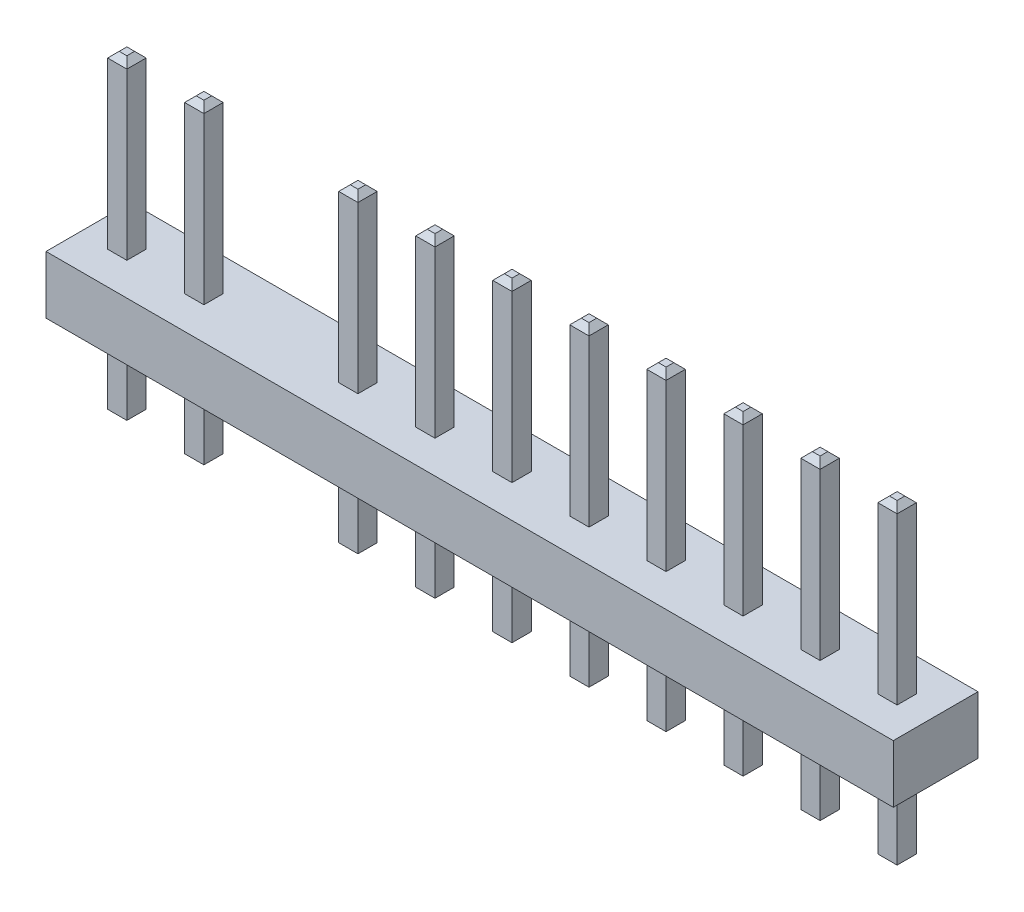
ISO-10303-21;
HEADER;
FILE_DESCRIPTION(('STEP AP214'),'2;1');
FILE_NAME('part.step','',(''),(''),'','','');
FILE_SCHEMA(('AUTOMOTIVE_DESIGN { 1 0 10303 214 1 1 1 1 }'));
ENDSEC;
DATA;
#1=APPLICATION_CONTEXT('core data for automotive mechanical design processes');
#2=APPLICATION_PROTOCOL_DEFINITION('international standard','automotive_design',2000,#1);
#3=PRODUCT_CONTEXT('',#1,'mechanical');
#4=PRODUCT('Part','Part','',(#3));
#5=PRODUCT_RELATED_PRODUCT_CATEGORY('part','',(#4));
#6=PRODUCT_DEFINITION_FORMATION('','',#4);
#7=PRODUCT_DEFINITION_CONTEXT('part definition',#1,'design');
#8=PRODUCT_DEFINITION('design','',#6,#7);
#9=PRODUCT_DEFINITION_SHAPE('','',#8);
#10=(LENGTH_UNIT() NAMED_UNIT(*) SI_UNIT(.MILLI.,.METRE.));
#11=(NAMED_UNIT(*) PLANE_ANGLE_UNIT() SI_UNIT($,.RADIAN.));
#12=(NAMED_UNIT(*) SI_UNIT($,.STERADIAN.) SOLID_ANGLE_UNIT());
#13=UNCERTAINTY_MEASURE_WITH_UNIT(LENGTH_MEASURE(1.E-05),#10,'distance_accuracy_value','');
#14=(GEOMETRIC_REPRESENTATION_CONTEXT(3) GLOBAL_UNCERTAINTY_ASSIGNED_CONTEXT((#13)) GLOBAL_UNIT_ASSIGNED_CONTEXT((#10,
#11,#12)) REPRESENTATION_CONTEXT('',''));
#15=CARTESIAN_POINT('',(0.,0.,0.));
#16=DIRECTION('',(0.,0.,1.));
#17=DIRECTION('',(1.,0.,0.));
#18=AXIS2_PLACEMENT_3D('',#15,#16,#17);
#19=CARTESIAN_POINT('',(0.,-1.5,0.));
#20=DIRECTION('',(-1.,0.,0.));
#21=DIRECTION('',(0.,0.,1.));
#22=AXIS2_PLACEMENT_3D('',#19,#20,#21);
#23=PLANE('',#22);
#24=DIRECTION('',(0.,0.,1.));
#25=VECTOR('',#24,1.);
#26=CARTESIAN_POINT('',(0.,0.,0.));
#27=LINE('',#26,#25);
#28=CARTESIAN_POINT('',(0.,0.,-2.2));
#29=VERTEX_POINT('',#28);
#30=CARTESIAN_POINT('',(0.,0.,0.));
#31=VERTEX_POINT('',#30);
#32=EDGE_CURVE('E930',#29,#31,#27,.T.);
#33=ORIENTED_EDGE('',*,*,#32,.F.);
#34=DIRECTION('',(0.,1.,0.));
#35=VECTOR('',#34,1.);
#36=CARTESIAN_POINT('',(0.,-1.5,-2.2));
#37=LINE('',#36,#35);
#38=CARTESIAN_POINT('',(0.,-1.5,-2.2));
#39=VERTEX_POINT('',#38);
#40=EDGE_CURVE('E955',#39,#29,#37,.T.);
#41=ORIENTED_EDGE('',*,*,#40,.F.);
#42=DIRECTION('',(0.,0.,1.));
#43=VECTOR('',#42,1.);
#44=CARTESIAN_POINT('',(0.,-1.5,0.));
#45=LINE('',#44,#43);
#46=CARTESIAN_POINT('',(0.,-1.5,0.));
#47=VERTEX_POINT('',#46);
#48=EDGE_CURVE('E931',#39,#47,#45,.T.);
#49=ORIENTED_EDGE('',*,*,#48,.T.);
#50=DIRECTION('',(0.,1.,0.));
#51=VECTOR('',#50,1.);
#52=CARTESIAN_POINT('',(0.,-1.5,0.));
#53=LINE('',#52,#51);
#54=EDGE_CURVE('E944',#47,#31,#53,.T.);
#55=ORIENTED_EDGE('',*,*,#54,.T.);
#56=EDGE_LOOP('',(#33,#41,#49,#55));
#57=FACE_BOUND('',#56,.T.);
#58=ADVANCED_FACE('F32',(#57),#23,.T.);
#59=CARTESIAN_POINT('',(0.,-1.5,-2.2));
#60=DIRECTION('',(0.,0.,-1.));
#61=DIRECTION('',(-1.,0.,0.));
#62=AXIS2_PLACEMENT_3D('',#59,#60,#61);
#63=PLANE('',#62);
#64=DIRECTION('',(-1.,0.,0.));
#65=VECTOR('',#64,1.);
#66=CARTESIAN_POINT('',(0.,0.,-2.2));
#67=LINE('',#66,#65);
#68=CARTESIAN_POINT('',(22.,0.,-2.2));
#69=VERTEX_POINT('',#68);
#70=EDGE_CURVE('E935',#69,#29,#67,.T.);
#71=ORIENTED_EDGE('',*,*,#70,.F.);
#72=DIRECTION('',(0.,1.,0.));
#73=VECTOR('',#72,1.);
#74=CARTESIAN_POINT('',(22.,-1.5,-2.2));
#75=LINE('',#74,#73);
#76=CARTESIAN_POINT('',(22.,-1.5,-2.2));
#77=VERTEX_POINT('',#76);
#78=EDGE_CURVE('E958',#77,#69,#75,.T.);
#79=ORIENTED_EDGE('',*,*,#78,.F.);
#80=DIRECTION('',(-1.,0.,0.));
#81=VECTOR('',#80,1.);
#82=CARTESIAN_POINT('',(0.,-1.5,-2.2));
#83=LINE('',#82,#81);
#84=EDGE_CURVE('E941',#77,#39,#83,.T.);
#85=ORIENTED_EDGE('',*,*,#84,.T.);
#86=ORIENTED_EDGE('',*,*,#40,.T.);
#87=EDGE_LOOP('',(#71,#79,#85,#86));
#88=FACE_BOUND('',#87,.T.);
#89=ADVANCED_FACE('F1907',(#88),#63,.T.);
#90=CARTESIAN_POINT('',(22.,-1.5,0.));
#91=DIRECTION('',(1.,0.,0.));
#92=DIRECTION('',(0.,0.,-1.));
#93=AXIS2_PLACEMENT_3D('',#90,#91,#92);
#94=PLANE('',#93);
#95=DIRECTION('',(0.,0.,-1.));
#96=VECTOR('',#95,1.);
#97=CARTESIAN_POINT('',(22.,0.,0.));
#98=LINE('',#97,#96);
#99=CARTESIAN_POINT('',(22.,0.,0.));
#100=VERTEX_POINT('',#99);
#101=EDGE_CURVE('E950',#100,#69,#98,.T.);
#102=ORIENTED_EDGE('',*,*,#101,.F.);
#103=DIRECTION('',(0.,1.,0.));
#104=VECTOR('',#103,1.);
#105=CARTESIAN_POINT('',(22.,-1.5,0.));
#106=LINE('',#105,#104);
#107=CARTESIAN_POINT('',(22.,-1.5,0.));
#108=VERTEX_POINT('',#107);
#109=EDGE_CURVE('E960',#108,#100,#106,.T.);
#110=ORIENTED_EDGE('',*,*,#109,.F.);
#111=DIRECTION('',(0.,0.,-1.));
#112=VECTOR('',#111,1.);
#113=CARTESIAN_POINT('',(22.,-1.5,0.));
#114=LINE('',#113,#112);
#115=EDGE_CURVE('E938',#108,#77,#114,.T.);
#116=ORIENTED_EDGE('',*,*,#115,.T.);
#117=ORIENTED_EDGE('',*,*,#78,.T.);
#118=EDGE_LOOP('',(#102,#110,#116,#117));
#119=FACE_BOUND('',#118,.T.);
#120=ADVANCED_FACE('F1913',(#119),#94,.T.);
#121=CARTESIAN_POINT('',(0.,-1.5,0.));
#122=DIRECTION('',(0.,0.,1.));
#123=DIRECTION('',(1.,0.,0.));
#124=AXIS2_PLACEMENT_3D('',#121,#122,#123);
#125=PLANE('',#124);
#126=DIRECTION('',(1.,0.,0.));
#127=VECTOR('',#126,1.);
#128=CARTESIAN_POINT('',(0.,0.,0.));
#129=LINE('',#128,#127);
#130=EDGE_CURVE('E947',#31,#100,#129,.T.);
#131=ORIENTED_EDGE('',*,*,#130,.F.);
#132=ORIENTED_EDGE('',*,*,#54,.F.);
#133=DIRECTION('',(1.,0.,0.));
#134=VECTOR('',#133,1.);
#135=CARTESIAN_POINT('',(0.,-1.5,0.));
#136=LINE('',#135,#134);
#137=EDGE_CURVE('E934',#47,#108,#136,.T.);
#138=ORIENTED_EDGE('',*,*,#137,.T.);
#139=ORIENTED_EDGE('',*,*,#109,.T.);
#140=EDGE_LOOP('',(#131,#132,#138,#139));
#141=FACE_BOUND('',#140,.T.);
#142=ADVANCED_FACE('F1901',(#141),#125,.T.);
#143=CARTESIAN_POINT('',(0.,-1.5,0.));
#144=DIRECTION('',(0.,-1.,0.));
#145=DIRECTION('',(0.,0.,-1.));
#146=AXIS2_PLACEMENT_3D('',#143,#144,#145);
#147=PLANE('',#146);
#148=DIRECTION('',(0.,0.,-1.));
#149=VECTOR('',#148,1.);
#150=CARTESIAN_POINT('',(2.75,-1.5,0.));
#151=LINE('',#150,#149);
#152=CARTESIAN_POINT('',(2.75,-1.5,-0.85));
#153=VERTEX_POINT('',#152);
#154=CARTESIAN_POINT('',(2.75,-1.5,-1.35));
#155=VERTEX_POINT('',#154);
#156=EDGE_CURVE('E902',#153,#155,#151,.T.);
#157=ORIENTED_EDGE('',*,*,#156,.F.);
#158=DIRECTION('',(-1.,0.,0.));
#159=VECTOR('',#158,1.);
#160=CARTESIAN_POINT('',(2.,-1.5,-0.85));
#161=LINE('',#160,#159);
#162=CARTESIAN_POINT('',(3.25,-1.5,-0.85));
#163=VERTEX_POINT('',#162);
#164=EDGE_CURVE('E848',#163,#153,#161,.T.);
#165=ORIENTED_EDGE('',*,*,#164,.F.);
#166=DIRECTION('',(0.,0.,1.));
#167=VECTOR('',#166,1.);
#168=CARTESIAN_POINT('',(3.25,-1.5,0.));
#169=LINE('',#168,#167);
#170=CARTESIAN_POINT('',(3.25,-1.5,-1.35));
#171=VERTEX_POINT('',#170);
#172=EDGE_CURVE('E893',#171,#163,#169,.T.);
#173=ORIENTED_EDGE('',*,*,#172,.F.);
#174=DIRECTION('',(1.,0.,0.));
#175=VECTOR('',#174,1.);
#176=CARTESIAN_POINT('',(2.,-1.5,-1.35));
#177=LINE('',#176,#175);
#178=EDGE_CURVE('E899',#155,#171,#177,.T.);
#179=ORIENTED_EDGE('',*,*,#178,.F.);
#180=EDGE_LOOP('',(#157,#165,#173,#179));
#181=FACE_BOUND('',#180,.T.);
#182=DIRECTION('',(0.,0.,-1.));
#183=VECTOR('',#182,1.);
#184=CARTESIAN_POINT('',(0.75,-1.5,0.));
#185=LINE('',#184,#183);
#186=CARTESIAN_POINT('',(0.75,-1.5,-0.85));
#187=VERTEX_POINT('',#186);
#188=CARTESIAN_POINT('',(0.75,-1.5,-1.35));
#189=VERTEX_POINT('',#188);
#190=EDGE_CURVE('E927',#187,#189,#185,.T.);
#191=ORIENTED_EDGE('',*,*,#190,.F.);
#192=DIRECTION('',(-1.,0.,0.));
#193=VECTOR('',#192,1.);
#194=CARTESIAN_POINT('',(0.,-1.5,-0.85));
#195=LINE('',#194,#193);
#196=CARTESIAN_POINT('',(1.25,-1.5,-0.85));
#197=VERTEX_POINT('',#196);
#198=EDGE_CURVE('E908',#197,#187,#195,.T.);
#199=ORIENTED_EDGE('',*,*,#198,.F.);
#200=DIRECTION('',(0.,0.,1.));
#201=VECTOR('',#200,1.);
#202=CARTESIAN_POINT('',(1.25,-1.5,0.));
#203=LINE('',#202,#201);
#204=CARTESIAN_POINT('',(1.25,-1.5,-1.35));
#205=VERTEX_POINT('',#204);
#206=EDGE_CURVE('E921',#205,#197,#203,.T.);
#207=ORIENTED_EDGE('',*,*,#206,.F.);
#208=DIRECTION('',(1.,0.,0.));
#209=VECTOR('',#208,1.);
#210=CARTESIAN_POINT('',(0.,-1.5,-1.35));
#211=LINE('',#210,#209);
#212=EDGE_CURVE('E924',#189,#205,#211,.T.);
#213=ORIENTED_EDGE('',*,*,#212,.F.);
#214=EDGE_LOOP('',(#191,#199,#207,#213));
#215=FACE_BOUND('',#214,.T.);
#216=ORIENTED_EDGE('',*,*,#48,.F.);
#217=ORIENTED_EDGE('',*,*,#84,.F.);
#218=ORIENTED_EDGE('',*,*,#115,.F.);
#219=ORIENTED_EDGE('',*,*,#137,.F.);
#220=EDGE_LOOP('',(#216,#217,#218,#219));
#221=FACE_BOUND('',#220,.T.);
#222=DIRECTION('',(0.,0.,-1.));
#223=VECTOR('',#222,1.);
#224=CARTESIAN_POINT('',(6.75,-1.5,0.));
#225=LINE('',#224,#223);
#226=CARTESIAN_POINT('',(6.75,-1.5,-0.85));
#227=VERTEX_POINT('',#226);
#228=CARTESIAN_POINT('',(6.75,-1.5,-1.35));
#229=VERTEX_POINT('',#228);
#230=EDGE_CURVE('E1010',#227,#229,#225,.T.);
#231=ORIENTED_EDGE('',*,*,#230,.F.);
#232=DIRECTION('',(-1.,0.,0.));
#233=VECTOR('',#232,1.);
#234=CARTESIAN_POINT('',(6.,-1.5,-0.85));
#235=LINE('',#234,#233);
#236=CARTESIAN_POINT('',(7.25,-1.5,-0.85));
#237=VERTEX_POINT('',#236);
#238=EDGE_CURVE('E1031',#237,#227,#235,.T.);
#239=ORIENTED_EDGE('',*,*,#238,.F.);
#240=DIRECTION('',(0.,0.,1.));
#241=VECTOR('',#240,1.);
#242=CARTESIAN_POINT('',(7.25,-1.5,0.));
#243=LINE('',#242,#241);
#244=CARTESIAN_POINT('',(7.25,-1.5,-1.35));
#245=VERTEX_POINT('',#244);
#246=EDGE_CURVE('E1034',#245,#237,#243,.T.);
#247=ORIENTED_EDGE('',*,*,#246,.F.);
#248=DIRECTION('',(1.,0.,0.));
#249=VECTOR('',#248,1.);
#250=CARTESIAN_POINT('',(6.,-1.5,-1.35));
#251=LINE('',#250,#249);
#252=EDGE_CURVE('E1037',#229,#245,#251,.T.);
#253=ORIENTED_EDGE('',*,*,#252,.F.);
#254=EDGE_LOOP('',(#231,#239,#247,#253));
#255=FACE_BOUND('',#254,.T.);
#256=DIRECTION('',(0.,0.,-1.));
#257=VECTOR('',#256,1.);
#258=CARTESIAN_POINT('',(8.75,-1.5,0.));
#259=LINE('',#258,#257);
#260=CARTESIAN_POINT('',(8.75,-1.5,-0.85));
#261=VERTEX_POINT('',#260);
#262=CARTESIAN_POINT('',(8.75,-1.5,-1.35));
#263=VERTEX_POINT('',#262);
#264=EDGE_CURVE('E1084',#261,#263,#259,.T.);
#265=ORIENTED_EDGE('',*,*,#264,.F.);
#266=DIRECTION('',(-1.,0.,0.));
#267=VECTOR('',#266,1.);
#268=CARTESIAN_POINT('',(8.,-1.5,-0.85));
#269=LINE('',#268,#267);
#270=CARTESIAN_POINT('',(9.25,-1.5,-0.85));
#271=VERTEX_POINT('',#270);
#272=EDGE_CURVE('E1086',#271,#261,#269,.T.);
#273=ORIENTED_EDGE('',*,*,#272,.F.);
#274=DIRECTION('',(0.,0.,1.));
#275=VECTOR('',#274,1.);
#276=CARTESIAN_POINT('',(9.25,-1.5,0.));
#277=LINE('',#276,#275);
#278=CARTESIAN_POINT('',(9.25,-1.5,-1.35));
#279=VERTEX_POINT('',#278);
#280=EDGE_CURVE('E1089',#279,#271,#277,.T.);
#281=ORIENTED_EDGE('',*,*,#280,.F.);
#282=DIRECTION('',(1.,0.,0.));
#283=VECTOR('',#282,1.);
#284=CARTESIAN_POINT('',(8.,-1.5,-1.35));
#285=LINE('',#284,#283);
#286=EDGE_CURVE('E1092',#263,#279,#285,.T.);
#287=ORIENTED_EDGE('',*,*,#286,.F.);
#288=EDGE_LOOP('',(#265,#273,#281,#287));
#289=FACE_BOUND('',#288,.T.);
#290=DIRECTION('',(0.,0.,-1.));
#291=VECTOR('',#290,1.);
#292=CARTESIAN_POINT('',(10.75,-1.5,0.));
#293=LINE('',#292,#291);
#294=CARTESIAN_POINT('',(10.75,-1.5,-0.85));
#295=VERTEX_POINT('',#294);
#296=CARTESIAN_POINT('',(10.75,-1.5,-1.35));
#297=VERTEX_POINT('',#296);
#298=EDGE_CURVE('E1139',#295,#297,#293,.T.);
#299=ORIENTED_EDGE('',*,*,#298,.F.);
#300=DIRECTION('',(-1.,0.,0.));
#301=VECTOR('',#300,1.);
#302=CARTESIAN_POINT('',(10.,-1.5,-0.85));
#303=LINE('',#302,#301);
#304=CARTESIAN_POINT('',(11.25,-1.5,-0.85));
#305=VERTEX_POINT('',#304);
#306=EDGE_CURVE('E1141',#305,#295,#303,.T.);
#307=ORIENTED_EDGE('',*,*,#306,.F.);
#308=DIRECTION('',(0.,0.,1.));
#309=VECTOR('',#308,1.);
#310=CARTESIAN_POINT('',(11.25,-1.5,0.));
#311=LINE('',#310,#309);
#312=CARTESIAN_POINT('',(11.25,-1.5,-1.35));
#313=VERTEX_POINT('',#312);
#314=EDGE_CURVE('E1144',#313,#305,#311,.T.);
#315=ORIENTED_EDGE('',*,*,#314,.F.);
#316=DIRECTION('',(1.,0.,0.));
#317=VECTOR('',#316,1.);
#318=CARTESIAN_POINT('',(10.,-1.5,-1.35));
#319=LINE('',#318,#317);
#320=EDGE_CURVE('E1147',#297,#313,#319,.T.);
#321=ORIENTED_EDGE('',*,*,#320,.F.);
#322=EDGE_LOOP('',(#299,#307,#315,#321));
#323=FACE_BOUND('',#322,.T.);
#324=DIRECTION('',(0.,0.,-1.));
#325=VECTOR('',#324,1.);
#326=CARTESIAN_POINT('',(12.75,-1.5,0.));
#327=LINE('',#326,#325);
#328=CARTESIAN_POINT('',(12.75,-1.5,-0.85));
#329=VERTEX_POINT('',#328);
#330=CARTESIAN_POINT('',(12.75,-1.5,-1.35));
#331=VERTEX_POINT('',#330);
#332=EDGE_CURVE('E1194',#329,#331,#327,.T.);
#333=ORIENTED_EDGE('',*,*,#332,.F.);
#334=DIRECTION('',(-1.,0.,0.));
#335=VECTOR('',#334,1.);
#336=CARTESIAN_POINT('',(12.,-1.5,-0.85));
#337=LINE('',#336,#335);
#338=CARTESIAN_POINT('',(13.25,-1.5,-0.85));
#339=VERTEX_POINT('',#338);
#340=EDGE_CURVE('E1196',#339,#329,#337,.T.);
#341=ORIENTED_EDGE('',*,*,#340,.F.);
#342=DIRECTION('',(0.,0.,1.));
#343=VECTOR('',#342,1.);
#344=CARTESIAN_POINT('',(13.25,-1.5,0.));
#345=LINE('',#344,#343);
#346=CARTESIAN_POINT('',(13.25,-1.5,-1.35));
#347=VERTEX_POINT('',#346);
#348=EDGE_CURVE('E1199',#347,#339,#345,.T.);
#349=ORIENTED_EDGE('',*,*,#348,.F.);
#350=DIRECTION('',(1.,0.,0.));
#351=VECTOR('',#350,1.);
#352=CARTESIAN_POINT('',(12.,-1.5,-1.35));
#353=LINE('',#352,#351);
#354=EDGE_CURVE('E1202',#331,#347,#353,.T.);
#355=ORIENTED_EDGE('',*,*,#354,.F.);
#356=EDGE_LOOP('',(#333,#341,#349,#355));
#357=FACE_BOUND('',#356,.T.);
#358=DIRECTION('',(0.,0.,-1.));
#359=VECTOR('',#358,1.);
#360=CARTESIAN_POINT('',(14.75,-1.5,0.));
#361=LINE('',#360,#359);
#362=CARTESIAN_POINT('',(14.75,-1.5,-0.85));
#363=VERTEX_POINT('',#362);
#364=CARTESIAN_POINT('',(14.75,-1.5,-1.35));
#365=VERTEX_POINT('',#364);
#366=EDGE_CURVE('E1249',#363,#365,#361,.T.);
#367=ORIENTED_EDGE('',*,*,#366,.F.);
#368=DIRECTION('',(-1.,0.,0.));
#369=VECTOR('',#368,1.);
#370=CARTESIAN_POINT('',(14.,-1.5,-0.85));
#371=LINE('',#370,#369);
#372=CARTESIAN_POINT('',(15.25,-1.5,-0.85));
#373=VERTEX_POINT('',#372);
#374=EDGE_CURVE('E1251',#373,#363,#371,.T.);
#375=ORIENTED_EDGE('',*,*,#374,.F.);
#376=DIRECTION('',(0.,0.,1.));
#377=VECTOR('',#376,1.);
#378=CARTESIAN_POINT('',(15.25,-1.5,0.));
#379=LINE('',#378,#377);
#380=CARTESIAN_POINT('',(15.25,-1.5,-1.35));
#381=VERTEX_POINT('',#380);
#382=EDGE_CURVE('E1254',#381,#373,#379,.T.);
#383=ORIENTED_EDGE('',*,*,#382,.F.);
#384=DIRECTION('',(1.,0.,0.));
#385=VECTOR('',#384,1.);
#386=CARTESIAN_POINT('',(14.,-1.5,-1.35));
#387=LINE('',#386,#385);
#388=EDGE_CURVE('E1257',#365,#381,#387,.T.);
#389=ORIENTED_EDGE('',*,*,#388,.F.);
#390=EDGE_LOOP('',(#367,#375,#383,#389));
#391=FACE_BOUND('',#390,.T.);
#392=DIRECTION('',(0.,0.,-1.));
#393=VECTOR('',#392,1.);
#394=CARTESIAN_POINT('',(16.75,-1.5,0.));
#395=LINE('',#394,#393);
#396=CARTESIAN_POINT('',(16.75,-1.5,-0.85));
#397=VERTEX_POINT('',#396);
#398=CARTESIAN_POINT('',(16.75,-1.5,-1.35));
#399=VERTEX_POINT('',#398);
#400=EDGE_CURVE('E1304',#397,#399,#395,.T.);
#401=ORIENTED_EDGE('',*,*,#400,.F.);
#402=DIRECTION('',(-1.,0.,0.));
#403=VECTOR('',#402,1.);
#404=CARTESIAN_POINT('',(16.,-1.5,-0.85));
#405=LINE('',#404,#403);
#406=CARTESIAN_POINT('',(17.25,-1.5,-0.85));
#407=VERTEX_POINT('',#406);
#408=EDGE_CURVE('E1306',#407,#397,#405,.T.);
#409=ORIENTED_EDGE('',*,*,#408,.F.);
#410=DIRECTION('',(0.,0.,1.));
#411=VECTOR('',#410,1.);
#412=CARTESIAN_POINT('',(17.25,-1.5,0.));
#413=LINE('',#412,#411);
#414=CARTESIAN_POINT('',(17.25,-1.5,-1.35));
#415=VERTEX_POINT('',#414);
#416=EDGE_CURVE('E1309',#415,#407,#413,.T.);
#417=ORIENTED_EDGE('',*,*,#416,.F.);
#418=DIRECTION('',(1.,0.,0.));
#419=VECTOR('',#418,1.);
#420=CARTESIAN_POINT('',(16.,-1.5,-1.35));
#421=LINE('',#420,#419);
#422=EDGE_CURVE('E1312',#399,#415,#421,.T.);
#423=ORIENTED_EDGE('',*,*,#422,.F.);
#424=EDGE_LOOP('',(#401,#409,#417,#423));
#425=FACE_BOUND('',#424,.T.);
#426=DIRECTION('',(0.,0.,-1.));
#427=VECTOR('',#426,1.);
#428=CARTESIAN_POINT('',(18.75,-1.5,0.));
#429=LINE('',#428,#427);
#430=CARTESIAN_POINT('',(18.75,-1.5,-0.85));
#431=VERTEX_POINT('',#430);
#432=CARTESIAN_POINT('',(18.75,-1.5,-1.35));
#433=VERTEX_POINT('',#432);
#434=EDGE_CURVE('E1359',#431,#433,#429,.T.);
#435=ORIENTED_EDGE('',*,*,#434,.F.);
#436=DIRECTION('',(-1.,0.,0.));
#437=VECTOR('',#436,1.);
#438=CARTESIAN_POINT('',(18.,-1.5,-0.85));
#439=LINE('',#438,#437);
#440=CARTESIAN_POINT('',(19.25,-1.5,-0.85));
#441=VERTEX_POINT('',#440);
#442=EDGE_CURVE('E1361',#441,#431,#439,.T.);
#443=ORIENTED_EDGE('',*,*,#442,.F.);
#444=DIRECTION('',(0.,0.,1.));
#445=VECTOR('',#444,1.);
#446=CARTESIAN_POINT('',(19.25,-1.5,0.));
#447=LINE('',#446,#445);
#448=CARTESIAN_POINT('',(19.25,-1.5,-1.35));
#449=VERTEX_POINT('',#448);
#450=EDGE_CURVE('E1364',#449,#441,#447,.T.);
#451=ORIENTED_EDGE('',*,*,#450,.F.);
#452=DIRECTION('',(1.,0.,0.));
#453=VECTOR('',#452,1.);
#454=CARTESIAN_POINT('',(18.,-1.5,-1.35));
#455=LINE('',#454,#453);
#456=EDGE_CURVE('E1367',#433,#449,#455,.T.);
#457=ORIENTED_EDGE('',*,*,#456,.F.);
#458=EDGE_LOOP('',(#435,#443,#451,#457));
#459=FACE_BOUND('',#458,.T.);
#460=DIRECTION('',(0.,0.,-1.));
#461=VECTOR('',#460,1.);
#462=CARTESIAN_POINT('',(20.75,-1.5,0.));
#463=LINE('',#462,#461);
#464=CARTESIAN_POINT('',(20.75,-1.5,-0.85));
#465=VERTEX_POINT('',#464);
#466=CARTESIAN_POINT('',(20.75,-1.5,-1.35));
#467=VERTEX_POINT('',#466);
#468=EDGE_CURVE('E1414',#465,#467,#463,.T.);
#469=ORIENTED_EDGE('',*,*,#468,.F.);
#470=DIRECTION('',(-1.,0.,0.));
#471=VECTOR('',#470,1.);
#472=CARTESIAN_POINT('',(20.,-1.5,-0.85));
#473=LINE('',#472,#471);
#474=CARTESIAN_POINT('',(21.25,-1.5,-0.85));
#475=VERTEX_POINT('',#474);
#476=EDGE_CURVE('E1416',#475,#465,#473,.T.);
#477=ORIENTED_EDGE('',*,*,#476,.F.);
#478=DIRECTION('',(0.,0.,1.));
#479=VECTOR('',#478,1.);
#480=CARTESIAN_POINT('',(21.25,-1.5,0.));
#481=LINE('',#480,#479);
#482=CARTESIAN_POINT('',(21.25,-1.5,-1.35));
#483=VERTEX_POINT('',#482);
#484=EDGE_CURVE('E1419',#483,#475,#481,.T.);
#485=ORIENTED_EDGE('',*,*,#484,.F.);
#486=DIRECTION('',(1.,0.,0.));
#487=VECTOR('',#486,1.);
#488=CARTESIAN_POINT('',(20.,-1.5,-1.35));
#489=LINE('',#488,#487);
#490=EDGE_CURVE('E1422',#467,#483,#489,.T.);
#491=ORIENTED_EDGE('',*,*,#490,.F.);
#492=EDGE_LOOP('',(#469,#477,#485,#491));
#493=FACE_BOUND('',#492,.T.);
#494=ADVANCED_FACE('F1891',(#181,#215,#221,#255,#289,#323,#357,#391,#425,#459,#493),#147,.T.);
#495=CARTESIAN_POINT('',(0.,0.,0.));
#496=DIRECTION('',(0.,-1.,0.));
#497=DIRECTION('',(0.,0.,-1.));
#498=AXIS2_PLACEMENT_3D('',#495,#496,#497);
#499=PLANE('',#498);
#500=DIRECTION('',(1.,0.,0.));
#501=VECTOR('',#500,1.);
#502=CARTESIAN_POINT('',(2.,0.,-1.35));
#503=LINE('',#502,#501);
#504=CARTESIAN_POINT('',(2.75,0.,-1.35));
#505=VERTEX_POINT('',#504);
#506=CARTESIAN_POINT('',(3.25,0.,-1.35));
#507=VERTEX_POINT('',#506);
#508=EDGE_CURVE('E806',#505,#507,#503,.T.);
#509=ORIENTED_EDGE('',*,*,#508,.T.);
#510=DIRECTION('',(0.,0.,1.));
#511=VECTOR('',#510,1.);
#512=CARTESIAN_POINT('',(3.25,0.,0.));
#513=LINE('',#512,#511);
#514=CARTESIAN_POINT('',(3.25,0.,-0.85));
#515=VERTEX_POINT('',#514);
#516=EDGE_CURVE('E831',#507,#515,#513,.T.);
#517=ORIENTED_EDGE('',*,*,#516,.T.);
#518=DIRECTION('',(-1.,0.,0.));
#519=VECTOR('',#518,1.);
#520=CARTESIAN_POINT('',(2.,0.,-0.85));
#521=LINE('',#520,#519);
#522=CARTESIAN_POINT('',(2.75,0.,-0.85));
#523=VERTEX_POINT('',#522);
#524=EDGE_CURVE('E844',#515,#523,#521,.T.);
#525=ORIENTED_EDGE('',*,*,#524,.T.);
#526=DIRECTION('',(0.,0.,-1.));
#527=VECTOR('',#526,1.);
#528=CARTESIAN_POINT('',(2.75,0.,0.));
#529=LINE('',#528,#527);
#530=EDGE_CURVE('E835',#523,#505,#529,.T.);
#531=ORIENTED_EDGE('',*,*,#530,.T.);
#532=EDGE_LOOP('',(#509,#517,#525,#531));
#533=FACE_BOUND('',#532,.T.);
#534=DIRECTION('',(-1.,0.,0.));
#535=VECTOR('',#534,1.);
#536=CARTESIAN_POINT('',(0.,0.,-0.85));
#537=LINE('',#536,#535);
#538=CARTESIAN_POINT('',(1.25,0.,-0.85));
#539=VERTEX_POINT('',#538);
#540=CARTESIAN_POINT('',(0.75,0.,-0.85));
#541=VERTEX_POINT('',#540);
#542=EDGE_CURVE('E957',#539,#541,#537,.T.);
#543=ORIENTED_EDGE('',*,*,#542,.T.);
#544=DIRECTION('',(0.,0.,-1.));
#545=VECTOR('',#544,1.);
#546=CARTESIAN_POINT('',(0.75,0.,0.));
#547=LINE('',#546,#545);
#548=CARTESIAN_POINT('',(0.75,0.,-1.35));
#549=VERTEX_POINT('',#548);
#550=EDGE_CURVE('E971',#541,#549,#547,.T.);
#551=ORIENTED_EDGE('',*,*,#550,.T.);
#552=DIRECTION('',(1.,0.,0.));
#553=VECTOR('',#552,1.);
#554=CARTESIAN_POINT('',(0.,0.,-1.35));
#555=LINE('',#554,#553);
#556=CARTESIAN_POINT('',(1.25,0.,-1.35));
#557=VERTEX_POINT('',#556);
#558=EDGE_CURVE('E968',#549,#557,#555,.T.);
#559=ORIENTED_EDGE('',*,*,#558,.T.);
#560=DIRECTION('',(0.,0.,1.));
#561=VECTOR('',#560,1.);
#562=CARTESIAN_POINT('',(1.25,0.,0.));
#563=LINE('',#562,#561);
#564=EDGE_CURVE('E965',#557,#539,#563,.T.);
#565=ORIENTED_EDGE('',*,*,#564,.T.);
#566=EDGE_LOOP('',(#543,#551,#559,#565));
#567=FACE_BOUND('',#566,.T.);
#568=ORIENTED_EDGE('',*,*,#32,.T.);
#569=ORIENTED_EDGE('',*,*,#130,.T.);
#570=ORIENTED_EDGE('',*,*,#101,.T.);
#571=ORIENTED_EDGE('',*,*,#70,.T.);
#572=EDGE_LOOP('',(#568,#569,#570,#571));
#573=FACE_BOUND('',#572,.T.);
#574=DIRECTION('',(0.,0.,1.));
#575=VECTOR('',#574,1.);
#576=CARTESIAN_POINT('',(7.25,0.,0.));
#577=LINE('',#576,#575);
#578=CARTESIAN_POINT('',(7.25,0.,-1.35));
#579=VERTEX_POINT('',#578);
#580=CARTESIAN_POINT('',(7.25,0.,-0.85));
#581=VERTEX_POINT('',#580);
#582=EDGE_CURVE('E1469',#579,#581,#577,.T.);
#583=ORIENTED_EDGE('',*,*,#582,.T.);
#584=DIRECTION('',(-1.,0.,0.));
#585=VECTOR('',#584,1.);
#586=CARTESIAN_POINT('',(6.,0.,-0.85));
#587=LINE('',#586,#585);
#588=CARTESIAN_POINT('',(6.75,0.,-0.85));
#589=VERTEX_POINT('',#588);
#590=EDGE_CURVE('E1471',#581,#589,#587,.T.);
#591=ORIENTED_EDGE('',*,*,#590,.T.);
#592=DIRECTION('',(0.,0.,-1.));
#593=VECTOR('',#592,1.);
#594=CARTESIAN_POINT('',(6.75,0.,0.));
#595=LINE('',#594,#593);
#596=CARTESIAN_POINT('',(6.75,0.,-1.35));
#597=VERTEX_POINT('',#596);
#598=EDGE_CURVE('E1473',#589,#597,#595,.T.);
#599=ORIENTED_EDGE('',*,*,#598,.T.);
#600=DIRECTION('',(1.,0.,0.));
#601=VECTOR('',#600,1.);
#602=CARTESIAN_POINT('',(6.,0.,-1.35));
#603=LINE('',#602,#601);
#604=EDGE_CURVE('E1475',#597,#579,#603,.T.);
#605=ORIENTED_EDGE('',*,*,#604,.T.);
#606=EDGE_LOOP('',(#583,#591,#599,#605));
#607=FACE_BOUND('',#606,.T.);
#608=DIRECTION('',(0.,0.,1.));
#609=VECTOR('',#608,1.);
#610=CARTESIAN_POINT('',(9.25,0.,0.));
#611=LINE('',#610,#609);
#612=CARTESIAN_POINT('',(9.25,0.,-1.35));
#613=VERTEX_POINT('',#612);
#614=CARTESIAN_POINT('',(9.25,0.,-0.85));
#615=VERTEX_POINT('',#614);
#616=EDGE_CURVE('E1519',#613,#615,#611,.T.);
#617=ORIENTED_EDGE('',*,*,#616,.T.);
#618=DIRECTION('',(-1.,0.,0.));
#619=VECTOR('',#618,1.);
#620=CARTESIAN_POINT('',(8.,0.,-0.85));
#621=LINE('',#620,#619);
#622=CARTESIAN_POINT('',(8.75,0.,-0.85));
#623=VERTEX_POINT('',#622);
#624=EDGE_CURVE('E1521',#615,#623,#621,.T.);
#625=ORIENTED_EDGE('',*,*,#624,.T.);
#626=DIRECTION('',(0.,0.,-1.));
#627=VECTOR('',#626,1.);
#628=CARTESIAN_POINT('',(8.75,0.,0.));
#629=LINE('',#628,#627);
#630=CARTESIAN_POINT('',(8.75,0.,-1.35));
#631=VERTEX_POINT('',#630);
#632=EDGE_CURVE('E1523',#623,#631,#629,.T.);
#633=ORIENTED_EDGE('',*,*,#632,.T.);
#634=DIRECTION('',(1.,0.,0.));
#635=VECTOR('',#634,1.);
#636=CARTESIAN_POINT('',(8.,0.,-1.35));
#637=LINE('',#636,#635);
#638=EDGE_CURVE('E1525',#631,#613,#637,.T.);
#639=ORIENTED_EDGE('',*,*,#638,.T.);
#640=EDGE_LOOP('',(#617,#625,#633,#639));
#641=FACE_BOUND('',#640,.T.);
#642=DIRECTION('',(0.,0.,1.));
#643=VECTOR('',#642,1.);
#644=CARTESIAN_POINT('',(11.25,0.,0.));
#645=LINE('',#644,#643);
#646=CARTESIAN_POINT('',(11.25,0.,-1.35));
#647=VERTEX_POINT('',#646);
#648=CARTESIAN_POINT('',(11.25,0.,-0.85));
#649=VERTEX_POINT('',#648);
#650=EDGE_CURVE('E1569',#647,#649,#645,.T.);
#651=ORIENTED_EDGE('',*,*,#650,.T.);
#652=DIRECTION('',(-1.,0.,0.));
#653=VECTOR('',#652,1.);
#654=CARTESIAN_POINT('',(10.,0.,-0.85));
#655=LINE('',#654,#653);
#656=CARTESIAN_POINT('',(10.75,0.,-0.85));
#657=VERTEX_POINT('',#656);
#658=EDGE_CURVE('E1571',#649,#657,#655,.T.);
#659=ORIENTED_EDGE('',*,*,#658,.T.);
#660=DIRECTION('',(0.,0.,-1.));
#661=VECTOR('',#660,1.);
#662=CARTESIAN_POINT('',(10.75,0.,0.));
#663=LINE('',#662,#661);
#664=CARTESIAN_POINT('',(10.75,0.,-1.35));
#665=VERTEX_POINT('',#664);
#666=EDGE_CURVE('E1573',#657,#665,#663,.T.);
#667=ORIENTED_EDGE('',*,*,#666,.T.);
#668=DIRECTION('',(1.,0.,0.));
#669=VECTOR('',#668,1.);
#670=CARTESIAN_POINT('',(10.,0.,-1.35));
#671=LINE('',#670,#669);
#672=EDGE_CURVE('E1575',#665,#647,#671,.T.);
#673=ORIENTED_EDGE('',*,*,#672,.T.);
#674=EDGE_LOOP('',(#651,#659,#667,#673));
#675=FACE_BOUND('',#674,.T.);
#676=DIRECTION('',(0.,0.,1.));
#677=VECTOR('',#676,1.);
#678=CARTESIAN_POINT('',(13.25,0.,0.));
#679=LINE('',#678,#677);
#680=CARTESIAN_POINT('',(13.25,0.,-1.35));
#681=VERTEX_POINT('',#680);
#682=CARTESIAN_POINT('',(13.25,0.,-0.85));
#683=VERTEX_POINT('',#682);
#684=EDGE_CURVE('E1619',#681,#683,#679,.T.);
#685=ORIENTED_EDGE('',*,*,#684,.T.);
#686=DIRECTION('',(-1.,0.,0.));
#687=VECTOR('',#686,1.);
#688=CARTESIAN_POINT('',(12.,0.,-0.85));
#689=LINE('',#688,#687);
#690=CARTESIAN_POINT('',(12.75,0.,-0.85));
#691=VERTEX_POINT('',#690);
#692=EDGE_CURVE('E1621',#683,#691,#689,.T.);
#693=ORIENTED_EDGE('',*,*,#692,.T.);
#694=DIRECTION('',(0.,0.,-1.));
#695=VECTOR('',#694,1.);
#696=CARTESIAN_POINT('',(12.75,0.,0.));
#697=LINE('',#696,#695);
#698=CARTESIAN_POINT('',(12.75,0.,-1.35));
#699=VERTEX_POINT('',#698);
#700=EDGE_CURVE('E1623',#691,#699,#697,.T.);
#701=ORIENTED_EDGE('',*,*,#700,.T.);
#702=DIRECTION('',(1.,0.,0.));
#703=VECTOR('',#702,1.);
#704=CARTESIAN_POINT('',(12.,0.,-1.35));
#705=LINE('',#704,#703);
#706=EDGE_CURVE('E1625',#699,#681,#705,.T.);
#707=ORIENTED_EDGE('',*,*,#706,.T.);
#708=EDGE_LOOP('',(#685,#693,#701,#707));
#709=FACE_BOUND('',#708,.T.);
#710=DIRECTION('',(0.,0.,1.));
#711=VECTOR('',#710,1.);
#712=CARTESIAN_POINT('',(15.25,0.,0.));
#713=LINE('',#712,#711);
#714=CARTESIAN_POINT('',(15.25,0.,-1.35));
#715=VERTEX_POINT('',#714);
#716=CARTESIAN_POINT('',(15.25,0.,-0.85));
#717=VERTEX_POINT('',#716);
#718=EDGE_CURVE('E1669',#715,#717,#713,.T.);
#719=ORIENTED_EDGE('',*,*,#718,.T.);
#720=DIRECTION('',(-1.,0.,0.));
#721=VECTOR('',#720,1.);
#722=CARTESIAN_POINT('',(14.,0.,-0.85));
#723=LINE('',#722,#721);
#724=CARTESIAN_POINT('',(14.75,0.,-0.85));
#725=VERTEX_POINT('',#724);
#726=EDGE_CURVE('E1671',#717,#725,#723,.T.);
#727=ORIENTED_EDGE('',*,*,#726,.T.);
#728=DIRECTION('',(0.,0.,-1.));
#729=VECTOR('',#728,1.);
#730=CARTESIAN_POINT('',(14.75,0.,0.));
#731=LINE('',#730,#729);
#732=CARTESIAN_POINT('',(14.75,0.,-1.35));
#733=VERTEX_POINT('',#732);
#734=EDGE_CURVE('E1673',#725,#733,#731,.T.);
#735=ORIENTED_EDGE('',*,*,#734,.T.);
#736=DIRECTION('',(1.,0.,0.));
#737=VECTOR('',#736,1.);
#738=CARTESIAN_POINT('',(14.,0.,-1.35));
#739=LINE('',#738,#737);
#740=EDGE_CURVE('E1675',#733,#715,#739,.T.);
#741=ORIENTED_EDGE('',*,*,#740,.T.);
#742=EDGE_LOOP('',(#719,#727,#735,#741));
#743=FACE_BOUND('',#742,.T.);
#744=DIRECTION('',(0.,0.,1.));
#745=VECTOR('',#744,1.);
#746=CARTESIAN_POINT('',(17.25,0.,0.));
#747=LINE('',#746,#745);
#748=CARTESIAN_POINT('',(17.25,0.,-1.35));
#749=VERTEX_POINT('',#748);
#750=CARTESIAN_POINT('',(17.25,0.,-0.85));
#751=VERTEX_POINT('',#750);
#752=EDGE_CURVE('E1719',#749,#751,#747,.T.);
#753=ORIENTED_EDGE('',*,*,#752,.T.);
#754=DIRECTION('',(-1.,0.,0.));
#755=VECTOR('',#754,1.);
#756=CARTESIAN_POINT('',(16.,0.,-0.85));
#757=LINE('',#756,#755);
#758=CARTESIAN_POINT('',(16.75,0.,-0.85));
#759=VERTEX_POINT('',#758);
#760=EDGE_CURVE('E1721',#751,#759,#757,.T.);
#761=ORIENTED_EDGE('',*,*,#760,.T.);
#762=DIRECTION('',(0.,0.,-1.));
#763=VECTOR('',#762,1.);
#764=CARTESIAN_POINT('',(16.75,0.,0.));
#765=LINE('',#764,#763);
#766=CARTESIAN_POINT('',(16.75,0.,-1.35));
#767=VERTEX_POINT('',#766);
#768=EDGE_CURVE('E1723',#759,#767,#765,.T.);
#769=ORIENTED_EDGE('',*,*,#768,.T.);
#770=DIRECTION('',(1.,0.,0.));
#771=VECTOR('',#770,1.);
#772=CARTESIAN_POINT('',(16.,0.,-1.35));
#773=LINE('',#772,#771);
#774=EDGE_CURVE('E1725',#767,#749,#773,.T.);
#775=ORIENTED_EDGE('',*,*,#774,.T.);
#776=EDGE_LOOP('',(#753,#761,#769,#775));
#777=FACE_BOUND('',#776,.T.);
#778=DIRECTION('',(0.,0.,1.));
#779=VECTOR('',#778,1.);
#780=CARTESIAN_POINT('',(19.25,0.,0.));
#781=LINE('',#780,#779);
#782=CARTESIAN_POINT('',(19.25,0.,-1.35));
#783=VERTEX_POINT('',#782);
#784=CARTESIAN_POINT('',(19.25,0.,-0.85));
#785=VERTEX_POINT('',#784);
#786=EDGE_CURVE('E1769',#783,#785,#781,.T.);
#787=ORIENTED_EDGE('',*,*,#786,.T.);
#788=DIRECTION('',(-1.,0.,0.));
#789=VECTOR('',#788,1.);
#790=CARTESIAN_POINT('',(18.,0.,-0.85));
#791=LINE('',#790,#789);
#792=CARTESIAN_POINT('',(18.75,0.,-0.85));
#793=VERTEX_POINT('',#792);
#794=EDGE_CURVE('E1771',#785,#793,#791,.T.);
#795=ORIENTED_EDGE('',*,*,#794,.T.);
#796=DIRECTION('',(0.,0.,-1.));
#797=VECTOR('',#796,1.);
#798=CARTESIAN_POINT('',(18.75,0.,0.));
#799=LINE('',#798,#797);
#800=CARTESIAN_POINT('',(18.75,0.,-1.35));
#801=VERTEX_POINT('',#800);
#802=EDGE_CURVE('E1773',#793,#801,#799,.T.);
#803=ORIENTED_EDGE('',*,*,#802,.T.);
#804=DIRECTION('',(1.,0.,0.));
#805=VECTOR('',#804,1.);
#806=CARTESIAN_POINT('',(18.,0.,-1.35));
#807=LINE('',#806,#805);
#808=EDGE_CURVE('E1775',#801,#783,#807,.T.);
#809=ORIENTED_EDGE('',*,*,#808,.T.);
#810=EDGE_LOOP('',(#787,#795,#803,#809));
#811=FACE_BOUND('',#810,.T.);
#812=DIRECTION('',(0.,0.,1.));
#813=VECTOR('',#812,1.);
#814=CARTESIAN_POINT('',(21.25,0.,0.));
#815=LINE('',#814,#813);
#816=CARTESIAN_POINT('',(21.25,0.,-1.35));
#817=VERTEX_POINT('',#816);
#818=CARTESIAN_POINT('',(21.25,0.,-0.85));
#819=VERTEX_POINT('',#818);
#820=EDGE_CURVE('E1819',#817,#819,#815,.T.);
#821=ORIENTED_EDGE('',*,*,#820,.T.);
#822=DIRECTION('',(-1.,0.,0.));
#823=VECTOR('',#822,1.);
#824=CARTESIAN_POINT('',(20.,0.,-0.85));
#825=LINE('',#824,#823);
#826=CARTESIAN_POINT('',(20.75,0.,-0.85));
#827=VERTEX_POINT('',#826);
#828=EDGE_CURVE('E1821',#819,#827,#825,.T.);
#829=ORIENTED_EDGE('',*,*,#828,.T.);
#830=DIRECTION('',(0.,0.,-1.));
#831=VECTOR('',#830,1.);
#832=CARTESIAN_POINT('',(20.75,0.,0.));
#833=LINE('',#832,#831);
#834=CARTESIAN_POINT('',(20.75,0.,-1.35));
#835=VERTEX_POINT('',#834);
#836=EDGE_CURVE('E1823',#827,#835,#833,.T.);
#837=ORIENTED_EDGE('',*,*,#836,.T.);
#838=DIRECTION('',(1.,0.,0.));
#839=VECTOR('',#838,1.);
#840=CARTESIAN_POINT('',(20.,0.,-1.35));
#841=LINE('',#840,#839);
#842=EDGE_CURVE('E1825',#835,#817,#841,.T.);
#843=ORIENTED_EDGE('',*,*,#842,.T.);
#844=EDGE_LOOP('',(#821,#829,#837,#843));
#845=FACE_BOUND('',#844,.T.);
#846=ADVANCED_FACE('F1888',(#533,#567,#573,#607,#641,#675,#709,#743,#777,#811,#845),#499,.F.);
#847=CARTESIAN_POINT('',(0.,4.45,0.));
#848=DIRECTION('',(0.,1.,0.));
#849=DIRECTION('',(0.,0.,1.));
#850=AXIS2_PLACEMENT_3D('',#847,#848,#849);
#851=PLANE('',#850);
#852=DIRECTION('',(0.,0.,-1.));
#853=VECTOR('',#852,1.);
#854=CARTESIAN_POINT('',(1.1,4.45,0.));
#855=LINE('',#854,#853);
#856=CARTESIAN_POINT('',(1.1,4.45,-1.));
#857=VERTEX_POINT('',#856);
#858=CARTESIAN_POINT('',(1.1,4.45,-1.2));
#859=VERTEX_POINT('',#858);
#860=EDGE_CURVE('E978',#857,#859,#855,.T.);
#861=ORIENTED_EDGE('',*,*,#860,.T.);
#862=DIRECTION('',(-1.,0.,0.));
#863=VECTOR('',#862,1.);
#864=CARTESIAN_POINT('',(0.,4.45,-1.2));
#865=LINE('',#864,#863);
#866=CARTESIAN_POINT('',(0.900000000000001,4.45,-1.2));
#867=VERTEX_POINT('',#866);
#868=EDGE_CURVE('E980',#859,#867,#865,.T.);
#869=ORIENTED_EDGE('',*,*,#868,.T.);
#870=DIRECTION('',(0.,0.,1.));
#871=VECTOR('',#870,1.);
#872=CARTESIAN_POINT('',(0.900000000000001,4.45,0.));
#873=LINE('',#872,#871);
#874=CARTESIAN_POINT('',(0.900000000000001,4.45,-1.));
#875=VERTEX_POINT('',#874);
#876=EDGE_CURVE('E974',#867,#875,#873,.T.);
#877=ORIENTED_EDGE('',*,*,#876,.T.);
#878=DIRECTION('',(1.,0.,0.));
#879=VECTOR('',#878,1.);
#880=CARTESIAN_POINT('',(0.,4.45,-1.));
#881=LINE('',#880,#879);
#882=EDGE_CURVE('E976',#875,#857,#881,.T.);
#883=ORIENTED_EDGE('',*,*,#882,.T.);
#884=EDGE_LOOP('',(#861,#869,#877,#883));
#885=FACE_BOUND('',#884,.T.);
#886=ADVANCED_FACE('F1890',(#885),#851,.T.);
#887=CARTESIAN_POINT('',(0.75,-3.75,-0.85));
#888=DIRECTION('',(0.,0.,1.));
#889=DIRECTION('',(1.,0.,0.));
#890=AXIS2_PLACEMENT_3D('',#887,#888,#889);
#891=PLANE('',#890);
#892=DIRECTION('',(0.,1.,0.));
#893=VECTOR('',#892,1.);
#894=CARTESIAN_POINT('',(1.25,-3.75,-0.85));
#895=LINE('',#894,#893);
#896=CARTESIAN_POINT('',(1.25,4.3,-0.85));
#897=VERTEX_POINT('',#896);
#898=EDGE_CURVE('E915',#539,#897,#895,.T.);
#899=ORIENTED_EDGE('',*,*,#898,.T.);
#900=DIRECTION('',(-1.,0.,0.));
#901=VECTOR('',#900,1.);
#902=CARTESIAN_POINT('',(0.75,4.3,-0.85));
#903=LINE('',#902,#901);
#904=CARTESIAN_POINT('',(0.75,4.3,-0.85));
#905=VERTEX_POINT('',#904);
#906=EDGE_CURVE('E988',#897,#905,#903,.T.);
#907=ORIENTED_EDGE('',*,*,#906,.T.);
#908=DIRECTION('',(0.,1.,0.));
#909=VECTOR('',#908,1.);
#910=CARTESIAN_POINT('',(0.75,-3.75,-0.85));
#911=LINE('',#910,#909);
#912=EDGE_CURVE('E918',#541,#905,#911,.T.);
#913=ORIENTED_EDGE('',*,*,#912,.F.);
#914=ORIENTED_EDGE('',*,*,#542,.F.);
#915=EDGE_LOOP('',(#899,#907,#913,#914));
#916=FACE_BOUND('',#915,.T.);
#917=ADVANCED_FACE('F1898',(#916),#891,.T.);
#918=CARTESIAN_POINT('',(1.25,-3.75,-1.35));
#919=DIRECTION('',(1.,0.,0.));
#920=DIRECTION('',(0.,0.,-1.));
#921=AXIS2_PLACEMENT_3D('',#918,#919,#920);
#922=PLANE('',#921);
#923=DIRECTION('',(0.,1.,0.));
#924=VECTOR('',#923,1.);
#925=CARTESIAN_POINT('',(1.25,-3.75,-1.35));
#926=LINE('',#925,#924);
#927=CARTESIAN_POINT('',(1.25,4.3,-1.35));
#928=VERTEX_POINT('',#927);
#929=EDGE_CURVE('E912',#557,#928,#926,.T.);
#930=ORIENTED_EDGE('',*,*,#929,.T.);
#931=DIRECTION('',(0.,0.,1.));
#932=VECTOR('',#931,1.);
#933=CARTESIAN_POINT('',(1.25,4.3,-1.35));
#934=LINE('',#933,#932);
#935=EDGE_CURVE('E986',#928,#897,#934,.T.);
#936=ORIENTED_EDGE('',*,*,#935,.T.);
#937=ORIENTED_EDGE('',*,*,#898,.F.);
#938=ORIENTED_EDGE('',*,*,#564,.F.);
#939=EDGE_LOOP('',(#930,#936,#937,#938));
#940=FACE_BOUND('',#939,.T.);
#941=ADVANCED_FACE('F3245',(#940),#922,.T.);
#942=CARTESIAN_POINT('',(0.75,-3.75,-1.35));
#943=DIRECTION('',(0.,0.,-1.));
#944=DIRECTION('',(-1.,0.,0.));
#945=AXIS2_PLACEMENT_3D('',#942,#943,#944);
#946=PLANE('',#945);
#947=DIRECTION('',(0.,1.,0.));
#948=VECTOR('',#947,1.);
#949=CARTESIAN_POINT('',(0.75,-3.75,-1.35));
#950=LINE('',#949,#948);
#951=CARTESIAN_POINT('',(0.75,4.3,-1.35));
#952=VERTEX_POINT('',#951);
#953=EDGE_CURVE('E909',#549,#952,#950,.T.);
#954=ORIENTED_EDGE('',*,*,#953,.T.);
#955=DIRECTION('',(1.,0.,0.));
#956=VECTOR('',#955,1.);
#957=CARTESIAN_POINT('',(0.75,4.3,-1.35));
#958=LINE('',#957,#956);
#959=EDGE_CURVE('E983',#952,#928,#958,.T.);
#960=ORIENTED_EDGE('',*,*,#959,.T.);
#961=ORIENTED_EDGE('',*,*,#929,.F.);
#962=ORIENTED_EDGE('',*,*,#558,.F.);
#963=EDGE_LOOP('',(#954,#960,#961,#962));
#964=FACE_BOUND('',#963,.T.);
#965=ADVANCED_FACE('F3254',(#964),#946,.T.);
#966=CARTESIAN_POINT('',(0.75,-3.75,-1.35));
#967=DIRECTION('',(-1.,0.,0.));
#968=DIRECTION('',(0.,0.,1.));
#969=AXIS2_PLACEMENT_3D('',#966,#967,#968);
#970=PLANE('',#969);
#971=ORIENTED_EDGE('',*,*,#912,.T.);
#972=DIRECTION('',(0.,0.,-1.));
#973=VECTOR('',#972,1.);
#974=CARTESIAN_POINT('',(0.75,4.3,-1.35));
#975=LINE('',#974,#973);
#976=EDGE_CURVE('E990',#905,#952,#975,.T.);
#977=ORIENTED_EDGE('',*,*,#976,.T.);
#978=ORIENTED_EDGE('',*,*,#953,.F.);
#979=ORIENTED_EDGE('',*,*,#550,.F.);
#980=EDGE_LOOP('',(#971,#977,#978,#979));
#981=FACE_BOUND('',#980,.T.);
#982=ADVANCED_FACE('F3260',(#981),#970,.T.);
#983=CARTESIAN_POINT('',(0.75,-3.6,-1.35));
#984=VERTEX_POINT('',#983);
#985=EDGE_CURVE('E906',#984,#189,#950,.T.);
#986=ORIENTED_EDGE('',*,*,#985,.F.);
#987=DIRECTION('',(0.,0.,1.));
#988=VECTOR('',#987,1.);
#989=CARTESIAN_POINT('',(0.75,-3.6,-0.85));
#990=LINE('',#989,#988);
#991=CARTESIAN_POINT('',(0.75,-3.6,-0.85));
#992=VERTEX_POINT('',#991);
#993=EDGE_CURVE('E1008',#984,#992,#990,.T.);
#994=ORIENTED_EDGE('',*,*,#993,.T.);
#995=EDGE_CURVE('E916',#992,#187,#911,.T.);
#996=ORIENTED_EDGE('',*,*,#995,.T.);
#997=ORIENTED_EDGE('',*,*,#190,.T.);
#998=EDGE_LOOP('',(#986,#994,#996,#997));
#999=FACE_BOUND('',#998,.T.);
#1000=ADVANCED_FACE('F3251',(#999),#970,.T.);
#1001=CARTESIAN_POINT('',(1.25,-3.6,-1.35));
#1002=VERTEX_POINT('',#1001);
#1003=EDGE_CURVE('E910',#1002,#205,#926,.T.);
#1004=ORIENTED_EDGE('',*,*,#1003,.F.);
#1005=DIRECTION('',(-1.,0.,0.));
#1006=VECTOR('',#1005,1.);
#1007=CARTESIAN_POINT('',(0.75,-3.6,-1.35));
#1008=LINE('',#1007,#1006);
#1009=EDGE_CURVE('E1006',#1002,#984,#1008,.T.);
#1010=ORIENTED_EDGE('',*,*,#1009,.T.);
#1011=ORIENTED_EDGE('',*,*,#985,.T.);
#1012=ORIENTED_EDGE('',*,*,#212,.T.);
#1013=EDGE_LOOP('',(#1004,#1010,#1011,#1012));
#1014=FACE_BOUND('',#1013,.T.);
#1015=ADVANCED_FACE('F3242',(#1014),#946,.T.);
#1016=CARTESIAN_POINT('',(1.25,-3.6,-0.85));
#1017=VERTEX_POINT('',#1016);
#1018=EDGE_CURVE('E913',#1017,#197,#895,.T.);
#1019=ORIENTED_EDGE('',*,*,#1018,.F.);
#1020=DIRECTION('',(0.,0.,-1.));
#1021=VECTOR('',#1020,1.);
#1022=CARTESIAN_POINT('',(1.25,-3.6,-1.35));
#1023=LINE('',#1022,#1021);
#1024=EDGE_CURVE('E1004',#1017,#1002,#1023,.T.);
#1025=ORIENTED_EDGE('',*,*,#1024,.T.);
#1026=ORIENTED_EDGE('',*,*,#1003,.T.);
#1027=ORIENTED_EDGE('',*,*,#206,.T.);
#1028=EDGE_LOOP('',(#1019,#1025,#1026,#1027));
#1029=FACE_BOUND('',#1028,.T.);
#1030=ADVANCED_FACE('F3234',(#1029),#922,.T.);
#1031=ORIENTED_EDGE('',*,*,#995,.F.);
#1032=DIRECTION('',(1.,0.,0.));
#1033=VECTOR('',#1032,1.);
#1034=CARTESIAN_POINT('',(1.25,-3.6,-0.85));
#1035=LINE('',#1034,#1033);
#1036=EDGE_CURVE('E992',#992,#1017,#1035,.T.);
#1037=ORIENTED_EDGE('',*,*,#1036,.T.);
#1038=ORIENTED_EDGE('',*,*,#1018,.T.);
#1039=ORIENTED_EDGE('',*,*,#198,.T.);
#1040=EDGE_LOOP('',(#1031,#1037,#1038,#1039));
#1041=FACE_BOUND('',#1040,.T.);
#1042=ADVANCED_FACE('F3226',(#1041),#891,.T.);
#1043=CARTESIAN_POINT('',(0.,-3.75,0.));
#1044=DIRECTION('',(0.,1.,0.));
#1045=DIRECTION('',(0.,0.,1.));
#1046=AXIS2_PLACEMENT_3D('',#1043,#1044,#1045);
#1047=PLANE('',#1046);
#1048=DIRECTION('',(0.,0.,1.));
#1049=VECTOR('',#1048,1.);
#1050=CARTESIAN_POINT('',(1.1,-3.75,-0.85));
#1051=LINE('',#1050,#1049);
#1052=CARTESIAN_POINT('',(1.1,-3.75,-1.2));
#1053=VERTEX_POINT('',#1052);
#1054=CARTESIAN_POINT('',(1.1,-3.75,-1.));
#1055=VERTEX_POINT('',#1054);
#1056=EDGE_CURVE('E999',#1053,#1055,#1051,.T.);
#1057=ORIENTED_EDGE('',*,*,#1056,.T.);
#1058=DIRECTION('',(-1.,0.,0.));
#1059=VECTOR('',#1058,1.);
#1060=CARTESIAN_POINT('',(0.75,-3.75,-1.));
#1061=LINE('',#1060,#1059);
#1062=CARTESIAN_POINT('',(0.900000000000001,-3.75,-1.));
#1063=VERTEX_POINT('',#1062);
#1064=EDGE_CURVE('E1001',#1055,#1063,#1061,.T.);
#1065=ORIENTED_EDGE('',*,*,#1064,.T.);
#1066=DIRECTION('',(0.,0.,-1.));
#1067=VECTOR('',#1066,1.);
#1068=CARTESIAN_POINT('',(0.900000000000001,-3.75,-1.35));
#1069=LINE('',#1068,#1067);
#1070=CARTESIAN_POINT('',(0.900000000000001,-3.75,-1.2));
#1071=VERTEX_POINT('',#1070);
#1072=EDGE_CURVE('E995',#1063,#1071,#1069,.T.);
#1073=ORIENTED_EDGE('',*,*,#1072,.T.);
#1074=DIRECTION('',(1.,0.,0.));
#1075=VECTOR('',#1074,1.);
#1076=CARTESIAN_POINT('',(1.25,-3.75,-1.2));
#1077=LINE('',#1076,#1075);
#1078=EDGE_CURVE('E997',#1071,#1053,#1077,.T.);
#1079=ORIENTED_EDGE('',*,*,#1078,.T.);
#1080=EDGE_LOOP('',(#1057,#1065,#1073,#1079));
#1081=FACE_BOUND('',#1080,.T.);
#1082=ADVANCED_FACE('F1935',(#1081),#1047,.F.);
#1083=CARTESIAN_POINT('',(0.,4.45,-1.));
#1084=DIRECTION('',(0.,-0.707106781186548,-0.707106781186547));
#1085=DIRECTION('',(1.,0.,0.));
#1086=AXIS2_PLACEMENT_3D('',#1083,#1084,#1085);
#1087=PLANE('',#1086);
#1088=DIRECTION('',(0.577350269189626,0.577350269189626,-0.577350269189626));
#1089=VECTOR('',#1088,1.);
#1090=CARTESIAN_POINT('',(0.566666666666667,4.11666666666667,-0.666666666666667));
#1091=LINE('',#1090,#1089);
#1092=EDGE_CURVE('E1016',#905,#875,#1091,.T.);
#1093=ORIENTED_EDGE('',*,*,#1092,.F.);
#1094=ORIENTED_EDGE('',*,*,#906,.F.);
#1095=DIRECTION('',(-0.577350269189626,0.577350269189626,-0.577350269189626));
#1096=VECTOR('',#1095,1.);
#1097=CARTESIAN_POINT('',(0.733333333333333,4.81666666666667,-1.36666666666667));
#1098=LINE('',#1097,#1096);
#1099=EDGE_CURVE('E1019',#857,#897,#1098,.F.);
#1100=ORIENTED_EDGE('',*,*,#1099,.F.);
#1101=ORIENTED_EDGE('',*,*,#882,.F.);
#1102=EDGE_LOOP('',(#1093,#1094,#1100,#1101));
#1103=FACE_BOUND('',#1102,.T.);
#1104=ADVANCED_FACE('F1931',(#1103),#1087,.F.);
#1105=CARTESIAN_POINT('',(1.1,4.45,0.));
#1106=DIRECTION('',(-0.707106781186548,-0.707106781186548,0.));
#1107=DIRECTION('',(0.,0.,-1.));
#1108=AXIS2_PLACEMENT_3D('',#1105,#1106,#1107);
#1109=PLANE('',#1108);
#1110=ORIENTED_EDGE('',*,*,#1099,.T.);
#1111=ORIENTED_EDGE('',*,*,#935,.F.);
#1112=DIRECTION('',(-0.577350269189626,0.577350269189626,0.577350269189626));
#1113=VECTOR('',#1112,1.);
#1114=CARTESIAN_POINT('',(0.7,4.85,-0.8));
#1115=LINE('',#1114,#1113);
#1116=EDGE_CURVE('E1013',#859,#928,#1115,.F.);
#1117=ORIENTED_EDGE('',*,*,#1116,.F.);
#1118=ORIENTED_EDGE('',*,*,#860,.F.);
#1119=EDGE_LOOP('',(#1110,#1111,#1117,#1118));
#1120=FACE_BOUND('',#1119,.T.);
#1121=ADVANCED_FACE('F1927',(#1120),#1109,.F.);
#1122=CARTESIAN_POINT('',(0.900000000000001,4.45,0.));
#1123=DIRECTION('',(0.707106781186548,-0.707106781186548,0.));
#1124=DIRECTION('',(0.,0.,1.));
#1125=AXIS2_PLACEMENT_3D('',#1122,#1123,#1124);
#1126=PLANE('',#1125);
#1127=ORIENTED_EDGE('',*,*,#1092,.T.);
#1128=ORIENTED_EDGE('',*,*,#876,.F.);
#1129=DIRECTION('',(-0.577350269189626,-0.577350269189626,-0.577350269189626));
#1130=VECTOR('',#1129,1.);
#1131=CARTESIAN_POINT('',(1.3,4.85,-0.8));
#1132=LINE('',#1131,#1130);
#1133=EDGE_CURVE('E1011',#952,#867,#1132,.F.);
#1134=ORIENTED_EDGE('',*,*,#1133,.F.);
#1135=ORIENTED_EDGE('',*,*,#976,.F.);
#1136=EDGE_LOOP('',(#1127,#1128,#1134,#1135));
#1137=FACE_BOUND('',#1136,.T.);
#1138=ADVANCED_FACE('F1923',(#1137),#1126,.F.);
#1139=CARTESIAN_POINT('',(0.,4.45,-1.2));
#1140=DIRECTION('',(0.,-0.707106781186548,0.707106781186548));
#1141=DIRECTION('',(-1.,0.,0.));
#1142=AXIS2_PLACEMENT_3D('',#1139,#1140,#1141);
#1143=PLANE('',#1142);
#1144=ORIENTED_EDGE('',*,*,#1116,.T.);
#1145=ORIENTED_EDGE('',*,*,#959,.F.);
#1146=ORIENTED_EDGE('',*,*,#1133,.T.);
#1147=ORIENTED_EDGE('',*,*,#868,.F.);
#1148=EDGE_LOOP('',(#1144,#1145,#1146,#1147));
#1149=FACE_BOUND('',#1148,.T.);
#1150=ADVANCED_FACE('F1919',(#1149),#1143,.F.);
#1151=CARTESIAN_POINT('',(0.75,-3.6,-1.35));
#1152=DIRECTION('',(0.,-0.707106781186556,-0.707106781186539));
#1153=DIRECTION('',(1.,0.,0.));
#1154=AXIS2_PLACEMENT_3D('',#1151,#1152,#1153);
#1155=PLANE('',#1154);
#1156=DIRECTION('',(-0.57735026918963,-0.577350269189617,0.57735026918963));
#1157=VECTOR('',#1156,1.);
#1158=CARTESIAN_POINT('',(1.08333333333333,-3.76666666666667,-1.18333333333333));
#1159=LINE('',#1158,#1157);
#1160=EDGE_CURVE('E1025',#1053,#1002,#1159,.F.);
#1161=ORIENTED_EDGE('',*,*,#1160,.F.);
#1162=ORIENTED_EDGE('',*,*,#1078,.F.);
#1163=DIRECTION('',(0.57735026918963,-0.577350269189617,0.57735026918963));
#1164=VECTOR('',#1163,1.);
#1165=CARTESIAN_POINT('',(0.75,-3.6,-1.35));
#1166=LINE('',#1165,#1164);
#1167=EDGE_CURVE('E1014',#984,#1071,#1166,.T.);
#1168=ORIENTED_EDGE('',*,*,#1167,.F.);
#1169=ORIENTED_EDGE('',*,*,#1009,.F.);
#1170=EDGE_LOOP('',(#1161,#1162,#1168,#1169));
#1171=FACE_BOUND('',#1170,.T.);
#1172=ADVANCED_FACE('F1922',(#1171),#1155,.T.);
#1173=CARTESIAN_POINT('',(0.75,-3.6,-1.35));
#1174=DIRECTION('',(-0.707106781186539,-0.707106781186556,0.));
#1175=DIRECTION('',(0.,0.,-1.));
#1176=AXIS2_PLACEMENT_3D('',#1173,#1174,#1175);
#1177=PLANE('',#1176);
#1178=ORIENTED_EDGE('',*,*,#1167,.T.);
#1179=ORIENTED_EDGE('',*,*,#1072,.F.);
#1180=DIRECTION('',(-0.57735026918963,0.577350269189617,0.577350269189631));
#1181=VECTOR('',#1180,1.);
#1182=CARTESIAN_POINT('',(0.91666666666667,-3.76666666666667,-1.01666666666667));
#1183=LINE('',#1182,#1181);
#1184=EDGE_CURVE('E1023',#992,#1063,#1183,.F.);
#1185=ORIENTED_EDGE('',*,*,#1184,.F.);
#1186=ORIENTED_EDGE('',*,*,#993,.F.);
#1187=EDGE_LOOP('',(#1178,#1179,#1185,#1186));
#1188=FACE_BOUND('',#1187,.T.);
#1189=ADVANCED_FACE('F1945',(#1188),#1177,.T.);
#1190=CARTESIAN_POINT('',(1.25,-3.6,-1.35));
#1191=DIRECTION('',(0.707106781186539,-0.707106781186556,0.));
#1192=DIRECTION('',(0.,0.,1.));
#1193=AXIS2_PLACEMENT_3D('',#1190,#1191,#1192);
#1194=PLANE('',#1193);
#1195=ORIENTED_EDGE('',*,*,#1160,.T.);
#1196=ORIENTED_EDGE('',*,*,#1024,.F.);
#1197=DIRECTION('',(-0.57735026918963,-0.577350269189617,-0.577350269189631));
#1198=VECTOR('',#1197,1.);
#1199=CARTESIAN_POINT('',(1.08333333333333,-3.76666666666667,-1.01666666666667));
#1200=LINE('',#1199,#1198);
#1201=EDGE_CURVE('E905',#1055,#1017,#1200,.F.);
#1202=ORIENTED_EDGE('',*,*,#1201,.F.);
#1203=ORIENTED_EDGE('',*,*,#1056,.F.);
#1204=EDGE_LOOP('',(#1195,#1196,#1202,#1203));
#1205=FACE_BOUND('',#1204,.T.);
#1206=ADVANCED_FACE('F1941',(#1205),#1194,.T.);
#1207=CARTESIAN_POINT('',(0.75,-3.6,-0.85));
#1208=DIRECTION('',(0.,-0.707106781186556,0.707106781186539));
#1209=DIRECTION('',(-1.,0.,0.));
#1210=AXIS2_PLACEMENT_3D('',#1207,#1208,#1209);
#1211=PLANE('',#1210);
#1212=ORIENTED_EDGE('',*,*,#1184,.T.);
#1213=ORIENTED_EDGE('',*,*,#1064,.F.);
#1214=ORIENTED_EDGE('',*,*,#1201,.T.);
#1215=ORIENTED_EDGE('',*,*,#1036,.F.);
#1216=EDGE_LOOP('',(#1212,#1213,#1214,#1215));
#1217=FACE_BOUND('',#1216,.T.);
#1218=ADVANCED_FACE('F1937',(#1217),#1211,.T.);
#1219=CARTESIAN_POINT('',(2.75,-3.75,-1.35));
#1220=DIRECTION('',(-1.,0.,0.));
#1221=DIRECTION('',(0.,0.,1.));
#1222=AXIS2_PLACEMENT_3D('',#1219,#1220,#1221);
#1223=PLANE('',#1222);
#1224=DIRECTION('',(0.,1.,0.));
#1225=VECTOR('',#1224,1.);
#1226=CARTESIAN_POINT('',(2.75,-3.75,-1.35));
#1227=LINE('',#1226,#1225);
#1228=CARTESIAN_POINT('',(2.75,-3.6,-1.35));
#1229=VERTEX_POINT('',#1228);
#1230=EDGE_CURVE('E896',#1229,#155,#1227,.T.);
#1231=ORIENTED_EDGE('',*,*,#1230,.F.);
#1232=DIRECTION('',(0.,0.,1.));
#1233=VECTOR('',#1232,1.);
#1234=CARTESIAN_POINT('',(2.75,-3.6,-0.85));
#1235=LINE('',#1234,#1233);
#1236=CARTESIAN_POINT('',(2.75,-3.6,-0.85));
#1237=VERTEX_POINT('',#1236);
#1238=EDGE_CURVE('E881',#1229,#1237,#1235,.T.);
#1239=ORIENTED_EDGE('',*,*,#1238,.T.);
#1240=DIRECTION('',(0.,1.,0.));
#1241=VECTOR('',#1240,1.);
#1242=CARTESIAN_POINT('',(2.75,-3.75,-0.85));
#1243=LINE('',#1242,#1241);
#1244=EDGE_CURVE('E884',#1237,#153,#1243,.T.);
#1245=ORIENTED_EDGE('',*,*,#1244,.T.);
#1246=ORIENTED_EDGE('',*,*,#156,.T.);
#1247=EDGE_LOOP('',(#1231,#1239,#1245,#1246));
#1248=FACE_BOUND('',#1247,.T.);
#1249=ADVANCED_FACE('F1940',(#1248),#1223,.T.);
#1250=CARTESIAN_POINT('',(2.75,-3.75,-1.35));
#1251=DIRECTION('',(0.,0.,-1.));
#1252=DIRECTION('',(-1.,0.,0.));
#1253=AXIS2_PLACEMENT_3D('',#1250,#1251,#1252);
#1254=PLANE('',#1253);
#1255=DIRECTION('',(0.,1.,0.));
#1256=VECTOR('',#1255,1.);
#1257=CARTESIAN_POINT('',(3.25,-3.75,-1.35));
#1258=LINE('',#1257,#1256);
#1259=CARTESIAN_POINT('',(3.25,-3.6,-1.35));
#1260=VERTEX_POINT('',#1259);
#1261=EDGE_CURVE('E890',#1260,#171,#1258,.T.);
#1262=ORIENTED_EDGE('',*,*,#1261,.F.);
#1263=DIRECTION('',(-1.,0.,0.));
#1264=VECTOR('',#1263,1.);
#1265=CARTESIAN_POINT('',(2.75,-3.6,-1.35));
#1266=LINE('',#1265,#1264);
#1267=EDGE_CURVE('E875',#1260,#1229,#1266,.T.);
#1268=ORIENTED_EDGE('',*,*,#1267,.T.);
#1269=ORIENTED_EDGE('',*,*,#1230,.T.);
#1270=ORIENTED_EDGE('',*,*,#178,.T.);
#1271=EDGE_LOOP('',(#1262,#1268,#1269,#1270));
#1272=FACE_BOUND('',#1271,.T.);
#1273=ADVANCED_FACE('F3171',(#1272),#1254,.T.);
#1274=CARTESIAN_POINT('',(3.25,-3.75,-1.35));
#1275=DIRECTION('',(1.,0.,0.));
#1276=DIRECTION('',(0.,0.,-1.));
#1277=AXIS2_PLACEMENT_3D('',#1274,#1275,#1276);
#1278=PLANE('',#1277);
#1279=DIRECTION('',(0.,1.,0.));
#1280=VECTOR('',#1279,1.);
#1281=CARTESIAN_POINT('',(3.25,-3.75,-0.85));
#1282=LINE('',#1281,#1280);
#1283=CARTESIAN_POINT('',(3.25,-3.6,-0.85));
#1284=VERTEX_POINT('',#1283);
#1285=EDGE_CURVE('E887',#1284,#163,#1282,.T.);
#1286=ORIENTED_EDGE('',*,*,#1285,.F.);
#1287=DIRECTION('',(0.,0.,-1.));
#1288=VECTOR('',#1287,1.);
#1289=CARTESIAN_POINT('',(3.25,-3.6,-1.35));
#1290=LINE('',#1289,#1288);
#1291=EDGE_CURVE('E863',#1284,#1260,#1290,.T.);
#1292=ORIENTED_EDGE('',*,*,#1291,.T.);
#1293=ORIENTED_EDGE('',*,*,#1261,.T.);
#1294=ORIENTED_EDGE('',*,*,#172,.T.);
#1295=EDGE_LOOP('',(#1286,#1292,#1293,#1294));
#1296=FACE_BOUND('',#1295,.T.);
#1297=ADVANCED_FACE('F3163',(#1296),#1278,.T.);
#1298=CARTESIAN_POINT('',(2.75,-3.75,-0.85));
#1299=DIRECTION('',(0.,0.,1.));
#1300=DIRECTION('',(1.,0.,0.));
#1301=AXIS2_PLACEMENT_3D('',#1298,#1299,#1300);
#1302=PLANE('',#1301);
#1303=ORIENTED_EDGE('',*,*,#1244,.F.);
#1304=DIRECTION('',(1.,0.,0.));
#1305=VECTOR('',#1304,1.);
#1306=CARTESIAN_POINT('',(3.25,-3.6,-0.85));
#1307=LINE('',#1306,#1305);
#1308=EDGE_CURVE('E858',#1237,#1284,#1307,.T.);
#1309=ORIENTED_EDGE('',*,*,#1308,.T.);
#1310=ORIENTED_EDGE('',*,*,#1285,.T.);
#1311=ORIENTED_EDGE('',*,*,#164,.T.);
#1312=EDGE_LOOP('',(#1303,#1309,#1310,#1311));
#1313=FACE_BOUND('',#1312,.T.);
#1314=ADVANCED_FACE('F3155',(#1313),#1302,.T.);
#1315=CARTESIAN_POINT('',(2.,-3.75,0.));
#1316=DIRECTION('',(0.,1.,0.));
#1317=DIRECTION('',(0.,0.,1.));
#1318=AXIS2_PLACEMENT_3D('',#1315,#1316,#1317);
#1319=PLANE('',#1318);
#1320=DIRECTION('',(0.,0.,1.));
#1321=VECTOR('',#1320,1.);
#1322=CARTESIAN_POINT('',(3.1,-3.75,-0.85));
#1323=LINE('',#1322,#1321);
#1324=CARTESIAN_POINT('',(3.1,-3.75,-1.2));
#1325=VERTEX_POINT('',#1324);
#1326=CARTESIAN_POINT('',(3.1,-3.75,-1.));
#1327=VERTEX_POINT('',#1326);
#1328=EDGE_CURVE('E866',#1325,#1327,#1323,.T.);
#1329=ORIENTED_EDGE('',*,*,#1328,.T.);
#1330=DIRECTION('',(-1.,0.,0.));
#1331=VECTOR('',#1330,1.);
#1332=CARTESIAN_POINT('',(2.75,-3.75,-1.));
#1333=LINE('',#1332,#1331);
#1334=CARTESIAN_POINT('',(2.9,-3.75,-1.));
#1335=VERTEX_POINT('',#1334);
#1336=EDGE_CURVE('E853',#1327,#1335,#1333,.T.);
#1337=ORIENTED_EDGE('',*,*,#1336,.T.);
#1338=DIRECTION('',(0.,0.,-1.));
#1339=VECTOR('',#1338,1.);
#1340=CARTESIAN_POINT('',(2.9,-3.75,-1.35));
#1341=LINE('',#1340,#1339);
#1342=CARTESIAN_POINT('',(2.9,-3.75,-1.2));
#1343=VERTEX_POINT('',#1342);
#1344=EDGE_CURVE('E878',#1335,#1343,#1341,.T.);
#1345=ORIENTED_EDGE('',*,*,#1344,.T.);
#1346=DIRECTION('',(1.,0.,0.));
#1347=VECTOR('',#1346,1.);
#1348=CARTESIAN_POINT('',(3.25,-3.75,-1.2));
#1349=LINE('',#1348,#1347);
#1350=EDGE_CURVE('E869',#1343,#1325,#1349,.T.);
#1351=ORIENTED_EDGE('',*,*,#1350,.T.);
#1352=EDGE_LOOP('',(#1329,#1337,#1345,#1351));
#1353=FACE_BOUND('',#1352,.T.);
#1354=ADVANCED_FACE('F3147',(#1353),#1319,.F.);
#1355=CARTESIAN_POINT('',(2.75,-3.6,-1.35));
#1356=DIRECTION('',(-0.707106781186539,-0.707106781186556,0.));
#1357=DIRECTION('',(0.,0.,-1.));
#1358=AXIS2_PLACEMENT_3D('',#1355,#1356,#1357);
#1359=PLANE('',#1358);
#1360=DIRECTION('',(0.57735026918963,-0.577350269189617,0.57735026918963));
#1361=VECTOR('',#1360,1.);
#1362=CARTESIAN_POINT('',(2.75,-3.6,-1.35));
#1363=LINE('',#1362,#1361);
#1364=EDGE_CURVE('E872',#1229,#1343,#1363,.T.);
#1365=ORIENTED_EDGE('',*,*,#1364,.T.);
#1366=ORIENTED_EDGE('',*,*,#1344,.F.);
#1367=DIRECTION('',(-0.57735026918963,0.577350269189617,0.577350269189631));
#1368=VECTOR('',#1367,1.);
#1369=CARTESIAN_POINT('',(2.91666666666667,-3.76666666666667,-1.01666666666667));
#1370=LINE('',#1369,#1368);
#1371=EDGE_CURVE('E851',#1237,#1335,#1370,.F.);
#1372=ORIENTED_EDGE('',*,*,#1371,.F.);
#1373=ORIENTED_EDGE('',*,*,#1238,.F.);
#1374=EDGE_LOOP('',(#1365,#1366,#1372,#1373));
#1375=FACE_BOUND('',#1374,.T.);
#1376=ADVANCED_FACE('F3139',(#1375),#1359,.T.);
#1377=CARTESIAN_POINT('',(2.75,-3.6,-1.35));
#1378=DIRECTION('',(0.,-0.707106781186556,-0.707106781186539));
#1379=DIRECTION('',(1.,0.,0.));
#1380=AXIS2_PLACEMENT_3D('',#1377,#1378,#1379);
#1381=PLANE('',#1380);
#1382=DIRECTION('',(-0.57735026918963,-0.577350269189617,0.57735026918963));
#1383=VECTOR('',#1382,1.);
#1384=CARTESIAN_POINT('',(3.08333333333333,-3.76666666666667,-1.18333333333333));
#1385=LINE('',#1384,#1383);
#1386=EDGE_CURVE('E861',#1325,#1260,#1385,.F.);
#1387=ORIENTED_EDGE('',*,*,#1386,.F.);
#1388=ORIENTED_EDGE('',*,*,#1350,.F.);
#1389=ORIENTED_EDGE('',*,*,#1364,.F.);
#1390=ORIENTED_EDGE('',*,*,#1267,.F.);
#1391=EDGE_LOOP('',(#1387,#1388,#1389,#1390));
#1392=FACE_BOUND('',#1391,.T.);
#1393=ADVANCED_FACE('F3131',(#1392),#1381,.T.);
#1394=CARTESIAN_POINT('',(3.25,-3.6,-1.35));
#1395=DIRECTION('',(0.707106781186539,-0.707106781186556,0.));
#1396=DIRECTION('',(0.,0.,1.));
#1397=AXIS2_PLACEMENT_3D('',#1394,#1395,#1396);
#1398=PLANE('',#1397);
#1399=ORIENTED_EDGE('',*,*,#1386,.T.);
#1400=ORIENTED_EDGE('',*,*,#1291,.F.);
#1401=DIRECTION('',(-0.57735026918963,-0.577350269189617,-0.577350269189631));
#1402=VECTOR('',#1401,1.);
#1403=CARTESIAN_POINT('',(3.08333333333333,-3.76666666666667,-1.01666666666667));
#1404=LINE('',#1403,#1402);
#1405=EDGE_CURVE('E856',#1327,#1284,#1404,.F.);
#1406=ORIENTED_EDGE('',*,*,#1405,.F.);
#1407=ORIENTED_EDGE('',*,*,#1328,.F.);
#1408=EDGE_LOOP('',(#1399,#1400,#1406,#1407));
#1409=FACE_BOUND('',#1408,.T.);
#1410=ADVANCED_FACE('F3123',(#1409),#1398,.T.);
#1411=CARTESIAN_POINT('',(2.75,-3.6,-0.85));
#1412=DIRECTION('',(0.,-0.707106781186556,0.707106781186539));
#1413=DIRECTION('',(-1.,0.,0.));
#1414=AXIS2_PLACEMENT_3D('',#1411,#1412,#1413);
#1415=PLANE('',#1414);
#1416=ORIENTED_EDGE('',*,*,#1371,.T.);
#1417=ORIENTED_EDGE('',*,*,#1336,.F.);
#1418=ORIENTED_EDGE('',*,*,#1405,.T.);
#1419=ORIENTED_EDGE('',*,*,#1308,.F.);
#1420=EDGE_LOOP('',(#1416,#1417,#1418,#1419));
#1421=FACE_BOUND('',#1420,.T.);
#1422=ADVANCED_FACE('F1989',(#1421),#1415,.T.);
#1423=CARTESIAN_POINT('',(6.75,-3.6,-0.85));
#1424=DIRECTION('',(0.,-0.707106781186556,0.707106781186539));
#1425=DIRECTION('',(-1.,0.,0.));
#1426=AXIS2_PLACEMENT_3D('',#1423,#1424,#1425);
#1427=PLANE('',#1426);
#1428=DIRECTION('',(-0.57735026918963,0.577350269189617,0.577350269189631));
#1429=VECTOR('',#1428,1.);
#1430=CARTESIAN_POINT('',(6.91666666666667,-3.76666666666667,-1.01666666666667));
#1431=LINE('',#1430,#1429);
#1432=CARTESIAN_POINT('',(6.75,-3.6,-0.85));
#1433=VERTEX_POINT('',#1432);
#1434=CARTESIAN_POINT('',(6.9,-3.75,-1.));
#1435=VERTEX_POINT('',#1434);
#1436=EDGE_CURVE('E1075',#1433,#1435,#1431,.F.);
#1437=ORIENTED_EDGE('',*,*,#1436,.T.);
#1438=DIRECTION('',(-1.,0.,0.));
#1439=VECTOR('',#1438,1.);
#1440=CARTESIAN_POINT('',(6.75,-3.75,-1.));
#1441=LINE('',#1440,#1439);
#1442=CARTESIAN_POINT('',(7.1,-3.75,-1.));
#1443=VERTEX_POINT('',#1442);
#1444=EDGE_CURVE('E1065',#1443,#1435,#1441,.T.);
#1445=ORIENTED_EDGE('',*,*,#1444,.F.);
#1446=DIRECTION('',(-0.57735026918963,-0.577350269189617,-0.577350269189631));
#1447=VECTOR('',#1446,1.);
#1448=CARTESIAN_POINT('',(7.08333333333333,-3.76666666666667,-1.01666666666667));
#1449=LINE('',#1448,#1447);
#1450=CARTESIAN_POINT('',(7.25,-3.6,-0.85));
#1451=VERTEX_POINT('',#1450);
#1452=EDGE_CURVE('E1081',#1443,#1451,#1449,.F.);
#1453=ORIENTED_EDGE('',*,*,#1452,.T.);
#1454=DIRECTION('',(1.,0.,0.));
#1455=VECTOR('',#1454,1.);
#1456=CARTESIAN_POINT('',(7.25,-3.6,-0.85));
#1457=LINE('',#1456,#1455);
#1458=EDGE_CURVE('E1060',#1433,#1451,#1457,.T.);
#1459=ORIENTED_EDGE('',*,*,#1458,.F.);
#1460=EDGE_LOOP('',(#1437,#1445,#1453,#1459));
#1461=FACE_BOUND('',#1460,.T.);
#1462=ADVANCED_FACE('F1985',(#1461),#1427,.T.);
#1463=CARTESIAN_POINT('',(7.25,-3.6,-1.35));
#1464=DIRECTION('',(0.707106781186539,-0.707106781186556,0.));
#1465=DIRECTION('',(0.,0.,1.));
#1466=AXIS2_PLACEMENT_3D('',#1463,#1464,#1465);
#1467=PLANE('',#1466);
#1468=DIRECTION('',(-0.57735026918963,-0.577350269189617,0.57735026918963));
#1469=VECTOR('',#1468,1.);
#1470=CARTESIAN_POINT('',(7.08333333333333,-3.76666666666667,-1.18333333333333));
#1471=LINE('',#1470,#1469);
#1472=CARTESIAN_POINT('',(7.1,-3.75,-1.2));
#1473=VERTEX_POINT('',#1472);
#1474=CARTESIAN_POINT('',(7.25,-3.6,-1.35));
#1475=VERTEX_POINT('',#1474);
#1476=EDGE_CURVE('E1078',#1473,#1475,#1471,.F.);
#1477=ORIENTED_EDGE('',*,*,#1476,.T.);
#1478=DIRECTION('',(0.,0.,-1.));
#1479=VECTOR('',#1478,1.);
#1480=CARTESIAN_POINT('',(7.25,-3.6,-1.35));
#1481=LINE('',#1480,#1479);
#1482=EDGE_CURVE('E1057',#1451,#1475,#1481,.T.);
#1483=ORIENTED_EDGE('',*,*,#1482,.F.);
#1484=ORIENTED_EDGE('',*,*,#1452,.F.);
#1485=DIRECTION('',(0.,0.,1.));
#1486=VECTOR('',#1485,1.);
#1487=CARTESIAN_POINT('',(7.1,-3.75,-0.85));
#1488=LINE('',#1487,#1486);
#1489=EDGE_CURVE('E1063',#1473,#1443,#1488,.T.);
#1490=ORIENTED_EDGE('',*,*,#1489,.F.);
#1491=EDGE_LOOP('',(#1477,#1483,#1484,#1490));
#1492=FACE_BOUND('',#1491,.T.);
#1493=ADVANCED_FACE('F1981',(#1492),#1467,.T.);
#1494=CARTESIAN_POINT('',(6.75,-3.6,-1.35));
#1495=DIRECTION('',(0.,-0.707106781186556,-0.707106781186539));
#1496=DIRECTION('',(1.,0.,0.));
#1497=AXIS2_PLACEMENT_3D('',#1494,#1495,#1496);
#1498=PLANE('',#1497);
#1499=ORIENTED_EDGE('',*,*,#1476,.F.);
#1500=DIRECTION('',(1.,0.,0.));
#1501=VECTOR('',#1500,1.);
#1502=CARTESIAN_POINT('',(7.25,-3.75,-1.2));
#1503=LINE('',#1502,#1501);
#1504=CARTESIAN_POINT('',(6.9,-3.75,-1.2));
#1505=VERTEX_POINT('',#1504);
#1506=EDGE_CURVE('E1069',#1505,#1473,#1503,.T.);
#1507=ORIENTED_EDGE('',*,*,#1506,.F.);
#1508=DIRECTION('',(0.57735026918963,-0.577350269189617,0.57735026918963));
#1509=VECTOR('',#1508,1.);
#1510=CARTESIAN_POINT('',(6.75,-3.6,-1.35));
#1511=LINE('',#1510,#1509);
#1512=CARTESIAN_POINT('',(6.75,-3.6,-1.35));
#1513=VERTEX_POINT('',#1512);
#1514=EDGE_CURVE('E1072',#1513,#1505,#1511,.T.);
#1515=ORIENTED_EDGE('',*,*,#1514,.F.);
#1516=DIRECTION('',(-1.,0.,0.));
#1517=VECTOR('',#1516,1.);
#1518=CARTESIAN_POINT('',(6.75,-3.6,-1.35));
#1519=LINE('',#1518,#1517);
#1520=EDGE_CURVE('E1051',#1475,#1513,#1519,.T.);
#1521=ORIENTED_EDGE('',*,*,#1520,.F.);
#1522=EDGE_LOOP('',(#1499,#1507,#1515,#1521));
#1523=FACE_BOUND('',#1522,.T.);
#1524=ADVANCED_FACE('F1977',(#1523),#1498,.T.);
#1525=CARTESIAN_POINT('',(6.75,-3.6,-1.35));
#1526=DIRECTION('',(-0.707106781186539,-0.707106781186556,0.));
#1527=DIRECTION('',(0.,0.,-1.));
#1528=AXIS2_PLACEMENT_3D('',#1525,#1526,#1527);
#1529=PLANE('',#1528);
#1530=ORIENTED_EDGE('',*,*,#1514,.T.);
#1531=DIRECTION('',(0.,0.,-1.));
#1532=VECTOR('',#1531,1.);
#1533=CARTESIAN_POINT('',(6.9,-3.75,-1.35));
#1534=LINE('',#1533,#1532);
#1535=EDGE_CURVE('E1067',#1435,#1505,#1534,.T.);
#1536=ORIENTED_EDGE('',*,*,#1535,.F.);
#1537=ORIENTED_EDGE('',*,*,#1436,.F.);
#1538=DIRECTION('',(0.,0.,1.));
#1539=VECTOR('',#1538,1.);
#1540=CARTESIAN_POINT('',(6.75,-3.6,-0.85));
#1541=LINE('',#1540,#1539);
#1542=EDGE_CURVE('E1043',#1513,#1433,#1541,.T.);
#1543=ORIENTED_EDGE('',*,*,#1542,.F.);
#1544=EDGE_LOOP('',(#1530,#1536,#1537,#1543));
#1545=FACE_BOUND('',#1544,.T.);
#1546=ADVANCED_FACE('F1973',(#1545),#1529,.T.);
#1547=CARTESIAN_POINT('',(6.,-3.75,0.));
#1548=DIRECTION('',(0.,1.,0.));
#1549=DIRECTION('',(0.,0.,1.));
#1550=AXIS2_PLACEMENT_3D('',#1547,#1548,#1549);
#1551=PLANE('',#1550);
#1552=ORIENTED_EDGE('',*,*,#1489,.T.);
#1553=ORIENTED_EDGE('',*,*,#1444,.T.);
#1554=ORIENTED_EDGE('',*,*,#1535,.T.);
#1555=ORIENTED_EDGE('',*,*,#1506,.T.);
#1556=EDGE_LOOP('',(#1552,#1553,#1554,#1555));
#1557=FACE_BOUND('',#1556,.T.);
#1558=ADVANCED_FACE('F1969',(#1557),#1551,.F.);
#1559=CARTESIAN_POINT('',(6.75,-3.75,-0.85));
#1560=DIRECTION('',(0.,0.,1.));
#1561=DIRECTION('',(1.,0.,0.));
#1562=AXIS2_PLACEMENT_3D('',#1559,#1560,#1561);
#1563=PLANE('',#1562);
#1564=DIRECTION('',(0.,1.,0.));
#1565=VECTOR('',#1564,1.);
#1566=CARTESIAN_POINT('',(6.75,-3.75,-0.85));
#1567=LINE('',#1566,#1565);
#1568=EDGE_CURVE('E1045',#1433,#227,#1567,.T.);
#1569=ORIENTED_EDGE('',*,*,#1568,.F.);
#1570=ORIENTED_EDGE('',*,*,#1458,.T.);
#1571=DIRECTION('',(0.,1.,0.));
#1572=VECTOR('',#1571,1.);
#1573=CARTESIAN_POINT('',(7.25,-3.75,-0.85));
#1574=LINE('',#1573,#1572);
#1575=EDGE_CURVE('E1054',#1451,#237,#1574,.T.);
#1576=ORIENTED_EDGE('',*,*,#1575,.T.);
#1577=ORIENTED_EDGE('',*,*,#238,.T.);
#1578=EDGE_LOOP('',(#1569,#1570,#1576,#1577));
#1579=FACE_BOUND('',#1578,.T.);
#1580=ADVANCED_FACE('F1965',(#1579),#1563,.T.);
#1581=CARTESIAN_POINT('',(7.25,-3.75,-1.35));
#1582=DIRECTION('',(1.,0.,0.));
#1583=DIRECTION('',(0.,0.,-1.));
#1584=AXIS2_PLACEMENT_3D('',#1581,#1582,#1583);
#1585=PLANE('',#1584);
#1586=ORIENTED_EDGE('',*,*,#1575,.F.);
#1587=ORIENTED_EDGE('',*,*,#1482,.T.);
#1588=DIRECTION('',(0.,1.,0.));
#1589=VECTOR('',#1588,1.);
#1590=CARTESIAN_POINT('',(7.25,-3.75,-1.35));
#1591=LINE('',#1590,#1589);
#1592=EDGE_CURVE('E1048',#1475,#245,#1591,.T.);
#1593=ORIENTED_EDGE('',*,*,#1592,.T.);
#1594=ORIENTED_EDGE('',*,*,#246,.T.);
#1595=EDGE_LOOP('',(#1586,#1587,#1593,#1594));
#1596=FACE_BOUND('',#1595,.T.);
#1597=ADVANCED_FACE('F1961',(#1596),#1585,.T.);
#1598=CARTESIAN_POINT('',(6.75,-3.75,-1.35));
#1599=DIRECTION('',(0.,0.,-1.));
#1600=DIRECTION('',(-1.,0.,0.));
#1601=AXIS2_PLACEMENT_3D('',#1598,#1599,#1600);
#1602=PLANE('',#1601);
#1603=ORIENTED_EDGE('',*,*,#1592,.F.);
#1604=ORIENTED_EDGE('',*,*,#1520,.T.);
#1605=DIRECTION('',(0.,1.,0.));
#1606=VECTOR('',#1605,1.);
#1607=CARTESIAN_POINT('',(6.75,-3.75,-1.35));
#1608=LINE('',#1607,#1606);
#1609=EDGE_CURVE('E1040',#1513,#229,#1608,.T.);
#1610=ORIENTED_EDGE('',*,*,#1609,.T.);
#1611=ORIENTED_EDGE('',*,*,#252,.T.);
#1612=EDGE_LOOP('',(#1603,#1604,#1610,#1611));
#1613=FACE_BOUND('',#1612,.T.);
#1614=ADVANCED_FACE('F1957',(#1613),#1602,.T.);
#1615=CARTESIAN_POINT('',(6.75,-3.75,-1.35));
#1616=DIRECTION('',(-1.,0.,0.));
#1617=DIRECTION('',(0.,0.,1.));
#1618=AXIS2_PLACEMENT_3D('',#1615,#1616,#1617);
#1619=PLANE('',#1618);
#1620=ORIENTED_EDGE('',*,*,#1609,.F.);
#1621=ORIENTED_EDGE('',*,*,#1542,.T.);
#1622=ORIENTED_EDGE('',*,*,#1568,.T.);
#1623=ORIENTED_EDGE('',*,*,#230,.T.);
#1624=EDGE_LOOP('',(#1620,#1621,#1622,#1623));
#1625=FACE_BOUND('',#1624,.T.);
#1626=ADVANCED_FACE('F1953',(#1625),#1619,.T.);
#1627=CARTESIAN_POINT('',(8.75,-3.6,-0.85));
#1628=DIRECTION('',(0.,-0.707106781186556,0.707106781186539));
#1629=DIRECTION('',(-1.,0.,0.));
#1630=AXIS2_PLACEMENT_3D('',#1627,#1628,#1629);
#1631=PLANE('',#1630);
#1632=DIRECTION('',(-0.57735026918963,0.577350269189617,0.577350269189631));
#1633=VECTOR('',#1632,1.);
#1634=CARTESIAN_POINT('',(8.91666666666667,-3.76666666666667,-1.01666666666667));
#1635=LINE('',#1634,#1633);
#1636=CARTESIAN_POINT('',(8.75,-3.6,-0.85));
#1637=VERTEX_POINT('',#1636);
#1638=CARTESIAN_POINT('',(8.9,-3.75,-1.));
#1639=VERTEX_POINT('',#1638);
#1640=EDGE_CURVE('E1130',#1637,#1639,#1635,.F.);
#1641=ORIENTED_EDGE('',*,*,#1640,.T.);
#1642=DIRECTION('',(-1.,0.,0.));
#1643=VECTOR('',#1642,1.);
#1644=CARTESIAN_POINT('',(8.75,-3.75,-1.));
#1645=LINE('',#1644,#1643);
#1646=CARTESIAN_POINT('',(9.1,-3.75,-1.));
#1647=VERTEX_POINT('',#1646);
#1648=EDGE_CURVE('E1120',#1647,#1639,#1645,.T.);
#1649=ORIENTED_EDGE('',*,*,#1648,.F.);
#1650=DIRECTION('',(-0.57735026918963,-0.577350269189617,-0.577350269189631));
#1651=VECTOR('',#1650,1.);
#1652=CARTESIAN_POINT('',(9.08333333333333,-3.76666666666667,-1.01666666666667));
#1653=LINE('',#1652,#1651);
#1654=CARTESIAN_POINT('',(9.25,-3.6,-0.85));
#1655=VERTEX_POINT('',#1654);
#1656=EDGE_CURVE('E1136',#1647,#1655,#1653,.F.);
#1657=ORIENTED_EDGE('',*,*,#1656,.T.);
#1658=DIRECTION('',(1.,0.,0.));
#1659=VECTOR('',#1658,1.);
#1660=CARTESIAN_POINT('',(9.25,-3.6,-0.85));
#1661=LINE('',#1660,#1659);
#1662=EDGE_CURVE('E1115',#1637,#1655,#1661,.T.);
#1663=ORIENTED_EDGE('',*,*,#1662,.F.);
#1664=EDGE_LOOP('',(#1641,#1649,#1657,#1663));
#1665=FACE_BOUND('',#1664,.T.);
#1666=ADVANCED_FACE('F1956',(#1665),#1631,.T.);
#1667=CARTESIAN_POINT('',(9.25,-3.6,-1.35));
#1668=DIRECTION('',(0.707106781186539,-0.707106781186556,0.));
#1669=DIRECTION('',(0.,0.,1.));
#1670=AXIS2_PLACEMENT_3D('',#1667,#1668,#1669);
#1671=PLANE('',#1670);
#1672=DIRECTION('',(-0.57735026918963,-0.577350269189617,0.57735026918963));
#1673=VECTOR('',#1672,1.);
#1674=CARTESIAN_POINT('',(9.08333333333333,-3.76666666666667,-1.18333333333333));
#1675=LINE('',#1674,#1673);
#1676=CARTESIAN_POINT('',(9.1,-3.75,-1.2));
#1677=VERTEX_POINT('',#1676);
#1678=CARTESIAN_POINT('',(9.25,-3.6,-1.35));
#1679=VERTEX_POINT('',#1678);
#1680=EDGE_CURVE('E1133',#1677,#1679,#1675,.F.);
#1681=ORIENTED_EDGE('',*,*,#1680,.T.);
#1682=DIRECTION('',(0.,0.,-1.));
#1683=VECTOR('',#1682,1.);
#1684=CARTESIAN_POINT('',(9.25,-3.6,-1.35));
#1685=LINE('',#1684,#1683);
#1686=EDGE_CURVE('E1112',#1655,#1679,#1685,.T.);
#1687=ORIENTED_EDGE('',*,*,#1686,.F.);
#1688=ORIENTED_EDGE('',*,*,#1656,.F.);
#1689=DIRECTION('',(0.,0.,1.));
#1690=VECTOR('',#1689,1.);
#1691=CARTESIAN_POINT('',(9.1,-3.75,-0.85));
#1692=LINE('',#1691,#1690);
#1693=EDGE_CURVE('E1118',#1677,#1647,#1692,.T.);
#1694=ORIENTED_EDGE('',*,*,#1693,.F.);
#1695=EDGE_LOOP('',(#1681,#1687,#1688,#1694));
#1696=FACE_BOUND('',#1695,.T.);
#1697=ADVANCED_FACE('F2019',(#1696),#1671,.T.);
#1698=CARTESIAN_POINT('',(8.75,-3.6,-1.35));
#1699=DIRECTION('',(0.,-0.707106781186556,-0.707106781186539));
#1700=DIRECTION('',(1.,0.,0.));
#1701=AXIS2_PLACEMENT_3D('',#1698,#1699,#1700);
#1702=PLANE('',#1701);
#1703=ORIENTED_EDGE('',*,*,#1680,.F.);
#1704=DIRECTION('',(1.,0.,0.));
#1705=VECTOR('',#1704,1.);
#1706=CARTESIAN_POINT('',(9.25,-3.75,-1.2));
#1707=LINE('',#1706,#1705);
#1708=CARTESIAN_POINT('',(8.9,-3.75,-1.2));
#1709=VERTEX_POINT('',#1708);
#1710=EDGE_CURVE('E1124',#1709,#1677,#1707,.T.);
#1711=ORIENTED_EDGE('',*,*,#1710,.F.);
#1712=DIRECTION('',(0.57735026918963,-0.577350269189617,0.57735026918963));
#1713=VECTOR('',#1712,1.);
#1714=CARTESIAN_POINT('',(8.75,-3.6,-1.35));
#1715=LINE('',#1714,#1713);
#1716=CARTESIAN_POINT('',(8.75,-3.6,-1.35));
#1717=VERTEX_POINT('',#1716);
#1718=EDGE_CURVE('E1127',#1717,#1709,#1715,.T.);
#1719=ORIENTED_EDGE('',*,*,#1718,.F.);
#1720=DIRECTION('',(-1.,0.,0.));
#1721=VECTOR('',#1720,1.);
#1722=CARTESIAN_POINT('',(8.75,-3.6,-1.35));
#1723=LINE('',#1722,#1721);
#1724=EDGE_CURVE('E1106',#1679,#1717,#1723,.T.);
#1725=ORIENTED_EDGE('',*,*,#1724,.F.);
#1726=EDGE_LOOP('',(#1703,#1711,#1719,#1725));
#1727=FACE_BOUND('',#1726,.T.);
#1728=ADVANCED_FACE('F2015',(#1727),#1702,.T.);
#1729=CARTESIAN_POINT('',(8.75,-3.6,-1.35));
#1730=DIRECTION('',(-0.707106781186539,-0.707106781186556,0.));
#1731=DIRECTION('',(0.,0.,-1.));
#1732=AXIS2_PLACEMENT_3D('',#1729,#1730,#1731);
#1733=PLANE('',#1732);
#1734=ORIENTED_EDGE('',*,*,#1718,.T.);
#1735=DIRECTION('',(0.,0.,-1.));
#1736=VECTOR('',#1735,1.);
#1737=CARTESIAN_POINT('',(8.9,-3.75,-1.35));
#1738=LINE('',#1737,#1736);
#1739=EDGE_CURVE('E1122',#1639,#1709,#1738,.T.);
#1740=ORIENTED_EDGE('',*,*,#1739,.F.);
#1741=ORIENTED_EDGE('',*,*,#1640,.F.);
#1742=DIRECTION('',(0.,0.,1.));
#1743=VECTOR('',#1742,1.);
#1744=CARTESIAN_POINT('',(8.75,-3.6,-0.85));
#1745=LINE('',#1744,#1743);
#1746=EDGE_CURVE('E1098',#1717,#1637,#1745,.T.);
#1747=ORIENTED_EDGE('',*,*,#1746,.F.);
#1748=EDGE_LOOP('',(#1734,#1740,#1741,#1747));
#1749=FACE_BOUND('',#1748,.T.);
#1750=ADVANCED_FACE('F2011',(#1749),#1733,.T.);
#1751=CARTESIAN_POINT('',(8.,-3.75,0.));
#1752=DIRECTION('',(0.,1.,0.));
#1753=DIRECTION('',(0.,0.,1.));
#1754=AXIS2_PLACEMENT_3D('',#1751,#1752,#1753);
#1755=PLANE('',#1754);
#1756=ORIENTED_EDGE('',*,*,#1693,.T.);
#1757=ORIENTED_EDGE('',*,*,#1648,.T.);
#1758=ORIENTED_EDGE('',*,*,#1739,.T.);
#1759=ORIENTED_EDGE('',*,*,#1710,.T.);
#1760=EDGE_LOOP('',(#1756,#1757,#1758,#1759));
#1761=FACE_BOUND('',#1760,.T.);
#1762=ADVANCED_FACE('F2007',(#1761),#1755,.F.);
#1763=CARTESIAN_POINT('',(8.75,-3.75,-0.85));
#1764=DIRECTION('',(0.,0.,1.));
#1765=DIRECTION('',(1.,0.,0.));
#1766=AXIS2_PLACEMENT_3D('',#1763,#1764,#1765);
#1767=PLANE('',#1766);
#1768=DIRECTION('',(0.,1.,0.));
#1769=VECTOR('',#1768,1.);
#1770=CARTESIAN_POINT('',(8.75,-3.75,-0.85));
#1771=LINE('',#1770,#1769);
#1772=EDGE_CURVE('E1100',#1637,#261,#1771,.T.);
#1773=ORIENTED_EDGE('',*,*,#1772,.F.);
#1774=ORIENTED_EDGE('',*,*,#1662,.T.);
#1775=DIRECTION('',(0.,1.,0.));
#1776=VECTOR('',#1775,1.);
#1777=CARTESIAN_POINT('',(9.25,-3.75,-0.85));
#1778=LINE('',#1777,#1776);
#1779=EDGE_CURVE('E1109',#1655,#271,#1778,.T.);
#1780=ORIENTED_EDGE('',*,*,#1779,.T.);
#1781=ORIENTED_EDGE('',*,*,#272,.T.);
#1782=EDGE_LOOP('',(#1773,#1774,#1780,#1781));
#1783=FACE_BOUND('',#1782,.T.);
#1784=ADVANCED_FACE('F2003',(#1783),#1767,.T.);
#1785=CARTESIAN_POINT('',(9.25,-3.75,-1.35));
#1786=DIRECTION('',(1.,0.,0.));
#1787=DIRECTION('',(0.,0.,-1.));
#1788=AXIS2_PLACEMENT_3D('',#1785,#1786,#1787);
#1789=PLANE('',#1788);
#1790=ORIENTED_EDGE('',*,*,#1779,.F.);
#1791=ORIENTED_EDGE('',*,*,#1686,.T.);
#1792=DIRECTION('',(0.,1.,0.));
#1793=VECTOR('',#1792,1.);
#1794=CARTESIAN_POINT('',(9.25,-3.75,-1.35));
#1795=LINE('',#1794,#1793);
#1796=EDGE_CURVE('E1103',#1679,#279,#1795,.T.);
#1797=ORIENTED_EDGE('',*,*,#1796,.T.);
#1798=ORIENTED_EDGE('',*,*,#280,.T.);
#1799=EDGE_LOOP('',(#1790,#1791,#1797,#1798));
#1800=FACE_BOUND('',#1799,.T.);
#1801=ADVANCED_FACE('F1999',(#1800),#1789,.T.);
#1802=CARTESIAN_POINT('',(8.75,-3.75,-1.35));
#1803=DIRECTION('',(0.,0.,-1.));
#1804=DIRECTION('',(-1.,0.,0.));
#1805=AXIS2_PLACEMENT_3D('',#1802,#1803,#1804);
#1806=PLANE('',#1805);
#1807=ORIENTED_EDGE('',*,*,#1796,.F.);
#1808=ORIENTED_EDGE('',*,*,#1724,.T.);
#1809=DIRECTION('',(0.,1.,0.));
#1810=VECTOR('',#1809,1.);
#1811=CARTESIAN_POINT('',(8.75,-3.75,-1.35));
#1812=LINE('',#1811,#1810);
#1813=EDGE_CURVE('E1095',#1717,#263,#1812,.T.);
#1814=ORIENTED_EDGE('',*,*,#1813,.T.);
#1815=ORIENTED_EDGE('',*,*,#286,.T.);
#1816=EDGE_LOOP('',(#1807,#1808,#1814,#1815));
#1817=FACE_BOUND('',#1816,.T.);
#1818=ADVANCED_FACE('F1995',(#1817),#1806,.T.);
#1819=CARTESIAN_POINT('',(8.75,-3.75,-1.35));
#1820=DIRECTION('',(-1.,0.,0.));
#1821=DIRECTION('',(0.,0.,1.));
#1822=AXIS2_PLACEMENT_3D('',#1819,#1820,#1821);
#1823=PLANE('',#1822);
#1824=ORIENTED_EDGE('',*,*,#1813,.F.);
#1825=ORIENTED_EDGE('',*,*,#1746,.T.);
#1826=ORIENTED_EDGE('',*,*,#1772,.T.);
#1827=ORIENTED_EDGE('',*,*,#264,.T.);
#1828=EDGE_LOOP('',(#1824,#1825,#1826,#1827));
#1829=FACE_BOUND('',#1828,.T.);
#1830=ADVANCED_FACE('F1991',(#1829),#1823,.T.);
#1831=CARTESIAN_POINT('',(10.75,-3.6,-0.85));
#1832=DIRECTION('',(0.,-0.707106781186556,0.707106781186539));
#1833=DIRECTION('',(-1.,0.,0.));
#1834=AXIS2_PLACEMENT_3D('',#1831,#1832,#1833);
#1835=PLANE('',#1834);
#1836=DIRECTION('',(-0.57735026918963,0.577350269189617,0.577350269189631));
#1837=VECTOR('',#1836,1.);
#1838=CARTESIAN_POINT('',(10.9166666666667,-3.76666666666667,-1.01666666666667));
#1839=LINE('',#1838,#1837);
#1840=CARTESIAN_POINT('',(10.75,-3.6,-0.85));
#1841=VERTEX_POINT('',#1840);
#1842=CARTESIAN_POINT('',(10.9,-3.75,-1.));
#1843=VERTEX_POINT('',#1842);
#1844=EDGE_CURVE('E1185',#1841,#1843,#1839,.F.);
#1845=ORIENTED_EDGE('',*,*,#1844,.T.);
#1846=DIRECTION('',(-1.,0.,0.));
#1847=VECTOR('',#1846,1.);
#1848=CARTESIAN_POINT('',(10.75,-3.75,-1.));
#1849=LINE('',#1848,#1847);
#1850=CARTESIAN_POINT('',(11.1,-3.75,-1.));
#1851=VERTEX_POINT('',#1850);
#1852=EDGE_CURVE('E1175',#1851,#1843,#1849,.T.);
#1853=ORIENTED_EDGE('',*,*,#1852,.F.);
#1854=DIRECTION('',(-0.57735026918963,-0.577350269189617,-0.577350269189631));
#1855=VECTOR('',#1854,1.);
#1856=CARTESIAN_POINT('',(11.0833333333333,-3.76666666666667,-1.01666666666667));
#1857=LINE('',#1856,#1855);
#1858=CARTESIAN_POINT('',(11.25,-3.6,-0.85));
#1859=VERTEX_POINT('',#1858);
#1860=EDGE_CURVE('E1191',#1851,#1859,#1857,.F.);
#1861=ORIENTED_EDGE('',*,*,#1860,.T.);
#1862=DIRECTION('',(1.,0.,0.));
#1863=VECTOR('',#1862,1.);
#1864=CARTESIAN_POINT('',(11.25,-3.6,-0.85));
#1865=LINE('',#1864,#1863);
#1866=EDGE_CURVE('E1170',#1841,#1859,#1865,.T.);
#1867=ORIENTED_EDGE('',*,*,#1866,.F.);
#1868=EDGE_LOOP('',(#1845,#1853,#1861,#1867));
#1869=FACE_BOUND('',#1868,.T.);
#1870=ADVANCED_FACE('F1994',(#1869),#1835,.T.);
#1871=CARTESIAN_POINT('',(11.25,-3.6,-1.35));
#1872=DIRECTION('',(0.707106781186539,-0.707106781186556,0.));
#1873=DIRECTION('',(0.,0.,1.));
#1874=AXIS2_PLACEMENT_3D('',#1871,#1872,#1873);
#1875=PLANE('',#1874);
#1876=DIRECTION('',(-0.57735026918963,-0.577350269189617,0.57735026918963));
#1877=VECTOR('',#1876,1.);
#1878=CARTESIAN_POINT('',(11.0833333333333,-3.76666666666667,-1.18333333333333));
#1879=LINE('',#1878,#1877);
#1880=CARTESIAN_POINT('',(11.1,-3.75,-1.2));
#1881=VERTEX_POINT('',#1880);
#1882=CARTESIAN_POINT('',(11.25,-3.6,-1.35));
#1883=VERTEX_POINT('',#1882);
#1884=EDGE_CURVE('E1188',#1881,#1883,#1879,.F.);
#1885=ORIENTED_EDGE('',*,*,#1884,.T.);
#1886=DIRECTION('',(0.,0.,-1.));
#1887=VECTOR('',#1886,1.);
#1888=CARTESIAN_POINT('',(11.25,-3.6,-1.35));
#1889=LINE('',#1888,#1887);
#1890=EDGE_CURVE('E1167',#1859,#1883,#1889,.T.);
#1891=ORIENTED_EDGE('',*,*,#1890,.F.);
#1892=ORIENTED_EDGE('',*,*,#1860,.F.);
#1893=DIRECTION('',(0.,0.,1.));
#1894=VECTOR('',#1893,1.);
#1895=CARTESIAN_POINT('',(11.1,-3.75,-0.85));
#1896=LINE('',#1895,#1894);
#1897=EDGE_CURVE('E1173',#1881,#1851,#1896,.T.);
#1898=ORIENTED_EDGE('',*,*,#1897,.F.);
#1899=EDGE_LOOP('',(#1885,#1891,#1892,#1898));
#1900=FACE_BOUND('',#1899,.T.);
#1901=ADVANCED_FACE('F2055',(#1900),#1875,.T.);
#1902=CARTESIAN_POINT('',(10.75,-3.6,-1.35));
#1903=DIRECTION('',(0.,-0.707106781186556,-0.707106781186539));
#1904=DIRECTION('',(1.,0.,0.));
#1905=AXIS2_PLACEMENT_3D('',#1902,#1903,#1904);
#1906=PLANE('',#1905);
#1907=ORIENTED_EDGE('',*,*,#1884,.F.);
#1908=DIRECTION('',(1.,0.,0.));
#1909=VECTOR('',#1908,1.);
#1910=CARTESIAN_POINT('',(11.25,-3.75,-1.2));
#1911=LINE('',#1910,#1909);
#1912=CARTESIAN_POINT('',(10.9,-3.75,-1.2));
#1913=VERTEX_POINT('',#1912);
#1914=EDGE_CURVE('E1179',#1913,#1881,#1911,.T.);
#1915=ORIENTED_EDGE('',*,*,#1914,.F.);
#1916=DIRECTION('',(0.57735026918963,-0.577350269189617,0.57735026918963));
#1917=VECTOR('',#1916,1.);
#1918=CARTESIAN_POINT('',(10.75,-3.6,-1.35));
#1919=LINE('',#1918,#1917);
#1920=CARTESIAN_POINT('',(10.75,-3.6,-1.35));
#1921=VERTEX_POINT('',#1920);
#1922=EDGE_CURVE('E1182',#1921,#1913,#1919,.T.);
#1923=ORIENTED_EDGE('',*,*,#1922,.F.);
#1924=DIRECTION('',(-1.,0.,0.));
#1925=VECTOR('',#1924,1.);
#1926=CARTESIAN_POINT('',(10.75,-3.6,-1.35));
#1927=LINE('',#1926,#1925);
#1928=EDGE_CURVE('E1161',#1883,#1921,#1927,.T.);
#1929=ORIENTED_EDGE('',*,*,#1928,.F.);
#1930=EDGE_LOOP('',(#1907,#1915,#1923,#1929));
#1931=FACE_BOUND('',#1930,.T.);
#1932=ADVANCED_FACE('F2051',(#1931),#1906,.T.);
#1933=CARTESIAN_POINT('',(10.75,-3.6,-1.35));
#1934=DIRECTION('',(-0.707106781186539,-0.707106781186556,0.));
#1935=DIRECTION('',(0.,0.,-1.));
#1936=AXIS2_PLACEMENT_3D('',#1933,#1934,#1935);
#1937=PLANE('',#1936);
#1938=ORIENTED_EDGE('',*,*,#1922,.T.);
#1939=DIRECTION('',(0.,0.,-1.));
#1940=VECTOR('',#1939,1.);
#1941=CARTESIAN_POINT('',(10.9,-3.75,-1.35));
#1942=LINE('',#1941,#1940);
#1943=EDGE_CURVE('E1177',#1843,#1913,#1942,.T.);
#1944=ORIENTED_EDGE('',*,*,#1943,.F.);
#1945=ORIENTED_EDGE('',*,*,#1844,.F.);
#1946=DIRECTION('',(0.,0.,1.));
#1947=VECTOR('',#1946,1.);
#1948=CARTESIAN_POINT('',(10.75,-3.6,-0.85));
#1949=LINE('',#1948,#1947);
#1950=EDGE_CURVE('E1153',#1921,#1841,#1949,.T.);
#1951=ORIENTED_EDGE('',*,*,#1950,.F.);
#1952=EDGE_LOOP('',(#1938,#1944,#1945,#1951));
#1953=FACE_BOUND('',#1952,.T.);
#1954=ADVANCED_FACE('F2047',(#1953),#1937,.T.);
#1955=CARTESIAN_POINT('',(10.,-3.75,0.));
#1956=DIRECTION('',(0.,1.,0.));
#1957=DIRECTION('',(0.,0.,1.));
#1958=AXIS2_PLACEMENT_3D('',#1955,#1956,#1957);
#1959=PLANE('',#1958);
#1960=ORIENTED_EDGE('',*,*,#1897,.T.);
#1961=ORIENTED_EDGE('',*,*,#1852,.T.);
#1962=ORIENTED_EDGE('',*,*,#1943,.T.);
#1963=ORIENTED_EDGE('',*,*,#1914,.T.);
#1964=EDGE_LOOP('',(#1960,#1961,#1962,#1963));
#1965=FACE_BOUND('',#1964,.T.);
#1966=ADVANCED_FACE('F2043',(#1965),#1959,.F.);
#1967=CARTESIAN_POINT('',(10.75,-3.75,-0.85));
#1968=DIRECTION('',(0.,0.,1.));
#1969=DIRECTION('',(1.,0.,0.));
#1970=AXIS2_PLACEMENT_3D('',#1967,#1968,#1969);
#1971=PLANE('',#1970);
#1972=DIRECTION('',(0.,1.,0.));
#1973=VECTOR('',#1972,1.);
#1974=CARTESIAN_POINT('',(10.75,-3.75,-0.85));
#1975=LINE('',#1974,#1973);
#1976=EDGE_CURVE('E1155',#1841,#295,#1975,.T.);
#1977=ORIENTED_EDGE('',*,*,#1976,.F.);
#1978=ORIENTED_EDGE('',*,*,#1866,.T.);
#1979=DIRECTION('',(0.,1.,0.));
#1980=VECTOR('',#1979,1.);
#1981=CARTESIAN_POINT('',(11.25,-3.75,-0.85));
#1982=LINE('',#1981,#1980);
#1983=EDGE_CURVE('E1164',#1859,#305,#1982,.T.);
#1984=ORIENTED_EDGE('',*,*,#1983,.T.);
#1985=ORIENTED_EDGE('',*,*,#306,.T.);
#1986=EDGE_LOOP('',(#1977,#1978,#1984,#1985));
#1987=FACE_BOUND('',#1986,.T.);
#1988=ADVANCED_FACE('F2039',(#1987),#1971,.T.);
#1989=CARTESIAN_POINT('',(11.25,-3.75,-1.35));
#1990=DIRECTION('',(1.,0.,0.));
#1991=DIRECTION('',(0.,0.,-1.));
#1992=AXIS2_PLACEMENT_3D('',#1989,#1990,#1991);
#1993=PLANE('',#1992);
#1994=ORIENTED_EDGE('',*,*,#1983,.F.);
#1995=ORIENTED_EDGE('',*,*,#1890,.T.);
#1996=DIRECTION('',(0.,1.,0.));
#1997=VECTOR('',#1996,1.);
#1998=CARTESIAN_POINT('',(11.25,-3.75,-1.35));
#1999=LINE('',#1998,#1997);
#2000=EDGE_CURVE('E1158',#1883,#313,#1999,.T.);
#2001=ORIENTED_EDGE('',*,*,#2000,.T.);
#2002=ORIENTED_EDGE('',*,*,#314,.T.);
#2003=EDGE_LOOP('',(#1994,#1995,#2001,#2002));
#2004=FACE_BOUND('',#2003,.T.);
#2005=ADVANCED_FACE('F2035',(#2004),#1993,.T.);
#2006=CARTESIAN_POINT('',(10.75,-3.75,-1.35));
#2007=DIRECTION('',(0.,0.,-1.));
#2008=DIRECTION('',(-1.,0.,0.));
#2009=AXIS2_PLACEMENT_3D('',#2006,#2007,#2008);
#2010=PLANE('',#2009);
#2011=ORIENTED_EDGE('',*,*,#2000,.F.);
#2012=ORIENTED_EDGE('',*,*,#1928,.T.);
#2013=DIRECTION('',(0.,1.,0.));
#2014=VECTOR('',#2013,1.);
#2015=CARTESIAN_POINT('',(10.75,-3.75,-1.35));
#2016=LINE('',#2015,#2014);
#2017=EDGE_CURVE('E1150',#1921,#297,#2016,.T.);
#2018=ORIENTED_EDGE('',*,*,#2017,.T.);
#2019=ORIENTED_EDGE('',*,*,#320,.T.);
#2020=EDGE_LOOP('',(#2011,#2012,#2018,#2019));
#2021=FACE_BOUND('',#2020,.T.);
#2022=ADVANCED_FACE('F2031',(#2021),#2010,.T.);
#2023=CARTESIAN_POINT('',(10.75,-3.75,-1.35));
#2024=DIRECTION('',(-1.,0.,0.));
#2025=DIRECTION('',(0.,0.,1.));
#2026=AXIS2_PLACEMENT_3D('',#2023,#2024,#2025);
#2027=PLANE('',#2026);
#2028=ORIENTED_EDGE('',*,*,#2017,.F.);
#2029=ORIENTED_EDGE('',*,*,#1950,.T.);
#2030=ORIENTED_EDGE('',*,*,#1976,.T.);
#2031=ORIENTED_EDGE('',*,*,#298,.T.);
#2032=EDGE_LOOP('',(#2028,#2029,#2030,#2031));
#2033=FACE_BOUND('',#2032,.T.);
#2034=ADVANCED_FACE('F2027',(#2033),#2027,.T.);
#2035=CARTESIAN_POINT('',(12.75,-3.6,-0.85));
#2036=DIRECTION('',(0.,-0.707106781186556,0.707106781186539));
#2037=DIRECTION('',(-1.,0.,0.));
#2038=AXIS2_PLACEMENT_3D('',#2035,#2036,#2037);
#2039=PLANE('',#2038);
#2040=DIRECTION('',(-0.57735026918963,0.577350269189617,0.577350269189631));
#2041=VECTOR('',#2040,1.);
#2042=CARTESIAN_POINT('',(12.9166666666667,-3.76666666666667,-1.01666666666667));
#2043=LINE('',#2042,#2041);
#2044=CARTESIAN_POINT('',(12.75,-3.6,-0.85));
#2045=VERTEX_POINT('',#2044);
#2046=CARTESIAN_POINT('',(12.9,-3.75,-1.));
#2047=VERTEX_POINT('',#2046);
#2048=EDGE_CURVE('E1240',#2045,#2047,#2043,.F.);
#2049=ORIENTED_EDGE('',*,*,#2048,.T.);
#2050=DIRECTION('',(-1.,0.,0.));
#2051=VECTOR('',#2050,1.);
#2052=CARTESIAN_POINT('',(12.75,-3.75,-1.));
#2053=LINE('',#2052,#2051);
#2054=CARTESIAN_POINT('',(13.1,-3.75,-1.));
#2055=VERTEX_POINT('',#2054);
#2056=EDGE_CURVE('E1230',#2055,#2047,#2053,.T.);
#2057=ORIENTED_EDGE('',*,*,#2056,.F.);
#2058=DIRECTION('',(-0.57735026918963,-0.577350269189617,-0.577350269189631));
#2059=VECTOR('',#2058,1.);
#2060=CARTESIAN_POINT('',(13.0833333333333,-3.76666666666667,-1.01666666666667));
#2061=LINE('',#2060,#2059);
#2062=CARTESIAN_POINT('',(13.25,-3.6,-0.85));
#2063=VERTEX_POINT('',#2062);
#2064=EDGE_CURVE('E1246',#2055,#2063,#2061,.F.);
#2065=ORIENTED_EDGE('',*,*,#2064,.T.);
#2066=DIRECTION('',(1.,0.,0.));
#2067=VECTOR('',#2066,1.);
#2068=CARTESIAN_POINT('',(13.25,-3.6,-0.85));
#2069=LINE('',#2068,#2067);
#2070=EDGE_CURVE('E1225',#2045,#2063,#2069,.T.);
#2071=ORIENTED_EDGE('',*,*,#2070,.F.);
#2072=EDGE_LOOP('',(#2049,#2057,#2065,#2071));
#2073=FACE_BOUND('',#2072,.T.);
#2074=ADVANCED_FACE('F2030',(#2073),#2039,.T.);
#2075=CARTESIAN_POINT('',(13.25,-3.6,-1.35));
#2076=DIRECTION('',(0.707106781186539,-0.707106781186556,0.));
#2077=DIRECTION('',(0.,0.,1.));
#2078=AXIS2_PLACEMENT_3D('',#2075,#2076,#2077);
#2079=PLANE('',#2078);
#2080=DIRECTION('',(-0.57735026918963,-0.577350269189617,0.57735026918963));
#2081=VECTOR('',#2080,1.);
#2082=CARTESIAN_POINT('',(13.0833333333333,-3.76666666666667,-1.18333333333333));
#2083=LINE('',#2082,#2081);
#2084=CARTESIAN_POINT('',(13.1,-3.75,-1.2));
#2085=VERTEX_POINT('',#2084);
#2086=CARTESIAN_POINT('',(13.25,-3.6,-1.35));
#2087=VERTEX_POINT('',#2086);
#2088=EDGE_CURVE('E1243',#2085,#2087,#2083,.F.);
#2089=ORIENTED_EDGE('',*,*,#2088,.T.);
#2090=DIRECTION('',(0.,0.,-1.));
#2091=VECTOR('',#2090,1.);
#2092=CARTESIAN_POINT('',(13.25,-3.6,-1.35));
#2093=LINE('',#2092,#2091);
#2094=EDGE_CURVE('E1222',#2063,#2087,#2093,.T.);
#2095=ORIENTED_EDGE('',*,*,#2094,.F.);
#2096=ORIENTED_EDGE('',*,*,#2064,.F.);
#2097=DIRECTION('',(0.,0.,1.));
#2098=VECTOR('',#2097,1.);
#2099=CARTESIAN_POINT('',(13.1,-3.75,-0.85));
#2100=LINE('',#2099,#2098);
#2101=EDGE_CURVE('E1228',#2085,#2055,#2100,.T.);
#2102=ORIENTED_EDGE('',*,*,#2101,.F.);
#2103=EDGE_LOOP('',(#2089,#2095,#2096,#2102));
#2104=FACE_BOUND('',#2103,.T.);
#2105=ADVANCED_FACE('F2091',(#2104),#2079,.T.);
#2106=CARTESIAN_POINT('',(12.75,-3.6,-1.35));
#2107=DIRECTION('',(0.,-0.707106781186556,-0.707106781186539));
#2108=DIRECTION('',(1.,0.,0.));
#2109=AXIS2_PLACEMENT_3D('',#2106,#2107,#2108);
#2110=PLANE('',#2109);
#2111=ORIENTED_EDGE('',*,*,#2088,.F.);
#2112=DIRECTION('',(1.,0.,0.));
#2113=VECTOR('',#2112,1.);
#2114=CARTESIAN_POINT('',(13.25,-3.75,-1.2));
#2115=LINE('',#2114,#2113);
#2116=CARTESIAN_POINT('',(12.9,-3.75,-1.2));
#2117=VERTEX_POINT('',#2116);
#2118=EDGE_CURVE('E1234',#2117,#2085,#2115,.T.);
#2119=ORIENTED_EDGE('',*,*,#2118,.F.);
#2120=DIRECTION('',(0.57735026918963,-0.577350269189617,0.57735026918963));
#2121=VECTOR('',#2120,1.);
#2122=CARTESIAN_POINT('',(12.75,-3.6,-1.35));
#2123=LINE('',#2122,#2121);
#2124=CARTESIAN_POINT('',(12.75,-3.6,-1.35));
#2125=VERTEX_POINT('',#2124);
#2126=EDGE_CURVE('E1237',#2125,#2117,#2123,.T.);
#2127=ORIENTED_EDGE('',*,*,#2126,.F.);
#2128=DIRECTION('',(-1.,0.,0.));
#2129=VECTOR('',#2128,1.);
#2130=CARTESIAN_POINT('',(12.75,-3.6,-1.35));
#2131=LINE('',#2130,#2129);
#2132=EDGE_CURVE('E1216',#2087,#2125,#2131,.T.);
#2133=ORIENTED_EDGE('',*,*,#2132,.F.);
#2134=EDGE_LOOP('',(#2111,#2119,#2127,#2133));
#2135=FACE_BOUND('',#2134,.T.);
#2136=ADVANCED_FACE('F2087',(#2135),#2110,.T.);
#2137=CARTESIAN_POINT('',(12.75,-3.6,-1.35));
#2138=DIRECTION('',(-0.707106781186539,-0.707106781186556,0.));
#2139=DIRECTION('',(0.,0.,-1.));
#2140=AXIS2_PLACEMENT_3D('',#2137,#2138,#2139);
#2141=PLANE('',#2140);
#2142=ORIENTED_EDGE('',*,*,#2126,.T.);
#2143=DIRECTION('',(0.,0.,-1.));
#2144=VECTOR('',#2143,1.);
#2145=CARTESIAN_POINT('',(12.9,-3.75,-1.35));
#2146=LINE('',#2145,#2144);
#2147=EDGE_CURVE('E1232',#2047,#2117,#2146,.T.);
#2148=ORIENTED_EDGE('',*,*,#2147,.F.);
#2149=ORIENTED_EDGE('',*,*,#2048,.F.);
#2150=DIRECTION('',(0.,0.,1.));
#2151=VECTOR('',#2150,1.);
#2152=CARTESIAN_POINT('',(12.75,-3.6,-0.85));
#2153=LINE('',#2152,#2151);
#2154=EDGE_CURVE('E1208',#2125,#2045,#2153,.T.);
#2155=ORIENTED_EDGE('',*,*,#2154,.F.);
#2156=EDGE_LOOP('',(#2142,#2148,#2149,#2155));
#2157=FACE_BOUND('',#2156,.T.);
#2158=ADVANCED_FACE('F2083',(#2157),#2141,.T.);
#2159=CARTESIAN_POINT('',(12.,-3.75,0.));
#2160=DIRECTION('',(0.,1.,0.));
#2161=DIRECTION('',(0.,0.,1.));
#2162=AXIS2_PLACEMENT_3D('',#2159,#2160,#2161);
#2163=PLANE('',#2162);
#2164=ORIENTED_EDGE('',*,*,#2101,.T.);
#2165=ORIENTED_EDGE('',*,*,#2056,.T.);
#2166=ORIENTED_EDGE('',*,*,#2147,.T.);
#2167=ORIENTED_EDGE('',*,*,#2118,.T.);
#2168=EDGE_LOOP('',(#2164,#2165,#2166,#2167));
#2169=FACE_BOUND('',#2168,.T.);
#2170=ADVANCED_FACE('F2079',(#2169),#2163,.F.);
#2171=CARTESIAN_POINT('',(12.75,-3.75,-0.85));
#2172=DIRECTION('',(0.,0.,1.));
#2173=DIRECTION('',(1.,0.,0.));
#2174=AXIS2_PLACEMENT_3D('',#2171,#2172,#2173);
#2175=PLANE('',#2174);
#2176=DIRECTION('',(0.,1.,0.));
#2177=VECTOR('',#2176,1.);
#2178=CARTESIAN_POINT('',(12.75,-3.75,-0.85));
#2179=LINE('',#2178,#2177);
#2180=EDGE_CURVE('E1210',#2045,#329,#2179,.T.);
#2181=ORIENTED_EDGE('',*,*,#2180,.F.);
#2182=ORIENTED_EDGE('',*,*,#2070,.T.);
#2183=DIRECTION('',(0.,1.,0.));
#2184=VECTOR('',#2183,1.);
#2185=CARTESIAN_POINT('',(13.25,-3.75,-0.85));
#2186=LINE('',#2185,#2184);
#2187=EDGE_CURVE('E1219',#2063,#339,#2186,.T.);
#2188=ORIENTED_EDGE('',*,*,#2187,.T.);
#2189=ORIENTED_EDGE('',*,*,#340,.T.);
#2190=EDGE_LOOP('',(#2181,#2182,#2188,#2189));
#2191=FACE_BOUND('',#2190,.T.);
#2192=ADVANCED_FACE('F2075',(#2191),#2175,.T.);
#2193=CARTESIAN_POINT('',(13.25,-3.75,-1.35));
#2194=DIRECTION('',(1.,0.,0.));
#2195=DIRECTION('',(0.,0.,-1.));
#2196=AXIS2_PLACEMENT_3D('',#2193,#2194,#2195);
#2197=PLANE('',#2196);
#2198=ORIENTED_EDGE('',*,*,#2187,.F.);
#2199=ORIENTED_EDGE('',*,*,#2094,.T.);
#2200=DIRECTION('',(0.,1.,0.));
#2201=VECTOR('',#2200,1.);
#2202=CARTESIAN_POINT('',(13.25,-3.75,-1.35));
#2203=LINE('',#2202,#2201);
#2204=EDGE_CURVE('E1213',#2087,#347,#2203,.T.);
#2205=ORIENTED_EDGE('',*,*,#2204,.T.);
#2206=ORIENTED_EDGE('',*,*,#348,.T.);
#2207=EDGE_LOOP('',(#2198,#2199,#2205,#2206));
#2208=FACE_BOUND('',#2207,.T.);
#2209=ADVANCED_FACE('F2071',(#2208),#2197,.T.);
#2210=CARTESIAN_POINT('',(12.75,-3.75,-1.35));
#2211=DIRECTION('',(0.,0.,-1.));
#2212=DIRECTION('',(-1.,0.,0.));
#2213=AXIS2_PLACEMENT_3D('',#2210,#2211,#2212);
#2214=PLANE('',#2213);
#2215=ORIENTED_EDGE('',*,*,#2204,.F.);
#2216=ORIENTED_EDGE('',*,*,#2132,.T.);
#2217=DIRECTION('',(0.,1.,0.));
#2218=VECTOR('',#2217,1.);
#2219=CARTESIAN_POINT('',(12.75,-3.75,-1.35));
#2220=LINE('',#2219,#2218);
#2221=EDGE_CURVE('E1205',#2125,#331,#2220,.T.);
#2222=ORIENTED_EDGE('',*,*,#2221,.T.);
#2223=ORIENTED_EDGE('',*,*,#354,.T.);
#2224=EDGE_LOOP('',(#2215,#2216,#2222,#2223));
#2225=FACE_BOUND('',#2224,.T.);
#2226=ADVANCED_FACE('F2067',(#2225),#2214,.T.);
#2227=CARTESIAN_POINT('',(12.75,-3.75,-1.35));
#2228=DIRECTION('',(-1.,0.,0.));
#2229=DIRECTION('',(0.,0.,1.));
#2230=AXIS2_PLACEMENT_3D('',#2227,#2228,#2229);
#2231=PLANE('',#2230);
#2232=ORIENTED_EDGE('',*,*,#2221,.F.);
#2233=ORIENTED_EDGE('',*,*,#2154,.T.);
#2234=ORIENTED_EDGE('',*,*,#2180,.T.);
#2235=ORIENTED_EDGE('',*,*,#332,.T.);
#2236=EDGE_LOOP('',(#2232,#2233,#2234,#2235));
#2237=FACE_BOUND('',#2236,.T.);
#2238=ADVANCED_FACE('F2063',(#2237),#2231,.T.);
#2239=CARTESIAN_POINT('',(14.75,-3.6,-0.85));
#2240=DIRECTION('',(0.,-0.707106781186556,0.707106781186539));
#2241=DIRECTION('',(-1.,0.,0.));
#2242=AXIS2_PLACEMENT_3D('',#2239,#2240,#2241);
#2243=PLANE('',#2242);
#2244=DIRECTION('',(-0.57735026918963,0.577350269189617,0.577350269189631));
#2245=VECTOR('',#2244,1.);
#2246=CARTESIAN_POINT('',(14.9166666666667,-3.76666666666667,-1.01666666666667));
#2247=LINE('',#2246,#2245);
#2248=CARTESIAN_POINT('',(14.75,-3.6,-0.85));
#2249=VERTEX_POINT('',#2248);
#2250=CARTESIAN_POINT('',(14.9,-3.75,-1.));
#2251=VERTEX_POINT('',#2250);
#2252=EDGE_CURVE('E1295',#2249,#2251,#2247,.F.);
#2253=ORIENTED_EDGE('',*,*,#2252,.T.);
#2254=DIRECTION('',(-1.,0.,0.));
#2255=VECTOR('',#2254,1.);
#2256=CARTESIAN_POINT('',(14.75,-3.75,-1.));
#2257=LINE('',#2256,#2255);
#2258=CARTESIAN_POINT('',(15.1,-3.75,-1.));
#2259=VERTEX_POINT('',#2258);
#2260=EDGE_CURVE('E1285',#2259,#2251,#2257,.T.);
#2261=ORIENTED_EDGE('',*,*,#2260,.F.);
#2262=DIRECTION('',(-0.57735026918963,-0.577350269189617,-0.577350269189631));
#2263=VECTOR('',#2262,1.);
#2264=CARTESIAN_POINT('',(15.0833333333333,-3.76666666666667,-1.01666666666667));
#2265=LINE('',#2264,#2263);
#2266=CARTESIAN_POINT('',(15.25,-3.6,-0.85));
#2267=VERTEX_POINT('',#2266);
#2268=EDGE_CURVE('E1301',#2259,#2267,#2265,.F.);
#2269=ORIENTED_EDGE('',*,*,#2268,.T.);
#2270=DIRECTION('',(1.,0.,0.));
#2271=VECTOR('',#2270,1.);
#2272=CARTESIAN_POINT('',(15.25,-3.6,-0.85));
#2273=LINE('',#2272,#2271);
#2274=EDGE_CURVE('E1280',#2249,#2267,#2273,.T.);
#2275=ORIENTED_EDGE('',*,*,#2274,.F.);
#2276=EDGE_LOOP('',(#2253,#2261,#2269,#2275));
#2277=FACE_BOUND('',#2276,.T.);
#2278=ADVANCED_FACE('F2066',(#2277),#2243,.T.);
#2279=CARTESIAN_POINT('',(15.25,-3.6,-1.35));
#2280=DIRECTION('',(0.707106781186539,-0.707106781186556,0.));
#2281=DIRECTION('',(0.,0.,1.));
#2282=AXIS2_PLACEMENT_3D('',#2279,#2280,#2281);
#2283=PLANE('',#2282);
#2284=DIRECTION('',(-0.57735026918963,-0.577350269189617,0.57735026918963));
#2285=VECTOR('',#2284,1.);
#2286=CARTESIAN_POINT('',(15.0833333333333,-3.76666666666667,-1.18333333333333));
#2287=LINE('',#2286,#2285);
#2288=CARTESIAN_POINT('',(15.1,-3.75,-1.2));
#2289=VERTEX_POINT('',#2288);
#2290=CARTESIAN_POINT('',(15.25,-3.6,-1.35));
#2291=VERTEX_POINT('',#2290);
#2292=EDGE_CURVE('E1298',#2289,#2291,#2287,.F.);
#2293=ORIENTED_EDGE('',*,*,#2292,.T.);
#2294=DIRECTION('',(0.,0.,-1.));
#2295=VECTOR('',#2294,1.);
#2296=CARTESIAN_POINT('',(15.25,-3.6,-1.35));
#2297=LINE('',#2296,#2295);
#2298=EDGE_CURVE('E1277',#2267,#2291,#2297,.T.);
#2299=ORIENTED_EDGE('',*,*,#2298,.F.);
#2300=ORIENTED_EDGE('',*,*,#2268,.F.);
#2301=DIRECTION('',(0.,0.,1.));
#2302=VECTOR('',#2301,1.);
#2303=CARTESIAN_POINT('',(15.1,-3.75,-0.85));
#2304=LINE('',#2303,#2302);
#2305=EDGE_CURVE('E1283',#2289,#2259,#2304,.T.);
#2306=ORIENTED_EDGE('',*,*,#2305,.F.);
#2307=EDGE_LOOP('',(#2293,#2299,#2300,#2306));
#2308=FACE_BOUND('',#2307,.T.);
#2309=ADVANCED_FACE('F2127',(#2308),#2283,.T.);
#2310=CARTESIAN_POINT('',(14.75,-3.6,-1.35));
#2311=DIRECTION('',(0.,-0.707106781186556,-0.707106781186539));
#2312=DIRECTION('',(1.,0.,0.));
#2313=AXIS2_PLACEMENT_3D('',#2310,#2311,#2312);
#2314=PLANE('',#2313);
#2315=ORIENTED_EDGE('',*,*,#2292,.F.);
#2316=DIRECTION('',(1.,0.,0.));
#2317=VECTOR('',#2316,1.);
#2318=CARTESIAN_POINT('',(15.25,-3.75,-1.2));
#2319=LINE('',#2318,#2317);
#2320=CARTESIAN_POINT('',(14.9,-3.75,-1.2));
#2321=VERTEX_POINT('',#2320);
#2322=EDGE_CURVE('E1289',#2321,#2289,#2319,.T.);
#2323=ORIENTED_EDGE('',*,*,#2322,.F.);
#2324=DIRECTION('',(0.57735026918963,-0.577350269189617,0.57735026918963));
#2325=VECTOR('',#2324,1.);
#2326=CARTESIAN_POINT('',(14.75,-3.6,-1.35));
#2327=LINE('',#2326,#2325);
#2328=CARTESIAN_POINT('',(14.75,-3.6,-1.35));
#2329=VERTEX_POINT('',#2328);
#2330=EDGE_CURVE('E1292',#2329,#2321,#2327,.T.);
#2331=ORIENTED_EDGE('',*,*,#2330,.F.);
#2332=DIRECTION('',(-1.,0.,0.));
#2333=VECTOR('',#2332,1.);
#2334=CARTESIAN_POINT('',(14.75,-3.6,-1.35));
#2335=LINE('',#2334,#2333);
#2336=EDGE_CURVE('E1271',#2291,#2329,#2335,.T.);
#2337=ORIENTED_EDGE('',*,*,#2336,.F.);
#2338=EDGE_LOOP('',(#2315,#2323,#2331,#2337));
#2339=FACE_BOUND('',#2338,.T.);
#2340=ADVANCED_FACE('F2123',(#2339),#2314,.T.);
#2341=CARTESIAN_POINT('',(14.75,-3.6,-1.35));
#2342=DIRECTION('',(-0.707106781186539,-0.707106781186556,0.));
#2343=DIRECTION('',(0.,0.,-1.));
#2344=AXIS2_PLACEMENT_3D('',#2341,#2342,#2343);
#2345=PLANE('',#2344);
#2346=ORIENTED_EDGE('',*,*,#2330,.T.);
#2347=DIRECTION('',(0.,0.,-1.));
#2348=VECTOR('',#2347,1.);
#2349=CARTESIAN_POINT('',(14.9,-3.75,-1.35));
#2350=LINE('',#2349,#2348);
#2351=EDGE_CURVE('E1287',#2251,#2321,#2350,.T.);
#2352=ORIENTED_EDGE('',*,*,#2351,.F.);
#2353=ORIENTED_EDGE('',*,*,#2252,.F.);
#2354=DIRECTION('',(0.,0.,1.));
#2355=VECTOR('',#2354,1.);
#2356=CARTESIAN_POINT('',(14.75,-3.6,-0.85));
#2357=LINE('',#2356,#2355);
#2358=EDGE_CURVE('E1263',#2329,#2249,#2357,.T.);
#2359=ORIENTED_EDGE('',*,*,#2358,.F.);
#2360=EDGE_LOOP('',(#2346,#2352,#2353,#2359));
#2361=FACE_BOUND('',#2360,.T.);
#2362=ADVANCED_FACE('F2119',(#2361),#2345,.T.);
#2363=CARTESIAN_POINT('',(14.,-3.75,0.));
#2364=DIRECTION('',(0.,1.,0.));
#2365=DIRECTION('',(0.,0.,1.));
#2366=AXIS2_PLACEMENT_3D('',#2363,#2364,#2365);
#2367=PLANE('',#2366);
#2368=ORIENTED_EDGE('',*,*,#2305,.T.);
#2369=ORIENTED_EDGE('',*,*,#2260,.T.);
#2370=ORIENTED_EDGE('',*,*,#2351,.T.);
#2371=ORIENTED_EDGE('',*,*,#2322,.T.);
#2372=EDGE_LOOP('',(#2368,#2369,#2370,#2371));
#2373=FACE_BOUND('',#2372,.T.);
#2374=ADVANCED_FACE('F2115',(#2373),#2367,.F.);
#2375=CARTESIAN_POINT('',(14.75,-3.75,-0.85));
#2376=DIRECTION('',(0.,0.,1.));
#2377=DIRECTION('',(1.,0.,0.));
#2378=AXIS2_PLACEMENT_3D('',#2375,#2376,#2377);
#2379=PLANE('',#2378);
#2380=DIRECTION('',(0.,1.,0.));
#2381=VECTOR('',#2380,1.);
#2382=CARTESIAN_POINT('',(14.75,-3.75,-0.85));
#2383=LINE('',#2382,#2381);
#2384=EDGE_CURVE('E1265',#2249,#363,#2383,.T.);
#2385=ORIENTED_EDGE('',*,*,#2384,.F.);
#2386=ORIENTED_EDGE('',*,*,#2274,.T.);
#2387=DIRECTION('',(0.,1.,0.));
#2388=VECTOR('',#2387,1.);
#2389=CARTESIAN_POINT('',(15.25,-3.75,-0.85));
#2390=LINE('',#2389,#2388);
#2391=EDGE_CURVE('E1274',#2267,#373,#2390,.T.);
#2392=ORIENTED_EDGE('',*,*,#2391,.T.);
#2393=ORIENTED_EDGE('',*,*,#374,.T.);
#2394=EDGE_LOOP('',(#2385,#2386,#2392,#2393));
#2395=FACE_BOUND('',#2394,.T.);
#2396=ADVANCED_FACE('F2111',(#2395),#2379,.T.);
#2397=CARTESIAN_POINT('',(15.25,-3.75,-1.35));
#2398=DIRECTION('',(1.,0.,0.));
#2399=DIRECTION('',(0.,0.,-1.));
#2400=AXIS2_PLACEMENT_3D('',#2397,#2398,#2399);
#2401=PLANE('',#2400);
#2402=ORIENTED_EDGE('',*,*,#2391,.F.);
#2403=ORIENTED_EDGE('',*,*,#2298,.T.);
#2404=DIRECTION('',(0.,1.,0.));
#2405=VECTOR('',#2404,1.);
#2406=CARTESIAN_POINT('',(15.25,-3.75,-1.35));
#2407=LINE('',#2406,#2405);
#2408=EDGE_CURVE('E1268',#2291,#381,#2407,.T.);
#2409=ORIENTED_EDGE('',*,*,#2408,.T.);
#2410=ORIENTED_EDGE('',*,*,#382,.T.);
#2411=EDGE_LOOP('',(#2402,#2403,#2409,#2410));
#2412=FACE_BOUND('',#2411,.T.);
#2413=ADVANCED_FACE('F2107',(#2412),#2401,.T.);
#2414=CARTESIAN_POINT('',(14.75,-3.75,-1.35));
#2415=DIRECTION('',(0.,0.,-1.));
#2416=DIRECTION('',(-1.,0.,0.));
#2417=AXIS2_PLACEMENT_3D('',#2414,#2415,#2416);
#2418=PLANE('',#2417);
#2419=ORIENTED_EDGE('',*,*,#2408,.F.);
#2420=ORIENTED_EDGE('',*,*,#2336,.T.);
#2421=DIRECTION('',(0.,1.,0.));
#2422=VECTOR('',#2421,1.);
#2423=CARTESIAN_POINT('',(14.75,-3.75,-1.35));
#2424=LINE('',#2423,#2422);
#2425=EDGE_CURVE('E1260',#2329,#365,#2424,.T.);
#2426=ORIENTED_EDGE('',*,*,#2425,.T.);
#2427=ORIENTED_EDGE('',*,*,#388,.T.);
#2428=EDGE_LOOP('',(#2419,#2420,#2426,#2427));
#2429=FACE_BOUND('',#2428,.T.);
#2430=ADVANCED_FACE('F2103',(#2429),#2418,.T.);
#2431=CARTESIAN_POINT('',(14.75,-3.75,-1.35));
#2432=DIRECTION('',(-1.,0.,0.));
#2433=DIRECTION('',(0.,0.,1.));
#2434=AXIS2_PLACEMENT_3D('',#2431,#2432,#2433);
#2435=PLANE('',#2434);
#2436=ORIENTED_EDGE('',*,*,#2425,.F.);
#2437=ORIENTED_EDGE('',*,*,#2358,.T.);
#2438=ORIENTED_EDGE('',*,*,#2384,.T.);
#2439=ORIENTED_EDGE('',*,*,#366,.T.);
#2440=EDGE_LOOP('',(#2436,#2437,#2438,#2439));
#2441=FACE_BOUND('',#2440,.T.);
#2442=ADVANCED_FACE('F2099',(#2441),#2435,.T.);
#2443=CARTESIAN_POINT('',(16.75,-3.6,-0.85));
#2444=DIRECTION('',(0.,-0.707106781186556,0.707106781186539));
#2445=DIRECTION('',(-1.,0.,0.));
#2446=AXIS2_PLACEMENT_3D('',#2443,#2444,#2445);
#2447=PLANE('',#2446);
#2448=DIRECTION('',(-0.57735026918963,0.577350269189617,0.577350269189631));
#2449=VECTOR('',#2448,1.);
#2450=CARTESIAN_POINT('',(16.9166666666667,-3.76666666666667,-1.01666666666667));
#2451=LINE('',#2450,#2449);
#2452=CARTESIAN_POINT('',(16.75,-3.6,-0.85));
#2453=VERTEX_POINT('',#2452);
#2454=CARTESIAN_POINT('',(16.9,-3.75,-1.));
#2455=VERTEX_POINT('',#2454);
#2456=EDGE_CURVE('E1350',#2453,#2455,#2451,.F.);
#2457=ORIENTED_EDGE('',*,*,#2456,.T.);
#2458=DIRECTION('',(-1.,0.,0.));
#2459=VECTOR('',#2458,1.);
#2460=CARTESIAN_POINT('',(16.75,-3.75,-1.));
#2461=LINE('',#2460,#2459);
#2462=CARTESIAN_POINT('',(17.1,-3.75,-1.));
#2463=VERTEX_POINT('',#2462);
#2464=EDGE_CURVE('E1340',#2463,#2455,#2461,.T.);
#2465=ORIENTED_EDGE('',*,*,#2464,.F.);
#2466=DIRECTION('',(-0.57735026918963,-0.577350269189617,-0.577350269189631));
#2467=VECTOR('',#2466,1.);
#2468=CARTESIAN_POINT('',(17.0833333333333,-3.76666666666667,-1.01666666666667));
#2469=LINE('',#2468,#2467);
#2470=CARTESIAN_POINT('',(17.25,-3.6,-0.85));
#2471=VERTEX_POINT('',#2470);
#2472=EDGE_CURVE('E1356',#2463,#2471,#2469,.F.);
#2473=ORIENTED_EDGE('',*,*,#2472,.T.);
#2474=DIRECTION('',(1.,0.,0.));
#2475=VECTOR('',#2474,1.);
#2476=CARTESIAN_POINT('',(17.25,-3.6,-0.85));
#2477=LINE('',#2476,#2475);
#2478=EDGE_CURVE('E1335',#2453,#2471,#2477,.T.);
#2479=ORIENTED_EDGE('',*,*,#2478,.F.);
#2480=EDGE_LOOP('',(#2457,#2465,#2473,#2479));
#2481=FACE_BOUND('',#2480,.T.);
#2482=ADVANCED_FACE('F2102',(#2481),#2447,.T.);
#2483=CARTESIAN_POINT('',(17.25,-3.6,-1.35));
#2484=DIRECTION('',(0.707106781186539,-0.707106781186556,0.));
#2485=DIRECTION('',(0.,0.,1.));
#2486=AXIS2_PLACEMENT_3D('',#2483,#2484,#2485);
#2487=PLANE('',#2486);
#2488=DIRECTION('',(-0.57735026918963,-0.577350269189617,0.57735026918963));
#2489=VECTOR('',#2488,1.);
#2490=CARTESIAN_POINT('',(17.0833333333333,-3.76666666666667,-1.18333333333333));
#2491=LINE('',#2490,#2489);
#2492=CARTESIAN_POINT('',(17.1,-3.75,-1.2));
#2493=VERTEX_POINT('',#2492);
#2494=CARTESIAN_POINT('',(17.25,-3.6,-1.35));
#2495=VERTEX_POINT('',#2494);
#2496=EDGE_CURVE('E1353',#2493,#2495,#2491,.F.);
#2497=ORIENTED_EDGE('',*,*,#2496,.T.);
#2498=DIRECTION('',(0.,0.,-1.));
#2499=VECTOR('',#2498,1.);
#2500=CARTESIAN_POINT('',(17.25,-3.6,-1.35));
#2501=LINE('',#2500,#2499);
#2502=EDGE_CURVE('E1332',#2471,#2495,#2501,.T.);
#2503=ORIENTED_EDGE('',*,*,#2502,.F.);
#2504=ORIENTED_EDGE('',*,*,#2472,.F.);
#2505=DIRECTION('',(0.,0.,1.));
#2506=VECTOR('',#2505,1.);
#2507=CARTESIAN_POINT('',(17.1,-3.75,-0.85));
#2508=LINE('',#2507,#2506);
#2509=EDGE_CURVE('E1338',#2493,#2463,#2508,.T.);
#2510=ORIENTED_EDGE('',*,*,#2509,.F.);
#2511=EDGE_LOOP('',(#2497,#2503,#2504,#2510));
#2512=FACE_BOUND('',#2511,.T.);
#2513=ADVANCED_FACE('F2163',(#2512),#2487,.T.);
#2514=CARTESIAN_POINT('',(16.75,-3.6,-1.35));
#2515=DIRECTION('',(0.,-0.707106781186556,-0.707106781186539));
#2516=DIRECTION('',(1.,0.,0.));
#2517=AXIS2_PLACEMENT_3D('',#2514,#2515,#2516);
#2518=PLANE('',#2517);
#2519=ORIENTED_EDGE('',*,*,#2496,.F.);
#2520=DIRECTION('',(1.,0.,0.));
#2521=VECTOR('',#2520,1.);
#2522=CARTESIAN_POINT('',(17.25,-3.75,-1.2));
#2523=LINE('',#2522,#2521);
#2524=CARTESIAN_POINT('',(16.9,-3.75,-1.2));
#2525=VERTEX_POINT('',#2524);
#2526=EDGE_CURVE('E1344',#2525,#2493,#2523,.T.);
#2527=ORIENTED_EDGE('',*,*,#2526,.F.);
#2528=DIRECTION('',(0.57735026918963,-0.577350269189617,0.57735026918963));
#2529=VECTOR('',#2528,1.);
#2530=CARTESIAN_POINT('',(16.75,-3.6,-1.35));
#2531=LINE('',#2530,#2529);
#2532=CARTESIAN_POINT('',(16.75,-3.6,-1.35));
#2533=VERTEX_POINT('',#2532);
#2534=EDGE_CURVE('E1347',#2533,#2525,#2531,.T.);
#2535=ORIENTED_EDGE('',*,*,#2534,.F.);
#2536=DIRECTION('',(-1.,0.,0.));
#2537=VECTOR('',#2536,1.);
#2538=CARTESIAN_POINT('',(16.75,-3.6,-1.35));
#2539=LINE('',#2538,#2537);
#2540=EDGE_CURVE('E1326',#2495,#2533,#2539,.T.);
#2541=ORIENTED_EDGE('',*,*,#2540,.F.);
#2542=EDGE_LOOP('',(#2519,#2527,#2535,#2541));
#2543=FACE_BOUND('',#2542,.T.);
#2544=ADVANCED_FACE('F2159',(#2543),#2518,.T.);
#2545=CARTESIAN_POINT('',(16.75,-3.6,-1.35));
#2546=DIRECTION('',(-0.707106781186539,-0.707106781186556,0.));
#2547=DIRECTION('',(0.,0.,-1.));
#2548=AXIS2_PLACEMENT_3D('',#2545,#2546,#2547);
#2549=PLANE('',#2548);
#2550=ORIENTED_EDGE('',*,*,#2534,.T.);
#2551=DIRECTION('',(0.,0.,-1.));
#2552=VECTOR('',#2551,1.);
#2553=CARTESIAN_POINT('',(16.9,-3.75,-1.35));
#2554=LINE('',#2553,#2552);
#2555=EDGE_CURVE('E1342',#2455,#2525,#2554,.T.);
#2556=ORIENTED_EDGE('',*,*,#2555,.F.);
#2557=ORIENTED_EDGE('',*,*,#2456,.F.);
#2558=DIRECTION('',(0.,0.,1.));
#2559=VECTOR('',#2558,1.);
#2560=CARTESIAN_POINT('',(16.75,-3.6,-0.85));
#2561=LINE('',#2560,#2559);
#2562=EDGE_CURVE('E1318',#2533,#2453,#2561,.T.);
#2563=ORIENTED_EDGE('',*,*,#2562,.F.);
#2564=EDGE_LOOP('',(#2550,#2556,#2557,#2563));
#2565=FACE_BOUND('',#2564,.T.);
#2566=ADVANCED_FACE('F2155',(#2565),#2549,.T.);
#2567=CARTESIAN_POINT('',(16.,-3.75,0.));
#2568=DIRECTION('',(0.,1.,0.));
#2569=DIRECTION('',(0.,0.,1.));
#2570=AXIS2_PLACEMENT_3D('',#2567,#2568,#2569);
#2571=PLANE('',#2570);
#2572=ORIENTED_EDGE('',*,*,#2509,.T.);
#2573=ORIENTED_EDGE('',*,*,#2464,.T.);
#2574=ORIENTED_EDGE('',*,*,#2555,.T.);
#2575=ORIENTED_EDGE('',*,*,#2526,.T.);
#2576=EDGE_LOOP('',(#2572,#2573,#2574,#2575));
#2577=FACE_BOUND('',#2576,.T.);
#2578=ADVANCED_FACE('F2151',(#2577),#2571,.F.);
#2579=CARTESIAN_POINT('',(16.75,-3.75,-0.85));
#2580=DIRECTION('',(0.,0.,1.));
#2581=DIRECTION('',(1.,0.,0.));
#2582=AXIS2_PLACEMENT_3D('',#2579,#2580,#2581);
#2583=PLANE('',#2582);
#2584=DIRECTION('',(0.,1.,0.));
#2585=VECTOR('',#2584,1.);
#2586=CARTESIAN_POINT('',(16.75,-3.75,-0.85));
#2587=LINE('',#2586,#2585);
#2588=EDGE_CURVE('E1320',#2453,#397,#2587,.T.);
#2589=ORIENTED_EDGE('',*,*,#2588,.F.);
#2590=ORIENTED_EDGE('',*,*,#2478,.T.);
#2591=DIRECTION('',(0.,1.,0.));
#2592=VECTOR('',#2591,1.);
#2593=CARTESIAN_POINT('',(17.25,-3.75,-0.85));
#2594=LINE('',#2593,#2592);
#2595=EDGE_CURVE('E1329',#2471,#407,#2594,.T.);
#2596=ORIENTED_EDGE('',*,*,#2595,.T.);
#2597=ORIENTED_EDGE('',*,*,#408,.T.);
#2598=EDGE_LOOP('',(#2589,#2590,#2596,#2597));
#2599=FACE_BOUND('',#2598,.T.);
#2600=ADVANCED_FACE('F2147',(#2599),#2583,.T.);
#2601=CARTESIAN_POINT('',(17.25,-3.75,-1.35));
#2602=DIRECTION('',(1.,0.,0.));
#2603=DIRECTION('',(0.,0.,-1.));
#2604=AXIS2_PLACEMENT_3D('',#2601,#2602,#2603);
#2605=PLANE('',#2604);
#2606=ORIENTED_EDGE('',*,*,#2595,.F.);
#2607=ORIENTED_EDGE('',*,*,#2502,.T.);
#2608=DIRECTION('',(0.,1.,0.));
#2609=VECTOR('',#2608,1.);
#2610=CARTESIAN_POINT('',(17.25,-3.75,-1.35));
#2611=LINE('',#2610,#2609);
#2612=EDGE_CURVE('E1323',#2495,#415,#2611,.T.);
#2613=ORIENTED_EDGE('',*,*,#2612,.T.);
#2614=ORIENTED_EDGE('',*,*,#416,.T.);
#2615=EDGE_LOOP('',(#2606,#2607,#2613,#2614));
#2616=FACE_BOUND('',#2615,.T.);
#2617=ADVANCED_FACE('F2143',(#2616),#2605,.T.);
#2618=CARTESIAN_POINT('',(16.75,-3.75,-1.35));
#2619=DIRECTION('',(0.,0.,-1.));
#2620=DIRECTION('',(-1.,0.,0.));
#2621=AXIS2_PLACEMENT_3D('',#2618,#2619,#2620);
#2622=PLANE('',#2621);
#2623=ORIENTED_EDGE('',*,*,#2612,.F.);
#2624=ORIENTED_EDGE('',*,*,#2540,.T.);
#2625=DIRECTION('',(0.,1.,0.));
#2626=VECTOR('',#2625,1.);
#2627=CARTESIAN_POINT('',(16.75,-3.75,-1.35));
#2628=LINE('',#2627,#2626);
#2629=EDGE_CURVE('E1315',#2533,#399,#2628,.T.);
#2630=ORIENTED_EDGE('',*,*,#2629,.T.);
#2631=ORIENTED_EDGE('',*,*,#422,.T.);
#2632=EDGE_LOOP('',(#2623,#2624,#2630,#2631));
#2633=FACE_BOUND('',#2632,.T.);
#2634=ADVANCED_FACE('F2139',(#2633),#2622,.T.);
#2635=CARTESIAN_POINT('',(16.75,-3.75,-1.35));
#2636=DIRECTION('',(-1.,0.,0.));
#2637=DIRECTION('',(0.,0.,1.));
#2638=AXIS2_PLACEMENT_3D('',#2635,#2636,#2637);
#2639=PLANE('',#2638);
#2640=ORIENTED_EDGE('',*,*,#2629,.F.);
#2641=ORIENTED_EDGE('',*,*,#2562,.T.);
#2642=ORIENTED_EDGE('',*,*,#2588,.T.);
#2643=ORIENTED_EDGE('',*,*,#400,.T.);
#2644=EDGE_LOOP('',(#2640,#2641,#2642,#2643));
#2645=FACE_BOUND('',#2644,.T.);
#2646=ADVANCED_FACE('F2135',(#2645),#2639,.T.);
#2647=CARTESIAN_POINT('',(18.75,-3.6,-0.85));
#2648=DIRECTION('',(0.,-0.707106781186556,0.707106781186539));
#2649=DIRECTION('',(-1.,0.,0.));
#2650=AXIS2_PLACEMENT_3D('',#2647,#2648,#2649);
#2651=PLANE('',#2650);
#2652=DIRECTION('',(-0.57735026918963,0.577350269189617,0.577350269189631));
#2653=VECTOR('',#2652,1.);
#2654=CARTESIAN_POINT('',(18.9166666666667,-3.76666666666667,-1.01666666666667));
#2655=LINE('',#2654,#2653);
#2656=CARTESIAN_POINT('',(18.75,-3.6,-0.85));
#2657=VERTEX_POINT('',#2656);
#2658=CARTESIAN_POINT('',(18.9,-3.75,-1.));
#2659=VERTEX_POINT('',#2658);
#2660=EDGE_CURVE('E1405',#2657,#2659,#2655,.F.);
#2661=ORIENTED_EDGE('',*,*,#2660,.T.);
#2662=DIRECTION('',(-1.,0.,0.));
#2663=VECTOR('',#2662,1.);
#2664=CARTESIAN_POINT('',(18.75,-3.75,-1.));
#2665=LINE('',#2664,#2663);
#2666=CARTESIAN_POINT('',(19.1,-3.75,-1.));
#2667=VERTEX_POINT('',#2666);
#2668=EDGE_CURVE('E1395',#2667,#2659,#2665,.T.);
#2669=ORIENTED_EDGE('',*,*,#2668,.F.);
#2670=DIRECTION('',(-0.57735026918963,-0.577350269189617,-0.577350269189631));
#2671=VECTOR('',#2670,1.);
#2672=CARTESIAN_POINT('',(19.0833333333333,-3.76666666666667,-1.01666666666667));
#2673=LINE('',#2672,#2671);
#2674=CARTESIAN_POINT('',(19.25,-3.6,-0.85));
#2675=VERTEX_POINT('',#2674);
#2676=EDGE_CURVE('E1411',#2667,#2675,#2673,.F.);
#2677=ORIENTED_EDGE('',*,*,#2676,.T.);
#2678=DIRECTION('',(1.,0.,0.));
#2679=VECTOR('',#2678,1.);
#2680=CARTESIAN_POINT('',(19.25,-3.6,-0.85));
#2681=LINE('',#2680,#2679);
#2682=EDGE_CURVE('E1390',#2657,#2675,#2681,.T.);
#2683=ORIENTED_EDGE('',*,*,#2682,.F.);
#2684=EDGE_LOOP('',(#2661,#2669,#2677,#2683));
#2685=FACE_BOUND('',#2684,.T.);
#2686=ADVANCED_FACE('F2138',(#2685),#2651,.T.);
#2687=CARTESIAN_POINT('',(19.25,-3.6,-1.35));
#2688=DIRECTION('',(0.707106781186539,-0.707106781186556,0.));
#2689=DIRECTION('',(0.,0.,1.));
#2690=AXIS2_PLACEMENT_3D('',#2687,#2688,#2689);
#2691=PLANE('',#2690);
#2692=DIRECTION('',(-0.57735026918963,-0.577350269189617,0.57735026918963));
#2693=VECTOR('',#2692,1.);
#2694=CARTESIAN_POINT('',(19.0833333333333,-3.76666666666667,-1.18333333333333));
#2695=LINE('',#2694,#2693);
#2696=CARTESIAN_POINT('',(19.1,-3.75,-1.2));
#2697=VERTEX_POINT('',#2696);
#2698=CARTESIAN_POINT('',(19.25,-3.6,-1.35));
#2699=VERTEX_POINT('',#2698);
#2700=EDGE_CURVE('E1408',#2697,#2699,#2695,.F.);
#2701=ORIENTED_EDGE('',*,*,#2700,.T.);
#2702=DIRECTION('',(0.,0.,-1.));
#2703=VECTOR('',#2702,1.);
#2704=CARTESIAN_POINT('',(19.25,-3.6,-1.35));
#2705=LINE('',#2704,#2703);
#2706=EDGE_CURVE('E1387',#2675,#2699,#2705,.T.);
#2707=ORIENTED_EDGE('',*,*,#2706,.F.);
#2708=ORIENTED_EDGE('',*,*,#2676,.F.);
#2709=DIRECTION('',(0.,0.,1.));
#2710=VECTOR('',#2709,1.);
#2711=CARTESIAN_POINT('',(19.1,-3.75,-0.85));
#2712=LINE('',#2711,#2710);
#2713=EDGE_CURVE('E1393',#2697,#2667,#2712,.T.);
#2714=ORIENTED_EDGE('',*,*,#2713,.F.);
#2715=EDGE_LOOP('',(#2701,#2707,#2708,#2714));
#2716=FACE_BOUND('',#2715,.T.);
#2717=ADVANCED_FACE('F2199',(#2716),#2691,.T.);
#2718=CARTESIAN_POINT('',(18.75,-3.6,-1.35));
#2719=DIRECTION('',(0.,-0.707106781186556,-0.707106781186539));
#2720=DIRECTION('',(1.,0.,0.));
#2721=AXIS2_PLACEMENT_3D('',#2718,#2719,#2720);
#2722=PLANE('',#2721);
#2723=ORIENTED_EDGE('',*,*,#2700,.F.);
#2724=DIRECTION('',(1.,0.,0.));
#2725=VECTOR('',#2724,1.);
#2726=CARTESIAN_POINT('',(19.25,-3.75,-1.2));
#2727=LINE('',#2726,#2725);
#2728=CARTESIAN_POINT('',(18.9,-3.75,-1.2));
#2729=VERTEX_POINT('',#2728);
#2730=EDGE_CURVE('E1399',#2729,#2697,#2727,.T.);
#2731=ORIENTED_EDGE('',*,*,#2730,.F.);
#2732=DIRECTION('',(0.57735026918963,-0.577350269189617,0.57735026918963));
#2733=VECTOR('',#2732,1.);
#2734=CARTESIAN_POINT('',(18.75,-3.6,-1.35));
#2735=LINE('',#2734,#2733);
#2736=CARTESIAN_POINT('',(18.75,-3.6,-1.35));
#2737=VERTEX_POINT('',#2736);
#2738=EDGE_CURVE('E1402',#2737,#2729,#2735,.T.);
#2739=ORIENTED_EDGE('',*,*,#2738,.F.);
#2740=DIRECTION('',(-1.,0.,0.));
#2741=VECTOR('',#2740,1.);
#2742=CARTESIAN_POINT('',(18.75,-3.6,-1.35));
#2743=LINE('',#2742,#2741);
#2744=EDGE_CURVE('E1381',#2699,#2737,#2743,.T.);
#2745=ORIENTED_EDGE('',*,*,#2744,.F.);
#2746=EDGE_LOOP('',(#2723,#2731,#2739,#2745));
#2747=FACE_BOUND('',#2746,.T.);
#2748=ADVANCED_FACE('F2195',(#2747),#2722,.T.);
#2749=CARTESIAN_POINT('',(18.75,-3.6,-1.35));
#2750=DIRECTION('',(-0.707106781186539,-0.707106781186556,0.));
#2751=DIRECTION('',(0.,0.,-1.));
#2752=AXIS2_PLACEMENT_3D('',#2749,#2750,#2751);
#2753=PLANE('',#2752);
#2754=ORIENTED_EDGE('',*,*,#2738,.T.);
#2755=DIRECTION('',(0.,0.,-1.));
#2756=VECTOR('',#2755,1.);
#2757=CARTESIAN_POINT('',(18.9,-3.75,-1.35));
#2758=LINE('',#2757,#2756);
#2759=EDGE_CURVE('E1397',#2659,#2729,#2758,.T.);
#2760=ORIENTED_EDGE('',*,*,#2759,.F.);
#2761=ORIENTED_EDGE('',*,*,#2660,.F.);
#2762=DIRECTION('',(0.,0.,1.));
#2763=VECTOR('',#2762,1.);
#2764=CARTESIAN_POINT('',(18.75,-3.6,-0.85));
#2765=LINE('',#2764,#2763);
#2766=EDGE_CURVE('E1373',#2737,#2657,#2765,.T.);
#2767=ORIENTED_EDGE('',*,*,#2766,.F.);
#2768=EDGE_LOOP('',(#2754,#2760,#2761,#2767));
#2769=FACE_BOUND('',#2768,.T.);
#2770=ADVANCED_FACE('F2191',(#2769),#2753,.T.);
#2771=CARTESIAN_POINT('',(18.,-3.75,0.));
#2772=DIRECTION('',(0.,1.,0.));
#2773=DIRECTION('',(0.,0.,1.));
#2774=AXIS2_PLACEMENT_3D('',#2771,#2772,#2773);
#2775=PLANE('',#2774);
#2776=ORIENTED_EDGE('',*,*,#2713,.T.);
#2777=ORIENTED_EDGE('',*,*,#2668,.T.);
#2778=ORIENTED_EDGE('',*,*,#2759,.T.);
#2779=ORIENTED_EDGE('',*,*,#2730,.T.);
#2780=EDGE_LOOP('',(#2776,#2777,#2778,#2779));
#2781=FACE_BOUND('',#2780,.T.);
#2782=ADVANCED_FACE('F2187',(#2781),#2775,.F.);
#2783=CARTESIAN_POINT('',(18.75,-3.75,-0.85));
#2784=DIRECTION('',(0.,0.,1.));
#2785=DIRECTION('',(1.,0.,0.));
#2786=AXIS2_PLACEMENT_3D('',#2783,#2784,#2785);
#2787=PLANE('',#2786);
#2788=DIRECTION('',(0.,1.,0.));
#2789=VECTOR('',#2788,1.);
#2790=CARTESIAN_POINT('',(18.75,-3.75,-0.85));
#2791=LINE('',#2790,#2789);
#2792=EDGE_CURVE('E1375',#2657,#431,#2791,.T.);
#2793=ORIENTED_EDGE('',*,*,#2792,.F.);
#2794=ORIENTED_EDGE('',*,*,#2682,.T.);
#2795=DIRECTION('',(0.,1.,0.));
#2796=VECTOR('',#2795,1.);
#2797=CARTESIAN_POINT('',(19.25,-3.75,-0.85));
#2798=LINE('',#2797,#2796);
#2799=EDGE_CURVE('E1384',#2675,#441,#2798,.T.);
#2800=ORIENTED_EDGE('',*,*,#2799,.T.);
#2801=ORIENTED_EDGE('',*,*,#442,.T.);
#2802=EDGE_LOOP('',(#2793,#2794,#2800,#2801));
#2803=FACE_BOUND('',#2802,.T.);
#2804=ADVANCED_FACE('F2183',(#2803),#2787,.T.);
#2805=CARTESIAN_POINT('',(19.25,-3.75,-1.35));
#2806=DIRECTION('',(1.,0.,0.));
#2807=DIRECTION('',(0.,0.,-1.));
#2808=AXIS2_PLACEMENT_3D('',#2805,#2806,#2807);
#2809=PLANE('',#2808);
#2810=ORIENTED_EDGE('',*,*,#2799,.F.);
#2811=ORIENTED_EDGE('',*,*,#2706,.T.);
#2812=DIRECTION('',(0.,1.,0.));
#2813=VECTOR('',#2812,1.);
#2814=CARTESIAN_POINT('',(19.25,-3.75,-1.35));
#2815=LINE('',#2814,#2813);
#2816=EDGE_CURVE('E1378',#2699,#449,#2815,.T.);
#2817=ORIENTED_EDGE('',*,*,#2816,.T.);
#2818=ORIENTED_EDGE('',*,*,#450,.T.);
#2819=EDGE_LOOP('',(#2810,#2811,#2817,#2818));
#2820=FACE_BOUND('',#2819,.T.);
#2821=ADVANCED_FACE('F2179',(#2820),#2809,.T.);
#2822=CARTESIAN_POINT('',(18.75,-3.75,-1.35));
#2823=DIRECTION('',(0.,0.,-1.));
#2824=DIRECTION('',(-1.,0.,0.));
#2825=AXIS2_PLACEMENT_3D('',#2822,#2823,#2824);
#2826=PLANE('',#2825);
#2827=ORIENTED_EDGE('',*,*,#2816,.F.);
#2828=ORIENTED_EDGE('',*,*,#2744,.T.);
#2829=DIRECTION('',(0.,1.,0.));
#2830=VECTOR('',#2829,1.);
#2831=CARTESIAN_POINT('',(18.75,-3.75,-1.35));
#2832=LINE('',#2831,#2830);
#2833=EDGE_CURVE('E1370',#2737,#433,#2832,.T.);
#2834=ORIENTED_EDGE('',*,*,#2833,.T.);
#2835=ORIENTED_EDGE('',*,*,#456,.T.);
#2836=EDGE_LOOP('',(#2827,#2828,#2834,#2835));
#2837=FACE_BOUND('',#2836,.T.);
#2838=ADVANCED_FACE('F2175',(#2837),#2826,.T.);
#2839=CARTESIAN_POINT('',(18.75,-3.75,-1.35));
#2840=DIRECTION('',(-1.,0.,0.));
#2841=DIRECTION('',(0.,0.,1.));
#2842=AXIS2_PLACEMENT_3D('',#2839,#2840,#2841);
#2843=PLANE('',#2842);
#2844=ORIENTED_EDGE('',*,*,#2833,.F.);
#2845=ORIENTED_EDGE('',*,*,#2766,.T.);
#2846=ORIENTED_EDGE('',*,*,#2792,.T.);
#2847=ORIENTED_EDGE('',*,*,#434,.T.);
#2848=EDGE_LOOP('',(#2844,#2845,#2846,#2847));
#2849=FACE_BOUND('',#2848,.T.);
#2850=ADVANCED_FACE('F2171',(#2849),#2843,.T.);
#2851=CARTESIAN_POINT('',(20.75,-3.6,-0.85));
#2852=DIRECTION('',(0.,-0.707106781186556,0.707106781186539));
#2853=DIRECTION('',(-1.,0.,0.));
#2854=AXIS2_PLACEMENT_3D('',#2851,#2852,#2853);
#2855=PLANE('',#2854);
#2856=DIRECTION('',(-0.57735026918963,0.577350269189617,0.577350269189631));
#2857=VECTOR('',#2856,1.);
#2858=CARTESIAN_POINT('',(20.9166666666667,-3.76666666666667,-1.01666666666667));
#2859=LINE('',#2858,#2857);
#2860=CARTESIAN_POINT('',(20.75,-3.6,-0.85));
#2861=VERTEX_POINT('',#2860);
#2862=CARTESIAN_POINT('',(20.9,-3.75,-1.));
#2863=VERTEX_POINT('',#2862);
#2864=EDGE_CURVE('E1460',#2861,#2863,#2859,.F.);
#2865=ORIENTED_EDGE('',*,*,#2864,.T.);
#2866=DIRECTION('',(-1.,0.,0.));
#2867=VECTOR('',#2866,1.);
#2868=CARTESIAN_POINT('',(20.75,-3.75,-1.));
#2869=LINE('',#2868,#2867);
#2870=CARTESIAN_POINT('',(21.1,-3.75,-1.));
#2871=VERTEX_POINT('',#2870);
#2872=EDGE_CURVE('E1450',#2871,#2863,#2869,.T.);
#2873=ORIENTED_EDGE('',*,*,#2872,.F.);
#2874=DIRECTION('',(-0.57735026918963,-0.577350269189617,-0.577350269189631));
#2875=VECTOR('',#2874,1.);
#2876=CARTESIAN_POINT('',(21.0833333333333,-3.76666666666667,-1.01666666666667));
#2877=LINE('',#2876,#2875);
#2878=CARTESIAN_POINT('',(21.25,-3.6,-0.85));
#2879=VERTEX_POINT('',#2878);
#2880=EDGE_CURVE('E1466',#2871,#2879,#2877,.F.);
#2881=ORIENTED_EDGE('',*,*,#2880,.T.);
#2882=DIRECTION('',(1.,0.,0.));
#2883=VECTOR('',#2882,1.);
#2884=CARTESIAN_POINT('',(21.25,-3.6,-0.85));
#2885=LINE('',#2884,#2883);
#2886=EDGE_CURVE('E1445',#2861,#2879,#2885,.T.);
#2887=ORIENTED_EDGE('',*,*,#2886,.F.);
#2888=EDGE_LOOP('',(#2865,#2873,#2881,#2887));
#2889=FACE_BOUND('',#2888,.T.);
#2890=ADVANCED_FACE('F2174',(#2889),#2855,.T.);
#2891=CARTESIAN_POINT('',(21.25,-3.6,-1.35));
#2892=DIRECTION('',(0.707106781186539,-0.707106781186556,0.));
#2893=DIRECTION('',(0.,0.,1.));
#2894=AXIS2_PLACEMENT_3D('',#2891,#2892,#2893);
#2895=PLANE('',#2894);
#2896=DIRECTION('',(-0.57735026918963,-0.577350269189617,0.57735026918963));
#2897=VECTOR('',#2896,1.);
#2898=CARTESIAN_POINT('',(21.0833333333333,-3.76666666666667,-1.18333333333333));
#2899=LINE('',#2898,#2897);
#2900=CARTESIAN_POINT('',(21.1,-3.75,-1.2));
#2901=VERTEX_POINT('',#2900);
#2902=CARTESIAN_POINT('',(21.25,-3.6,-1.35));
#2903=VERTEX_POINT('',#2902);
#2904=EDGE_CURVE('E1463',#2901,#2903,#2899,.F.);
#2905=ORIENTED_EDGE('',*,*,#2904,.T.);
#2906=DIRECTION('',(0.,0.,-1.));
#2907=VECTOR('',#2906,1.);
#2908=CARTESIAN_POINT('',(21.25,-3.6,-1.35));
#2909=LINE('',#2908,#2907);
#2910=EDGE_CURVE('E1442',#2879,#2903,#2909,.T.);
#2911=ORIENTED_EDGE('',*,*,#2910,.F.);
#2912=ORIENTED_EDGE('',*,*,#2880,.F.);
#2913=DIRECTION('',(0.,0.,1.));
#2914=VECTOR('',#2913,1.);
#2915=CARTESIAN_POINT('',(21.1,-3.75,-0.85));
#2916=LINE('',#2915,#2914);
#2917=EDGE_CURVE('E1448',#2901,#2871,#2916,.T.);
#2918=ORIENTED_EDGE('',*,*,#2917,.F.);
#2919=EDGE_LOOP('',(#2905,#2911,#2912,#2918));
#2920=FACE_BOUND('',#2919,.T.);
#2921=ADVANCED_FACE('F2235',(#2920),#2895,.T.);
#2922=CARTESIAN_POINT('',(20.75,-3.6,-1.35));
#2923=DIRECTION('',(0.,-0.707106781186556,-0.707106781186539));
#2924=DIRECTION('',(1.,0.,0.));
#2925=AXIS2_PLACEMENT_3D('',#2922,#2923,#2924);
#2926=PLANE('',#2925);
#2927=ORIENTED_EDGE('',*,*,#2904,.F.);
#2928=DIRECTION('',(1.,0.,0.));
#2929=VECTOR('',#2928,1.);
#2930=CARTESIAN_POINT('',(21.25,-3.75,-1.2));
#2931=LINE('',#2930,#2929);
#2932=CARTESIAN_POINT('',(20.9,-3.75,-1.2));
#2933=VERTEX_POINT('',#2932);
#2934=EDGE_CURVE('E1454',#2933,#2901,#2931,.T.);
#2935=ORIENTED_EDGE('',*,*,#2934,.F.);
#2936=DIRECTION('',(0.57735026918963,-0.577350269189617,0.57735026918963));
#2937=VECTOR('',#2936,1.);
#2938=CARTESIAN_POINT('',(20.75,-3.6,-1.35));
#2939=LINE('',#2938,#2937);
#2940=CARTESIAN_POINT('',(20.75,-3.6,-1.35));
#2941=VERTEX_POINT('',#2940);
#2942=EDGE_CURVE('E1457',#2941,#2933,#2939,.T.);
#2943=ORIENTED_EDGE('',*,*,#2942,.F.);
#2944=DIRECTION('',(-1.,0.,0.));
#2945=VECTOR('',#2944,1.);
#2946=CARTESIAN_POINT('',(20.75,-3.6,-1.35));
#2947=LINE('',#2946,#2945);
#2948=EDGE_CURVE('E1436',#2903,#2941,#2947,.T.);
#2949=ORIENTED_EDGE('',*,*,#2948,.F.);
#2950=EDGE_LOOP('',(#2927,#2935,#2943,#2949));
#2951=FACE_BOUND('',#2950,.T.);
#2952=ADVANCED_FACE('F2231',(#2951),#2926,.T.);
#2953=CARTESIAN_POINT('',(20.75,-3.6,-1.35));
#2954=DIRECTION('',(-0.707106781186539,-0.707106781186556,0.));
#2955=DIRECTION('',(0.,0.,-1.));
#2956=AXIS2_PLACEMENT_3D('',#2953,#2954,#2955);
#2957=PLANE('',#2956);
#2958=ORIENTED_EDGE('',*,*,#2942,.T.);
#2959=DIRECTION('',(0.,0.,-1.));
#2960=VECTOR('',#2959,1.);
#2961=CARTESIAN_POINT('',(20.9,-3.75,-1.35));
#2962=LINE('',#2961,#2960);
#2963=EDGE_CURVE('E1452',#2863,#2933,#2962,.T.);
#2964=ORIENTED_EDGE('',*,*,#2963,.F.);
#2965=ORIENTED_EDGE('',*,*,#2864,.F.);
#2966=DIRECTION('',(0.,0.,1.));
#2967=VECTOR('',#2966,1.);
#2968=CARTESIAN_POINT('',(20.75,-3.6,-0.85));
#2969=LINE('',#2968,#2967);
#2970=EDGE_CURVE('E1428',#2941,#2861,#2969,.T.);
#2971=ORIENTED_EDGE('',*,*,#2970,.F.);
#2972=EDGE_LOOP('',(#2958,#2964,#2965,#2971));
#2973=FACE_BOUND('',#2972,.T.);
#2974=ADVANCED_FACE('F2227',(#2973),#2957,.T.);
#2975=CARTESIAN_POINT('',(20.,-3.75,0.));
#2976=DIRECTION('',(0.,1.,0.));
#2977=DIRECTION('',(0.,0.,1.));
#2978=AXIS2_PLACEMENT_3D('',#2975,#2976,#2977);
#2979=PLANE('',#2978);
#2980=ORIENTED_EDGE('',*,*,#2917,.T.);
#2981=ORIENTED_EDGE('',*,*,#2872,.T.);
#2982=ORIENTED_EDGE('',*,*,#2963,.T.);
#2983=ORIENTED_EDGE('',*,*,#2934,.T.);
#2984=EDGE_LOOP('',(#2980,#2981,#2982,#2983));
#2985=FACE_BOUND('',#2984,.T.);
#2986=ADVANCED_FACE('F2223',(#2985),#2979,.F.);
#2987=CARTESIAN_POINT('',(20.75,-3.75,-0.85));
#2988=DIRECTION('',(0.,0.,1.));
#2989=DIRECTION('',(1.,0.,0.));
#2990=AXIS2_PLACEMENT_3D('',#2987,#2988,#2989);
#2991=PLANE('',#2990);
#2992=DIRECTION('',(0.,1.,0.));
#2993=VECTOR('',#2992,1.);
#2994=CARTESIAN_POINT('',(20.75,-3.75,-0.85));
#2995=LINE('',#2994,#2993);
#2996=EDGE_CURVE('E1430',#2861,#465,#2995,.T.);
#2997=ORIENTED_EDGE('',*,*,#2996,.F.);
#2998=ORIENTED_EDGE('',*,*,#2886,.T.);
#2999=DIRECTION('',(0.,1.,0.));
#3000=VECTOR('',#2999,1.);
#3001=CARTESIAN_POINT('',(21.25,-3.75,-0.85));
#3002=LINE('',#3001,#3000);
#3003=EDGE_CURVE('E1439',#2879,#475,#3002,.T.);
#3004=ORIENTED_EDGE('',*,*,#3003,.T.);
#3005=ORIENTED_EDGE('',*,*,#476,.T.);
#3006=EDGE_LOOP('',(#2997,#2998,#3004,#3005));
#3007=FACE_BOUND('',#3006,.T.);
#3008=ADVANCED_FACE('F2219',(#3007),#2991,.T.);
#3009=CARTESIAN_POINT('',(21.25,-3.75,-1.35));
#3010=DIRECTION('',(1.,0.,0.));
#3011=DIRECTION('',(0.,0.,-1.));
#3012=AXIS2_PLACEMENT_3D('',#3009,#3010,#3011);
#3013=PLANE('',#3012);
#3014=ORIENTED_EDGE('',*,*,#3003,.F.);
#3015=ORIENTED_EDGE('',*,*,#2910,.T.);
#3016=DIRECTION('',(0.,1.,0.));
#3017=VECTOR('',#3016,1.);
#3018=CARTESIAN_POINT('',(21.25,-3.75,-1.35));
#3019=LINE('',#3018,#3017);
#3020=EDGE_CURVE('E1433',#2903,#483,#3019,.T.);
#3021=ORIENTED_EDGE('',*,*,#3020,.T.);
#3022=ORIENTED_EDGE('',*,*,#484,.T.);
#3023=EDGE_LOOP('',(#3014,#3015,#3021,#3022));
#3024=FACE_BOUND('',#3023,.T.);
#3025=ADVANCED_FACE('F2215',(#3024),#3013,.T.);
#3026=CARTESIAN_POINT('',(20.75,-3.75,-1.35));
#3027=DIRECTION('',(0.,0.,-1.));
#3028=DIRECTION('',(-1.,0.,0.));
#3029=AXIS2_PLACEMENT_3D('',#3026,#3027,#3028);
#3030=PLANE('',#3029);
#3031=ORIENTED_EDGE('',*,*,#3020,.F.);
#3032=ORIENTED_EDGE('',*,*,#2948,.T.);
#3033=DIRECTION('',(0.,1.,0.));
#3034=VECTOR('',#3033,1.);
#3035=CARTESIAN_POINT('',(20.75,-3.75,-1.35));
#3036=LINE('',#3035,#3034);
#3037=EDGE_CURVE('E1425',#2941,#467,#3036,.T.);
#3038=ORIENTED_EDGE('',*,*,#3037,.T.);
#3039=ORIENTED_EDGE('',*,*,#490,.T.);
#3040=EDGE_LOOP('',(#3031,#3032,#3038,#3039));
#3041=FACE_BOUND('',#3040,.T.);
#3042=ADVANCED_FACE('F2211',(#3041),#3030,.T.);
#3043=CARTESIAN_POINT('',(20.75,-3.75,-1.35));
#3044=DIRECTION('',(-1.,0.,0.));
#3045=DIRECTION('',(0.,0.,1.));
#3046=AXIS2_PLACEMENT_3D('',#3043,#3044,#3045);
#3047=PLANE('',#3046);
#3048=ORIENTED_EDGE('',*,*,#3037,.F.);
#3049=ORIENTED_EDGE('',*,*,#2970,.T.);
#3050=ORIENTED_EDGE('',*,*,#2996,.T.);
#3051=ORIENTED_EDGE('',*,*,#468,.T.);
#3052=EDGE_LOOP('',(#3048,#3049,#3050,#3051));
#3053=FACE_BOUND('',#3052,.T.);
#3054=ADVANCED_FACE('F2207',(#3053),#3047,.T.);
#3055=CARTESIAN_POINT('',(2.,4.45,0.));
#3056=DIRECTION('',(0.,1.,0.));
#3057=DIRECTION('',(0.,0.,1.));
#3058=AXIS2_PLACEMENT_3D('',#3055,#3056,#3057);
#3059=PLANE('',#3058);
#3060=DIRECTION('',(0.,0.,-1.));
#3061=VECTOR('',#3060,1.);
#3062=CARTESIAN_POINT('',(3.1,4.45,0.));
#3063=LINE('',#3062,#3061);
#3064=CARTESIAN_POINT('',(3.1,4.45,-1.));
#3065=VERTEX_POINT('',#3064);
#3066=CARTESIAN_POINT('',(3.1,4.45,-1.2));
#3067=VERTEX_POINT('',#3066);
#3068=EDGE_CURVE('E826',#3065,#3067,#3063,.T.);
#3069=ORIENTED_EDGE('',*,*,#3068,.T.);
#3070=DIRECTION('',(-1.,0.,0.));
#3071=VECTOR('',#3070,1.);
#3072=CARTESIAN_POINT('',(2.,4.45,-1.2));
#3073=LINE('',#3072,#3071);
#3074=CARTESIAN_POINT('',(2.9,4.45,-1.2));
#3075=VERTEX_POINT('',#3074);
#3076=EDGE_CURVE('E801',#3067,#3075,#3073,.T.);
#3077=ORIENTED_EDGE('',*,*,#3076,.T.);
#3078=DIRECTION('',(0.,0.,1.));
#3079=VECTOR('',#3078,1.);
#3080=CARTESIAN_POINT('',(2.9,4.45,0.));
#3081=LINE('',#3080,#3079);
#3082=CARTESIAN_POINT('',(2.9,4.45,-1.));
#3083=VERTEX_POINT('',#3082);
#3084=EDGE_CURVE('E4036',#3075,#3083,#3081,.T.);
#3085=ORIENTED_EDGE('',*,*,#3084,.T.);
#3086=DIRECTION('',(1.,0.,0.));
#3087=VECTOR('',#3086,1.);
#3088=CARTESIAN_POINT('',(2.,4.45,-1.));
#3089=LINE('',#3088,#3087);
#3090=EDGE_CURVE('E827',#3083,#3065,#3089,.T.);
#3091=ORIENTED_EDGE('',*,*,#3090,.T.);
#3092=EDGE_LOOP('',(#3069,#3077,#3085,#3091));
#3093=FACE_BOUND('',#3092,.T.);
#3094=ADVANCED_FACE('F2210',(#3093),#3059,.T.);
#3095=CARTESIAN_POINT('',(3.25,-3.75,-1.35));
#3096=DIRECTION('',(1.,0.,0.));
#3097=DIRECTION('',(0.,0.,-1.));
#3098=AXIS2_PLACEMENT_3D('',#3095,#3096,#3097);
#3099=PLANE('',#3098);
#3100=DIRECTION('',(0.,1.,0.));
#3101=VECTOR('',#3100,1.);
#3102=CARTESIAN_POINT('',(3.25,-3.75,-1.35));
#3103=LINE('',#3102,#3101);
#3104=CARTESIAN_POINT('',(3.25,4.3,-1.35));
#3105=VERTEX_POINT('',#3104);
#3106=EDGE_CURVE('E813',#507,#3105,#3103,.T.);
#3107=ORIENTED_EDGE('',*,*,#3106,.T.);
#3108=DIRECTION('',(0.,0.,1.));
#3109=VECTOR('',#3108,1.);
#3110=CARTESIAN_POINT('',(3.25,4.3,-1.35));
#3111=LINE('',#3110,#3109);
#3112=CARTESIAN_POINT('',(3.25,4.3,-0.85));
#3113=VERTEX_POINT('',#3112);
#3114=EDGE_CURVE('E821',#3105,#3113,#3111,.T.);
#3115=ORIENTED_EDGE('',*,*,#3114,.T.);
#3116=DIRECTION('',(0.,1.,0.));
#3117=VECTOR('',#3116,1.);
#3118=CARTESIAN_POINT('',(3.25,-3.75,-0.85));
#3119=LINE('',#3118,#3117);
#3120=EDGE_CURVE('E842',#515,#3113,#3119,.T.);
#3121=ORIENTED_EDGE('',*,*,#3120,.F.);
#3122=ORIENTED_EDGE('',*,*,#516,.F.);
#3123=EDGE_LOOP('',(#3107,#3115,#3121,#3122));
#3124=FACE_BOUND('',#3123,.T.);
#3125=ADVANCED_FACE('F829',(#3124),#3099,.T.);
#3126=CARTESIAN_POINT('',(2.75,-3.75,-0.85));
#3127=DIRECTION('',(0.,0.,1.));
#3128=DIRECTION('',(1.,0.,0.));
#3129=AXIS2_PLACEMENT_3D('',#3126,#3127,#3128);
#3130=PLANE('',#3129);
#3131=ORIENTED_EDGE('',*,*,#3120,.T.);
#3132=DIRECTION('',(-1.,0.,0.));
#3133=VECTOR('',#3132,1.);
#3134=CARTESIAN_POINT('',(2.75,4.3,-0.85));
#3135=LINE('',#3134,#3133);
#3136=CARTESIAN_POINT('',(2.75,4.3,-0.85));
#3137=VERTEX_POINT('',#3136);
#3138=EDGE_CURVE('E4030',#3113,#3137,#3135,.T.);
#3139=ORIENTED_EDGE('',*,*,#3138,.T.);
#3140=DIRECTION('',(0.,1.,0.));
#3141=VECTOR('',#3140,1.);
#3142=CARTESIAN_POINT('',(2.75,-3.75,-0.85));
#3143=LINE('',#3142,#3141);
#3144=EDGE_CURVE('E832',#523,#3137,#3143,.T.);
#3145=ORIENTED_EDGE('',*,*,#3144,.F.);
#3146=ORIENTED_EDGE('',*,*,#524,.F.);
#3147=EDGE_LOOP('',(#3131,#3139,#3145,#3146));
#3148=FACE_BOUND('',#3147,.T.);
#3149=ADVANCED_FACE('F2807',(#3148),#3130,.T.);
#3150=CARTESIAN_POINT('',(2.75,-3.75,-1.35));
#3151=DIRECTION('',(-1.,0.,0.));
#3152=DIRECTION('',(0.,0.,1.));
#3153=AXIS2_PLACEMENT_3D('',#3150,#3151,#3152);
#3154=PLANE('',#3153);
#3155=ORIENTED_EDGE('',*,*,#3144,.T.);
#3156=DIRECTION('',(0.,0.,-1.));
#3157=VECTOR('',#3156,1.);
#3158=CARTESIAN_POINT('',(2.75,4.3,-1.35));
#3159=LINE('',#3158,#3157);
#3160=CARTESIAN_POINT('',(2.75,4.3,-1.35));
#3161=VERTEX_POINT('',#3160);
#3162=EDGE_CURVE('E4033',#3137,#3161,#3159,.T.);
#3163=ORIENTED_EDGE('',*,*,#3162,.T.);
#3164=DIRECTION('',(0.,1.,0.));
#3165=VECTOR('',#3164,1.);
#3166=CARTESIAN_POINT('',(2.75,-3.75,-1.35));
#3167=LINE('',#3166,#3165);
#3168=EDGE_CURVE('E816',#505,#3161,#3167,.T.);
#3169=ORIENTED_EDGE('',*,*,#3168,.F.);
#3170=ORIENTED_EDGE('',*,*,#530,.F.);
#3171=EDGE_LOOP('',(#3155,#3163,#3169,#3170));
#3172=FACE_BOUND('',#3171,.T.);
#3173=ADVANCED_FACE('F2800',(#3172),#3154,.T.);
#3174=CARTESIAN_POINT('',(2.75,-3.75,-1.35));
#3175=DIRECTION('',(0.,0.,-1.));
#3176=DIRECTION('',(-1.,0.,0.));
#3177=AXIS2_PLACEMENT_3D('',#3174,#3175,#3176);
#3178=PLANE('',#3177);
#3179=ORIENTED_EDGE('',*,*,#3168,.T.);
#3180=DIRECTION('',(1.,0.,0.));
#3181=VECTOR('',#3180,1.);
#3182=CARTESIAN_POINT('',(2.75,4.3,-1.35));
#3183=LINE('',#3182,#3181);
#3184=EDGE_CURVE('E798',#3161,#3105,#3183,.T.);
#3185=ORIENTED_EDGE('',*,*,#3184,.T.);
#3186=ORIENTED_EDGE('',*,*,#3106,.F.);
#3187=ORIENTED_EDGE('',*,*,#508,.F.);
#3188=EDGE_LOOP('',(#3179,#3185,#3186,#3187));
#3189=FACE_BOUND('',#3188,.T.);
#3190=ADVANCED_FACE('F811',(#3189),#3178,.T.);
#3191=CARTESIAN_POINT('',(3.1,4.45,0.));
#3192=DIRECTION('',(-0.707106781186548,-0.707106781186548,0.));
#3193=DIRECTION('',(0.,0.,-1.));
#3194=AXIS2_PLACEMENT_3D('',#3191,#3192,#3193);
#3195=PLANE('',#3194);
#3196=DIRECTION('',(-0.577350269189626,0.577350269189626,-0.577350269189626));
#3197=VECTOR('',#3196,1.);
#3198=CARTESIAN_POINT('',(2.73333333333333,4.81666666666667,-1.36666666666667));
#3199=LINE('',#3198,#3197);
#3200=EDGE_CURVE('E823',#3065,#3113,#3199,.F.);
#3201=ORIENTED_EDGE('',*,*,#3200,.T.);
#3202=ORIENTED_EDGE('',*,*,#3114,.F.);
#3203=DIRECTION('',(-0.577350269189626,0.577350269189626,0.577350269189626));
#3204=VECTOR('',#3203,1.);
#3205=CARTESIAN_POINT('',(2.7,4.85,-0.8));
#3206=LINE('',#3205,#3204);
#3207=EDGE_CURVE('E795',#3067,#3105,#3206,.F.);
#3208=ORIENTED_EDGE('',*,*,#3207,.F.);
#3209=ORIENTED_EDGE('',*,*,#3068,.F.);
#3210=EDGE_LOOP('',(#3201,#3202,#3208,#3209));
#3211=FACE_BOUND('',#3210,.T.);
#3212=ADVANCED_FACE('F822',(#3211),#3195,.F.);
#3213=CARTESIAN_POINT('',(2.,4.45,-1.));
#3214=DIRECTION('',(0.,-0.707106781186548,-0.707106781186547));
#3215=DIRECTION('',(1.,0.,0.));
#3216=AXIS2_PLACEMENT_3D('',#3213,#3214,#3215);
#3217=PLANE('',#3216);
#3218=DIRECTION('',(0.577350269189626,0.577350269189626,-0.577350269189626));
#3219=VECTOR('',#3218,1.);
#3220=CARTESIAN_POINT('',(2.56666666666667,4.11666666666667,-0.666666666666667));
#3221=LINE('',#3220,#3219);
#3222=EDGE_CURVE('E4038',#3137,#3083,#3221,.T.);
#3223=ORIENTED_EDGE('',*,*,#3222,.F.);
#3224=ORIENTED_EDGE('',*,*,#3138,.F.);
#3225=ORIENTED_EDGE('',*,*,#3200,.F.);
#3226=ORIENTED_EDGE('',*,*,#3090,.F.);
#3227=EDGE_LOOP('',(#3223,#3224,#3225,#3226));
#3228=FACE_BOUND('',#3227,.T.);
#3229=ADVANCED_FACE('F2779',(#3228),#3217,.F.);
#3230=CARTESIAN_POINT('',(2.9,4.45,0.));
#3231=DIRECTION('',(0.707106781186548,-0.707106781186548,0.));
#3232=DIRECTION('',(0.,0.,1.));
#3233=AXIS2_PLACEMENT_3D('',#3230,#3231,#3232);
#3234=PLANE('',#3233);
#3235=ORIENTED_EDGE('',*,*,#3222,.T.);
#3236=ORIENTED_EDGE('',*,*,#3084,.F.);
#3237=DIRECTION('',(-0.577350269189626,-0.577350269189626,-0.577350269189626));
#3238=VECTOR('',#3237,1.);
#3239=CARTESIAN_POINT('',(3.3,4.85,-0.8));
#3240=LINE('',#3239,#3238);
#3241=EDGE_CURVE('E817',#3161,#3075,#3240,.F.);
#3242=ORIENTED_EDGE('',*,*,#3241,.F.);
#3243=ORIENTED_EDGE('',*,*,#3162,.F.);
#3244=EDGE_LOOP('',(#3235,#3236,#3242,#3243));
#3245=FACE_BOUND('',#3244,.T.);
#3246=ADVANCED_FACE('F2772',(#3245),#3234,.F.);
#3247=CARTESIAN_POINT('',(2.,4.45,-1.2));
#3248=DIRECTION('',(0.,-0.707106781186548,0.707106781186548));
#3249=DIRECTION('',(-1.,0.,0.));
#3250=AXIS2_PLACEMENT_3D('',#3247,#3248,#3249);
#3251=PLANE('',#3250);
#3252=ORIENTED_EDGE('',*,*,#3207,.T.);
#3253=ORIENTED_EDGE('',*,*,#3184,.F.);
#3254=ORIENTED_EDGE('',*,*,#3241,.T.);
#3255=ORIENTED_EDGE('',*,*,#3076,.F.);
#3256=EDGE_LOOP('',(#3252,#3253,#3254,#3255));
#3257=FACE_BOUND('',#3256,.T.);
#3258=ADVANCED_FACE('F797',(#3257),#3251,.F.);
#3259=CARTESIAN_POINT('',(6.,4.45,-1.2));
#3260=DIRECTION('',(0.,-0.707106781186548,0.707106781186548));
#3261=DIRECTION('',(-1.,0.,0.));
#3262=AXIS2_PLACEMENT_3D('',#3259,#3260,#3261);
#3263=PLANE('',#3262);
#3264=DIRECTION('',(-0.577350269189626,0.577350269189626,0.577350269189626));
#3265=VECTOR('',#3264,1.);
#3266=CARTESIAN_POINT('',(6.7,4.85,-0.8));
#3267=LINE('',#3266,#3265);
#3268=CARTESIAN_POINT('',(7.1,4.45,-1.2));
#3269=VERTEX_POINT('',#3268);
#3270=CARTESIAN_POINT('',(7.25,4.3,-1.35));
#3271=VERTEX_POINT('',#3270);
#3272=EDGE_CURVE('E1510',#3269,#3271,#3267,.F.);
#3273=ORIENTED_EDGE('',*,*,#3272,.T.);
#3274=DIRECTION('',(1.,0.,0.));
#3275=VECTOR('',#3274,1.);
#3276=CARTESIAN_POINT('',(6.75,4.3,-1.35));
#3277=LINE('',#3276,#3275);
#3278=CARTESIAN_POINT('',(6.75,4.3,-1.35));
#3279=VERTEX_POINT('',#3278);
#3280=EDGE_CURVE('E1504',#3279,#3271,#3277,.T.);
#3281=ORIENTED_EDGE('',*,*,#3280,.F.);
#3282=DIRECTION('',(-0.577350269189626,-0.577350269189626,-0.577350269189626));
#3283=VECTOR('',#3282,1.);
#3284=CARTESIAN_POINT('',(7.3,4.85,-0.8));
#3285=LINE('',#3284,#3283);
#3286=CARTESIAN_POINT('',(6.9,4.45,-1.2));
#3287=VERTEX_POINT('',#3286);
#3288=EDGE_CURVE('E1516',#3279,#3287,#3285,.F.);
#3289=ORIENTED_EDGE('',*,*,#3288,.T.);
#3290=DIRECTION('',(-1.,0.,0.));
#3291=VECTOR('',#3290,1.);
#3292=CARTESIAN_POINT('',(6.,4.45,-1.2));
#3293=LINE('',#3292,#3291);
#3294=EDGE_CURVE('E1480',#3269,#3287,#3293,.T.);
#3295=ORIENTED_EDGE('',*,*,#3294,.F.);
#3296=EDGE_LOOP('',(#3273,#3281,#3289,#3295));
#3297=FACE_BOUND('',#3296,.T.);
#3298=ADVANCED_FACE('F2275',(#3297),#3263,.F.);
#3299=CARTESIAN_POINT('',(6.9,4.45,0.));
#3300=DIRECTION('',(0.707106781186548,-0.707106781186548,0.));
#3301=DIRECTION('',(0.,0.,1.));
#3302=AXIS2_PLACEMENT_3D('',#3299,#3300,#3301);
#3303=PLANE('',#3302);
#3304=DIRECTION('',(0.577350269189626,0.577350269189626,-0.577350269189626));
#3305=VECTOR('',#3304,1.);
#3306=CARTESIAN_POINT('',(6.56666666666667,4.11666666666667,-0.666666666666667));
#3307=LINE('',#3306,#3305);
#3308=CARTESIAN_POINT('',(6.75,4.3,-0.85));
#3309=VERTEX_POINT('',#3308);
#3310=CARTESIAN_POINT('',(6.9,4.45,-1.));
#3311=VERTEX_POINT('',#3310);
#3312=EDGE_CURVE('E1513',#3309,#3311,#3307,.T.);
#3313=ORIENTED_EDGE('',*,*,#3312,.T.);
#3314=DIRECTION('',(0.,0.,1.));
#3315=VECTOR('',#3314,1.);
#3316=CARTESIAN_POINT('',(6.9,4.45,0.));
#3317=LINE('',#3316,#3315);
#3318=EDGE_CURVE('E1482',#3287,#3311,#3317,.T.);
#3319=ORIENTED_EDGE('',*,*,#3318,.F.);
#3320=ORIENTED_EDGE('',*,*,#3288,.F.);
#3321=DIRECTION('',(0.,0.,-1.));
#3322=VECTOR('',#3321,1.);
#3323=CARTESIAN_POINT('',(6.75,4.3,-1.35));
#3324=LINE('',#3323,#3322);
#3325=EDGE_CURVE('E1499',#3309,#3279,#3324,.T.);
#3326=ORIENTED_EDGE('',*,*,#3325,.F.);
#3327=EDGE_LOOP('',(#3313,#3319,#3320,#3326));
#3328=FACE_BOUND('',#3327,.T.);
#3329=ADVANCED_FACE('F2271',(#3328),#3303,.F.);
#3330=CARTESIAN_POINT('',(6.,4.45,-1.));
#3331=DIRECTION('',(0.,-0.707106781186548,-0.707106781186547));
#3332=DIRECTION('',(1.,0.,0.));
#3333=AXIS2_PLACEMENT_3D('',#3330,#3331,#3332);
#3334=PLANE('',#3333);
#3335=ORIENTED_EDGE('',*,*,#3312,.F.);
#3336=DIRECTION('',(-1.,0.,0.));
#3337=VECTOR('',#3336,1.);
#3338=CARTESIAN_POINT('',(6.75,4.3,-0.85));
#3339=LINE('',#3338,#3337);
#3340=CARTESIAN_POINT('',(7.25,4.3,-0.85));
#3341=VERTEX_POINT('',#3340);
#3342=EDGE_CURVE('E1494',#3341,#3309,#3339,.T.);
#3343=ORIENTED_EDGE('',*,*,#3342,.F.);
#3344=DIRECTION('',(-0.577350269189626,0.577350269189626,-0.577350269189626));
#3345=VECTOR('',#3344,1.);
#3346=CARTESIAN_POINT('',(6.73333333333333,4.81666666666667,-1.36666666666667));
#3347=LINE('',#3346,#3345);
#3348=CARTESIAN_POINT('',(7.1,4.45,-1.));
#3349=VERTEX_POINT('',#3348);
#3350=EDGE_CURVE('E1507',#3349,#3341,#3347,.F.);
#3351=ORIENTED_EDGE('',*,*,#3350,.F.);
#3352=DIRECTION('',(1.,0.,0.));
#3353=VECTOR('',#3352,1.);
#3354=CARTESIAN_POINT('',(6.,4.45,-1.));
#3355=LINE('',#3354,#3353);
#3356=EDGE_CURVE('E1484',#3311,#3349,#3355,.T.);
#3357=ORIENTED_EDGE('',*,*,#3356,.F.);
#3358=EDGE_LOOP('',(#3335,#3343,#3351,#3357));
#3359=FACE_BOUND('',#3358,.T.);
#3360=ADVANCED_FACE('F2267',(#3359),#3334,.F.);
#3361=CARTESIAN_POINT('',(7.1,4.45,0.));
#3362=DIRECTION('',(-0.707106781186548,-0.707106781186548,0.));
#3363=DIRECTION('',(0.,0.,-1.));
#3364=AXIS2_PLACEMENT_3D('',#3361,#3362,#3363);
#3365=PLANE('',#3364);
#3366=ORIENTED_EDGE('',*,*,#3350,.T.);
#3367=DIRECTION('',(0.,0.,1.));
#3368=VECTOR('',#3367,1.);
#3369=CARTESIAN_POINT('',(7.25,4.3,-1.35));
#3370=LINE('',#3369,#3368);
#3371=EDGE_CURVE('E1489',#3271,#3341,#3370,.T.);
#3372=ORIENTED_EDGE('',*,*,#3371,.F.);
#3373=ORIENTED_EDGE('',*,*,#3272,.F.);
#3374=DIRECTION('',(0.,0.,-1.));
#3375=VECTOR('',#3374,1.);
#3376=CARTESIAN_POINT('',(7.1,4.45,0.));
#3377=LINE('',#3376,#3375);
#3378=EDGE_CURVE('E1478',#3349,#3269,#3377,.T.);
#3379=ORIENTED_EDGE('',*,*,#3378,.F.);
#3380=EDGE_LOOP('',(#3366,#3372,#3373,#3379));
#3381=FACE_BOUND('',#3380,.T.);
#3382=ADVANCED_FACE('F2263',(#3381),#3365,.F.);
#3383=CARTESIAN_POINT('',(6.75,-3.75,-1.35));
#3384=DIRECTION('',(0.,0.,-1.));
#3385=DIRECTION('',(-1.,0.,0.));
#3386=AXIS2_PLACEMENT_3D('',#3383,#3384,#3385);
#3387=PLANE('',#3386);
#3388=DIRECTION('',(0.,1.,0.));
#3389=VECTOR('',#3388,1.);
#3390=CARTESIAN_POINT('',(6.75,-3.75,-1.35));
#3391=LINE('',#3390,#3389);
#3392=EDGE_CURVE('E1501',#597,#3279,#3391,.T.);
#3393=ORIENTED_EDGE('',*,*,#3392,.T.);
#3394=ORIENTED_EDGE('',*,*,#3280,.T.);
#3395=DIRECTION('',(0.,1.,0.));
#3396=VECTOR('',#3395,1.);
#3397=CARTESIAN_POINT('',(7.25,-3.75,-1.35));
#3398=LINE('',#3397,#3396);
#3399=EDGE_CURVE('E1487',#579,#3271,#3398,.T.);
#3400=ORIENTED_EDGE('',*,*,#3399,.F.);
#3401=ORIENTED_EDGE('',*,*,#604,.F.);
#3402=EDGE_LOOP('',(#3393,#3394,#3400,#3401));
#3403=FACE_BOUND('',#3402,.T.);
#3404=ADVANCED_FACE('F2259',(#3403),#3387,.T.);
#3405=CARTESIAN_POINT('',(6.75,-3.75,-1.35));
#3406=DIRECTION('',(-1.,0.,0.));
#3407=DIRECTION('',(0.,0.,1.));
#3408=AXIS2_PLACEMENT_3D('',#3405,#3406,#3407);
#3409=PLANE('',#3408);
#3410=DIRECTION('',(0.,1.,0.));
#3411=VECTOR('',#3410,1.);
#3412=CARTESIAN_POINT('',(6.75,-3.75,-0.85));
#3413=LINE('',#3412,#3411);
#3414=EDGE_CURVE('E1496',#589,#3309,#3413,.T.);
#3415=ORIENTED_EDGE('',*,*,#3414,.T.);
#3416=ORIENTED_EDGE('',*,*,#3325,.T.);
#3417=ORIENTED_EDGE('',*,*,#3392,.F.);
#3418=ORIENTED_EDGE('',*,*,#598,.F.);
#3419=EDGE_LOOP('',(#3415,#3416,#3417,#3418));
#3420=FACE_BOUND('',#3419,.T.);
#3421=ADVANCED_FACE('F2255',(#3420),#3409,.T.);
#3422=CARTESIAN_POINT('',(6.75,-3.75,-0.85));
#3423=DIRECTION('',(0.,0.,1.));
#3424=DIRECTION('',(1.,0.,0.));
#3425=AXIS2_PLACEMENT_3D('',#3422,#3423,#3424);
#3426=PLANE('',#3425);
#3427=DIRECTION('',(0.,1.,0.));
#3428=VECTOR('',#3427,1.);
#3429=CARTESIAN_POINT('',(7.25,-3.75,-0.85));
#3430=LINE('',#3429,#3428);
#3431=EDGE_CURVE('E1491',#581,#3341,#3430,.T.);
#3432=ORIENTED_EDGE('',*,*,#3431,.T.);
#3433=ORIENTED_EDGE('',*,*,#3342,.T.);
#3434=ORIENTED_EDGE('',*,*,#3414,.F.);
#3435=ORIENTED_EDGE('',*,*,#590,.F.);
#3436=EDGE_LOOP('',(#3432,#3433,#3434,#3435));
#3437=FACE_BOUND('',#3436,.T.);
#3438=ADVANCED_FACE('F2251',(#3437),#3426,.T.);
#3439=CARTESIAN_POINT('',(7.25,-3.75,-1.35));
#3440=DIRECTION('',(1.,0.,0.));
#3441=DIRECTION('',(0.,0.,-1.));
#3442=AXIS2_PLACEMENT_3D('',#3439,#3440,#3441);
#3443=PLANE('',#3442);
#3444=ORIENTED_EDGE('',*,*,#3399,.T.);
#3445=ORIENTED_EDGE('',*,*,#3371,.T.);
#3446=ORIENTED_EDGE('',*,*,#3431,.F.);
#3447=ORIENTED_EDGE('',*,*,#582,.F.);
#3448=EDGE_LOOP('',(#3444,#3445,#3446,#3447));
#3449=FACE_BOUND('',#3448,.T.);
#3450=ADVANCED_FACE('F2247',(#3449),#3443,.T.);
#3451=CARTESIAN_POINT('',(6.,4.45,0.));
#3452=DIRECTION('',(0.,1.,0.));
#3453=DIRECTION('',(0.,0.,1.));
#3454=AXIS2_PLACEMENT_3D('',#3451,#3452,#3453);
#3455=PLANE('',#3454);
#3456=ORIENTED_EDGE('',*,*,#3378,.T.);
#3457=ORIENTED_EDGE('',*,*,#3294,.T.);
#3458=ORIENTED_EDGE('',*,*,#3318,.T.);
#3459=ORIENTED_EDGE('',*,*,#3356,.T.);
#3460=EDGE_LOOP('',(#3456,#3457,#3458,#3459));
#3461=FACE_BOUND('',#3460,.T.);
#3462=ADVANCED_FACE('F2243',(#3461),#3455,.T.);
#3463=CARTESIAN_POINT('',(8.,4.45,-1.2));
#3464=DIRECTION('',(0.,-0.707106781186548,0.707106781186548));
#3465=DIRECTION('',(-1.,0.,0.));
#3466=AXIS2_PLACEMENT_3D('',#3463,#3464,#3465);
#3467=PLANE('',#3466);
#3468=DIRECTION('',(-0.577350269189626,0.577350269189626,0.577350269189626));
#3469=VECTOR('',#3468,1.);
#3470=CARTESIAN_POINT('',(8.7,4.85,-0.8));
#3471=LINE('',#3470,#3469);
#3472=CARTESIAN_POINT('',(9.1,4.45,-1.2));
#3473=VERTEX_POINT('',#3472);
#3474=CARTESIAN_POINT('',(9.25,4.3,-1.35));
#3475=VERTEX_POINT('',#3474);
#3476=EDGE_CURVE('E1560',#3473,#3475,#3471,.F.);
#3477=ORIENTED_EDGE('',*,*,#3476,.T.);
#3478=DIRECTION('',(1.,0.,0.));
#3479=VECTOR('',#3478,1.);
#3480=CARTESIAN_POINT('',(8.75,4.3,-1.35));
#3481=LINE('',#3480,#3479);
#3482=CARTESIAN_POINT('',(8.75,4.3,-1.35));
#3483=VERTEX_POINT('',#3482);
#3484=EDGE_CURVE('E1554',#3483,#3475,#3481,.T.);
#3485=ORIENTED_EDGE('',*,*,#3484,.F.);
#3486=DIRECTION('',(-0.577350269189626,-0.577350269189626,-0.577350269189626));
#3487=VECTOR('',#3486,1.);
#3488=CARTESIAN_POINT('',(9.3,4.85,-0.8));
#3489=LINE('',#3488,#3487);
#3490=CARTESIAN_POINT('',(8.9,4.45,-1.2));
#3491=VERTEX_POINT('',#3490);
#3492=EDGE_CURVE('E1566',#3483,#3491,#3489,.F.);
#3493=ORIENTED_EDGE('',*,*,#3492,.T.);
#3494=DIRECTION('',(-1.,0.,0.));
#3495=VECTOR('',#3494,1.);
#3496=CARTESIAN_POINT('',(8.,4.45,-1.2));
#3497=LINE('',#3496,#3495);
#3498=EDGE_CURVE('E1530',#3473,#3491,#3497,.T.);
#3499=ORIENTED_EDGE('',*,*,#3498,.F.);
#3500=EDGE_LOOP('',(#3477,#3485,#3493,#3499));
#3501=FACE_BOUND('',#3500,.T.);
#3502=ADVANCED_FACE('F2246',(#3501),#3467,.F.);
#3503=CARTESIAN_POINT('',(8.9,4.45,0.));
#3504=DIRECTION('',(0.707106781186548,-0.707106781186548,0.));
#3505=DIRECTION('',(0.,0.,1.));
#3506=AXIS2_PLACEMENT_3D('',#3503,#3504,#3505);
#3507=PLANE('',#3506);
#3508=DIRECTION('',(0.577350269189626,0.577350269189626,-0.577350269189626));
#3509=VECTOR('',#3508,1.);
#3510=CARTESIAN_POINT('',(8.56666666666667,4.11666666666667,-0.666666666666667));
#3511=LINE('',#3510,#3509);
#3512=CARTESIAN_POINT('',(8.75,4.3,-0.85));
#3513=VERTEX_POINT('',#3512);
#3514=CARTESIAN_POINT('',(8.9,4.45,-1.));
#3515=VERTEX_POINT('',#3514);
#3516=EDGE_CURVE('E1563',#3513,#3515,#3511,.T.);
#3517=ORIENTED_EDGE('',*,*,#3516,.T.);
#3518=DIRECTION('',(0.,0.,1.));
#3519=VECTOR('',#3518,1.);
#3520=CARTESIAN_POINT('',(8.9,4.45,0.));
#3521=LINE('',#3520,#3519);
#3522=EDGE_CURVE('E1532',#3491,#3515,#3521,.T.);
#3523=ORIENTED_EDGE('',*,*,#3522,.F.);
#3524=ORIENTED_EDGE('',*,*,#3492,.F.);
#3525=DIRECTION('',(0.,0.,-1.));
#3526=VECTOR('',#3525,1.);
#3527=CARTESIAN_POINT('',(8.75,4.3,-1.35));
#3528=LINE('',#3527,#3526);
#3529=EDGE_CURVE('E1549',#3513,#3483,#3528,.T.);
#3530=ORIENTED_EDGE('',*,*,#3529,.F.);
#3531=EDGE_LOOP('',(#3517,#3523,#3524,#3530));
#3532=FACE_BOUND('',#3531,.T.);
#3533=ADVANCED_FACE('F2308',(#3532),#3507,.F.);
#3534=CARTESIAN_POINT('',(8.,4.45,-1.));
#3535=DIRECTION('',(0.,-0.707106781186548,-0.707106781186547));
#3536=DIRECTION('',(1.,0.,0.));
#3537=AXIS2_PLACEMENT_3D('',#3534,#3535,#3536);
#3538=PLANE('',#3537);
#3539=ORIENTED_EDGE('',*,*,#3516,.F.);
#3540=DIRECTION('',(-1.,0.,0.));
#3541=VECTOR('',#3540,1.);
#3542=CARTESIAN_POINT('',(8.75,4.3,-0.85));
#3543=LINE('',#3542,#3541);
#3544=CARTESIAN_POINT('',(9.25,4.3,-0.85));
#3545=VERTEX_POINT('',#3544);
#3546=EDGE_CURVE('E1544',#3545,#3513,#3543,.T.);
#3547=ORIENTED_EDGE('',*,*,#3546,.F.);
#3548=DIRECTION('',(-0.577350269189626,0.577350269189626,-0.577350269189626));
#3549=VECTOR('',#3548,1.);
#3550=CARTESIAN_POINT('',(8.73333333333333,4.81666666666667,-1.36666666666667));
#3551=LINE('',#3550,#3549);
#3552=CARTESIAN_POINT('',(9.1,4.45,-1.));
#3553=VERTEX_POINT('',#3552);
#3554=EDGE_CURVE('E1557',#3553,#3545,#3551,.F.);
#3555=ORIENTED_EDGE('',*,*,#3554,.F.);
#3556=DIRECTION('',(1.,0.,0.));
#3557=VECTOR('',#3556,1.);
#3558=CARTESIAN_POINT('',(8.,4.45,-1.));
#3559=LINE('',#3558,#3557);
#3560=EDGE_CURVE('E1534',#3515,#3553,#3559,.T.);
#3561=ORIENTED_EDGE('',*,*,#3560,.F.);
#3562=EDGE_LOOP('',(#3539,#3547,#3555,#3561));
#3563=FACE_BOUND('',#3562,.T.);
#3564=ADVANCED_FACE('F2304',(#3563),#3538,.F.);
#3565=CARTESIAN_POINT('',(9.1,4.45,0.));
#3566=DIRECTION('',(-0.707106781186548,-0.707106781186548,0.));
#3567=DIRECTION('',(0.,0.,-1.));
#3568=AXIS2_PLACEMENT_3D('',#3565,#3566,#3567);
#3569=PLANE('',#3568);
#3570=ORIENTED_EDGE('',*,*,#3554,.T.);
#3571=DIRECTION('',(0.,0.,1.));
#3572=VECTOR('',#3571,1.);
#3573=CARTESIAN_POINT('',(9.25,4.3,-1.35));
#3574=LINE('',#3573,#3572);
#3575=EDGE_CURVE('E1539',#3475,#3545,#3574,.T.);
#3576=ORIENTED_EDGE('',*,*,#3575,.F.);
#3577=ORIENTED_EDGE('',*,*,#3476,.F.);
#3578=DIRECTION('',(0.,0.,-1.));
#3579=VECTOR('',#3578,1.);
#3580=CARTESIAN_POINT('',(9.1,4.45,0.));
#3581=LINE('',#3580,#3579);
#3582=EDGE_CURVE('E1528',#3553,#3473,#3581,.T.);
#3583=ORIENTED_EDGE('',*,*,#3582,.F.);
#3584=EDGE_LOOP('',(#3570,#3576,#3577,#3583));
#3585=FACE_BOUND('',#3584,.T.);
#3586=ADVANCED_FACE('F2300',(#3585),#3569,.F.);
#3587=CARTESIAN_POINT('',(8.75,-3.75,-1.35));
#3588=DIRECTION('',(0.,0.,-1.));
#3589=DIRECTION('',(-1.,0.,0.));
#3590=AXIS2_PLACEMENT_3D('',#3587,#3588,#3589);
#3591=PLANE('',#3590);
#3592=DIRECTION('',(0.,1.,0.));
#3593=VECTOR('',#3592,1.);
#3594=CARTESIAN_POINT('',(8.75,-3.75,-1.35));
#3595=LINE('',#3594,#3593);
#3596=EDGE_CURVE('E1551',#631,#3483,#3595,.T.);
#3597=ORIENTED_EDGE('',*,*,#3596,.T.);
#3598=ORIENTED_EDGE('',*,*,#3484,.T.);
#3599=DIRECTION('',(0.,1.,0.));
#3600=VECTOR('',#3599,1.);
#3601=CARTESIAN_POINT('',(9.25,-3.75,-1.35));
#3602=LINE('',#3601,#3600);
#3603=EDGE_CURVE('E1537',#613,#3475,#3602,.T.);
#3604=ORIENTED_EDGE('',*,*,#3603,.F.);
#3605=ORIENTED_EDGE('',*,*,#638,.F.);
#3606=EDGE_LOOP('',(#3597,#3598,#3604,#3605));
#3607=FACE_BOUND('',#3606,.T.);
#3608=ADVANCED_FACE('F2296',(#3607),#3591,.T.);
#3609=CARTESIAN_POINT('',(8.75,-3.75,-1.35));
#3610=DIRECTION('',(-1.,0.,0.));
#3611=DIRECTION('',(0.,0.,1.));
#3612=AXIS2_PLACEMENT_3D('',#3609,#3610,#3611);
#3613=PLANE('',#3612);
#3614=DIRECTION('',(0.,1.,0.));
#3615=VECTOR('',#3614,1.);
#3616=CARTESIAN_POINT('',(8.75,-3.75,-0.85));
#3617=LINE('',#3616,#3615);
#3618=EDGE_CURVE('E1546',#623,#3513,#3617,.T.);
#3619=ORIENTED_EDGE('',*,*,#3618,.T.);
#3620=ORIENTED_EDGE('',*,*,#3529,.T.);
#3621=ORIENTED_EDGE('',*,*,#3596,.F.);
#3622=ORIENTED_EDGE('',*,*,#632,.F.);
#3623=EDGE_LOOP('',(#3619,#3620,#3621,#3622));
#3624=FACE_BOUND('',#3623,.T.);
#3625=ADVANCED_FACE('F2292',(#3624),#3613,.T.);
#3626=CARTESIAN_POINT('',(8.75,-3.75,-0.85));
#3627=DIRECTION('',(0.,0.,1.));
#3628=DIRECTION('',(1.,0.,0.));
#3629=AXIS2_PLACEMENT_3D('',#3626,#3627,#3628);
#3630=PLANE('',#3629);
#3631=DIRECTION('',(0.,1.,0.));
#3632=VECTOR('',#3631,1.);
#3633=CARTESIAN_POINT('',(9.25,-3.75,-0.85));
#3634=LINE('',#3633,#3632);
#3635=EDGE_CURVE('E1541',#615,#3545,#3634,.T.);
#3636=ORIENTED_EDGE('',*,*,#3635,.T.);
#3637=ORIENTED_EDGE('',*,*,#3546,.T.);
#3638=ORIENTED_EDGE('',*,*,#3618,.F.);
#3639=ORIENTED_EDGE('',*,*,#624,.F.);
#3640=EDGE_LOOP('',(#3636,#3637,#3638,#3639));
#3641=FACE_BOUND('',#3640,.T.);
#3642=ADVANCED_FACE('F2288',(#3641),#3630,.T.);
#3643=CARTESIAN_POINT('',(9.25,-3.75,-1.35));
#3644=DIRECTION('',(1.,0.,0.));
#3645=DIRECTION('',(0.,0.,-1.));
#3646=AXIS2_PLACEMENT_3D('',#3643,#3644,#3645);
#3647=PLANE('',#3646);
#3648=ORIENTED_EDGE('',*,*,#3603,.T.);
#3649=ORIENTED_EDGE('',*,*,#3575,.T.);
#3650=ORIENTED_EDGE('',*,*,#3635,.F.);
#3651=ORIENTED_EDGE('',*,*,#616,.F.);
#3652=EDGE_LOOP('',(#3648,#3649,#3650,#3651));
#3653=FACE_BOUND('',#3652,.T.);
#3654=ADVANCED_FACE('F2284',(#3653),#3647,.T.);
#3655=CARTESIAN_POINT('',(8.,4.45,0.));
#3656=DIRECTION('',(0.,1.,0.));
#3657=DIRECTION('',(0.,0.,1.));
#3658=AXIS2_PLACEMENT_3D('',#3655,#3656,#3657);
#3659=PLANE('',#3658);
#3660=ORIENTED_EDGE('',*,*,#3582,.T.);
#3661=ORIENTED_EDGE('',*,*,#3498,.T.);
#3662=ORIENTED_EDGE('',*,*,#3522,.T.);
#3663=ORIENTED_EDGE('',*,*,#3560,.T.);
#3664=EDGE_LOOP('',(#3660,#3661,#3662,#3663));
#3665=FACE_BOUND('',#3664,.T.);
#3666=ADVANCED_FACE('F2280',(#3665),#3659,.T.);
#3667=CARTESIAN_POINT('',(10.,4.45,-1.2));
#3668=DIRECTION('',(0.,-0.707106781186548,0.707106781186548));
#3669=DIRECTION('',(-1.,0.,0.));
#3670=AXIS2_PLACEMENT_3D('',#3667,#3668,#3669);
#3671=PLANE('',#3670);
#3672=DIRECTION('',(-0.577350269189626,0.577350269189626,0.577350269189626));
#3673=VECTOR('',#3672,1.);
#3674=CARTESIAN_POINT('',(10.7,4.85,-0.8));
#3675=LINE('',#3674,#3673);
#3676=CARTESIAN_POINT('',(11.1,4.45,-1.2));
#3677=VERTEX_POINT('',#3676);
#3678=CARTESIAN_POINT('',(11.25,4.3,-1.35));
#3679=VERTEX_POINT('',#3678);
#3680=EDGE_CURVE('E1610',#3677,#3679,#3675,.F.);
#3681=ORIENTED_EDGE('',*,*,#3680,.T.);
#3682=DIRECTION('',(1.,0.,0.));
#3683=VECTOR('',#3682,1.);
#3684=CARTESIAN_POINT('',(10.75,4.3,-1.35));
#3685=LINE('',#3684,#3683);
#3686=CARTESIAN_POINT('',(10.75,4.3,-1.35));
#3687=VERTEX_POINT('',#3686);
#3688=EDGE_CURVE('E1604',#3687,#3679,#3685,.T.);
#3689=ORIENTED_EDGE('',*,*,#3688,.F.);
#3690=DIRECTION('',(-0.577350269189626,-0.577350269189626,-0.577350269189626));
#3691=VECTOR('',#3690,1.);
#3692=CARTESIAN_POINT('',(11.3,4.85,-0.8));
#3693=LINE('',#3692,#3691);
#3694=CARTESIAN_POINT('',(10.9,4.45,-1.2));
#3695=VERTEX_POINT('',#3694);
#3696=EDGE_CURVE('E1616',#3687,#3695,#3693,.F.);
#3697=ORIENTED_EDGE('',*,*,#3696,.T.);
#3698=DIRECTION('',(-1.,0.,0.));
#3699=VECTOR('',#3698,1.);
#3700=CARTESIAN_POINT('',(10.,4.45,-1.2));
#3701=LINE('',#3700,#3699);
#3702=EDGE_CURVE('E1580',#3677,#3695,#3701,.T.);
#3703=ORIENTED_EDGE('',*,*,#3702,.F.);
#3704=EDGE_LOOP('',(#3681,#3689,#3697,#3703));
#3705=FACE_BOUND('',#3704,.T.);
#3706=ADVANCED_FACE('F2283',(#3705),#3671,.F.);
#3707=CARTESIAN_POINT('',(10.9,4.45,0.));
#3708=DIRECTION('',(0.707106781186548,-0.707106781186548,0.));
#3709=DIRECTION('',(0.,0.,1.));
#3710=AXIS2_PLACEMENT_3D('',#3707,#3708,#3709);
#3711=PLANE('',#3710);
#3712=DIRECTION('',(0.577350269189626,0.577350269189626,-0.577350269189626));
#3713=VECTOR('',#3712,1.);
#3714=CARTESIAN_POINT('',(10.5666666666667,4.11666666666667,-0.666666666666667));
#3715=LINE('',#3714,#3713);
#3716=CARTESIAN_POINT('',(10.75,4.3,-0.85));
#3717=VERTEX_POINT('',#3716);
#3718=CARTESIAN_POINT('',(10.9,4.45,-1.));
#3719=VERTEX_POINT('',#3718);
#3720=EDGE_CURVE('E1613',#3717,#3719,#3715,.T.);
#3721=ORIENTED_EDGE('',*,*,#3720,.T.);
#3722=DIRECTION('',(0.,0.,1.));
#3723=VECTOR('',#3722,1.);
#3724=CARTESIAN_POINT('',(10.9,4.45,0.));
#3725=LINE('',#3724,#3723);
#3726=EDGE_CURVE('E1582',#3695,#3719,#3725,.T.);
#3727=ORIENTED_EDGE('',*,*,#3726,.F.);
#3728=ORIENTED_EDGE('',*,*,#3696,.F.);
#3729=DIRECTION('',(0.,0.,-1.));
#3730=VECTOR('',#3729,1.);
#3731=CARTESIAN_POINT('',(10.75,4.3,-1.35));
#3732=LINE('',#3731,#3730);
#3733=EDGE_CURVE('E1599',#3717,#3687,#3732,.T.);
#3734=ORIENTED_EDGE('',*,*,#3733,.F.);
#3735=EDGE_LOOP('',(#3721,#3727,#3728,#3734));
#3736=FACE_BOUND('',#3735,.T.);
#3737=ADVANCED_FACE('F2344',(#3736),#3711,.F.);
#3738=CARTESIAN_POINT('',(10.,4.45,-1.));
#3739=DIRECTION('',(0.,-0.707106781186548,-0.707106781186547));
#3740=DIRECTION('',(1.,0.,0.));
#3741=AXIS2_PLACEMENT_3D('',#3738,#3739,#3740);
#3742=PLANE('',#3741);
#3743=ORIENTED_EDGE('',*,*,#3720,.F.);
#3744=DIRECTION('',(-1.,0.,0.));
#3745=VECTOR('',#3744,1.);
#3746=CARTESIAN_POINT('',(10.75,4.3,-0.85));
#3747=LINE('',#3746,#3745);
#3748=CARTESIAN_POINT('',(11.25,4.3,-0.85));
#3749=VERTEX_POINT('',#3748);
#3750=EDGE_CURVE('E1594',#3749,#3717,#3747,.T.);
#3751=ORIENTED_EDGE('',*,*,#3750,.F.);
#3752=DIRECTION('',(-0.577350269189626,0.577350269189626,-0.577350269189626));
#3753=VECTOR('',#3752,1.);
#3754=CARTESIAN_POINT('',(10.7333333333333,4.81666666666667,-1.36666666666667));
#3755=LINE('',#3754,#3753);
#3756=CARTESIAN_POINT('',(11.1,4.45,-1.));
#3757=VERTEX_POINT('',#3756);
#3758=EDGE_CURVE('E1607',#3757,#3749,#3755,.F.);
#3759=ORIENTED_EDGE('',*,*,#3758,.F.);
#3760=DIRECTION('',(1.,0.,0.));
#3761=VECTOR('',#3760,1.);
#3762=CARTESIAN_POINT('',(10.,4.45,-1.));
#3763=LINE('',#3762,#3761);
#3764=EDGE_CURVE('E1584',#3719,#3757,#3763,.T.);
#3765=ORIENTED_EDGE('',*,*,#3764,.F.);
#3766=EDGE_LOOP('',(#3743,#3751,#3759,#3765));
#3767=FACE_BOUND('',#3766,.T.);
#3768=ADVANCED_FACE('F2340',(#3767),#3742,.F.);
#3769=CARTESIAN_POINT('',(11.1,4.45,0.));
#3770=DIRECTION('',(-0.707106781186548,-0.707106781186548,0.));
#3771=DIRECTION('',(0.,0.,-1.));
#3772=AXIS2_PLACEMENT_3D('',#3769,#3770,#3771);
#3773=PLANE('',#3772);
#3774=ORIENTED_EDGE('',*,*,#3758,.T.);
#3775=DIRECTION('',(0.,0.,1.));
#3776=VECTOR('',#3775,1.);
#3777=CARTESIAN_POINT('',(11.25,4.3,-1.35));
#3778=LINE('',#3777,#3776);
#3779=EDGE_CURVE('E1589',#3679,#3749,#3778,.T.);
#3780=ORIENTED_EDGE('',*,*,#3779,.F.);
#3781=ORIENTED_EDGE('',*,*,#3680,.F.);
#3782=DIRECTION('',(0.,0.,-1.));
#3783=VECTOR('',#3782,1.);
#3784=CARTESIAN_POINT('',(11.1,4.45,0.));
#3785=LINE('',#3784,#3783);
#3786=EDGE_CURVE('E1578',#3757,#3677,#3785,.T.);
#3787=ORIENTED_EDGE('',*,*,#3786,.F.);
#3788=EDGE_LOOP('',(#3774,#3780,#3781,#3787));
#3789=FACE_BOUND('',#3788,.T.);
#3790=ADVANCED_FACE('F2336',(#3789),#3773,.F.);
#3791=CARTESIAN_POINT('',(10.75,-3.75,-1.35));
#3792=DIRECTION('',(0.,0.,-1.));
#3793=DIRECTION('',(-1.,0.,0.));
#3794=AXIS2_PLACEMENT_3D('',#3791,#3792,#3793);
#3795=PLANE('',#3794);
#3796=DIRECTION('',(0.,1.,0.));
#3797=VECTOR('',#3796,1.);
#3798=CARTESIAN_POINT('',(10.75,-3.75,-1.35));
#3799=LINE('',#3798,#3797);
#3800=EDGE_CURVE('E1601',#665,#3687,#3799,.T.);
#3801=ORIENTED_EDGE('',*,*,#3800,.T.);
#3802=ORIENTED_EDGE('',*,*,#3688,.T.);
#3803=DIRECTION('',(0.,1.,0.));
#3804=VECTOR('',#3803,1.);
#3805=CARTESIAN_POINT('',(11.25,-3.75,-1.35));
#3806=LINE('',#3805,#3804);
#3807=EDGE_CURVE('E1587',#647,#3679,#3806,.T.);
#3808=ORIENTED_EDGE('',*,*,#3807,.F.);
#3809=ORIENTED_EDGE('',*,*,#672,.F.);
#3810=EDGE_LOOP('',(#3801,#3802,#3808,#3809));
#3811=FACE_BOUND('',#3810,.T.);
#3812=ADVANCED_FACE('F2332',(#3811),#3795,.T.);
#3813=CARTESIAN_POINT('',(10.75,-3.75,-1.35));
#3814=DIRECTION('',(-1.,0.,0.));
#3815=DIRECTION('',(0.,0.,1.));
#3816=AXIS2_PLACEMENT_3D('',#3813,#3814,#3815);
#3817=PLANE('',#3816);
#3818=DIRECTION('',(0.,1.,0.));
#3819=VECTOR('',#3818,1.);
#3820=CARTESIAN_POINT('',(10.75,-3.75,-0.85));
#3821=LINE('',#3820,#3819);
#3822=EDGE_CURVE('E1596',#657,#3717,#3821,.T.);
#3823=ORIENTED_EDGE('',*,*,#3822,.T.);
#3824=ORIENTED_EDGE('',*,*,#3733,.T.);
#3825=ORIENTED_EDGE('',*,*,#3800,.F.);
#3826=ORIENTED_EDGE('',*,*,#666,.F.);
#3827=EDGE_LOOP('',(#3823,#3824,#3825,#3826));
#3828=FACE_BOUND('',#3827,.T.);
#3829=ADVANCED_FACE('F2328',(#3828),#3817,.T.);
#3830=CARTESIAN_POINT('',(10.75,-3.75,-0.85));
#3831=DIRECTION('',(0.,0.,1.));
#3832=DIRECTION('',(1.,0.,0.));
#3833=AXIS2_PLACEMENT_3D('',#3830,#3831,#3832);
#3834=PLANE('',#3833);
#3835=DIRECTION('',(0.,1.,0.));
#3836=VECTOR('',#3835,1.);
#3837=CARTESIAN_POINT('',(11.25,-3.75,-0.85));
#3838=LINE('',#3837,#3836);
#3839=EDGE_CURVE('E1591',#649,#3749,#3838,.T.);
#3840=ORIENTED_EDGE('',*,*,#3839,.T.);
#3841=ORIENTED_EDGE('',*,*,#3750,.T.);
#3842=ORIENTED_EDGE('',*,*,#3822,.F.);
#3843=ORIENTED_EDGE('',*,*,#658,.F.);
#3844=EDGE_LOOP('',(#3840,#3841,#3842,#3843));
#3845=FACE_BOUND('',#3844,.T.);
#3846=ADVANCED_FACE('F2324',(#3845),#3834,.T.);
#3847=CARTESIAN_POINT('',(11.25,-3.75,-1.35));
#3848=DIRECTION('',(1.,0.,0.));
#3849=DIRECTION('',(0.,0.,-1.));
#3850=AXIS2_PLACEMENT_3D('',#3847,#3848,#3849);
#3851=PLANE('',#3850);
#3852=ORIENTED_EDGE('',*,*,#3807,.T.);
#3853=ORIENTED_EDGE('',*,*,#3779,.T.);
#3854=ORIENTED_EDGE('',*,*,#3839,.F.);
#3855=ORIENTED_EDGE('',*,*,#650,.F.);
#3856=EDGE_LOOP('',(#3852,#3853,#3854,#3855));
#3857=FACE_BOUND('',#3856,.T.);
#3858=ADVANCED_FACE('F2320',(#3857),#3851,.T.);
#3859=CARTESIAN_POINT('',(10.,4.45,0.));
#3860=DIRECTION('',(0.,1.,0.));
#3861=DIRECTION('',(0.,0.,1.));
#3862=AXIS2_PLACEMENT_3D('',#3859,#3860,#3861);
#3863=PLANE('',#3862);
#3864=ORIENTED_EDGE('',*,*,#3786,.T.);
#3865=ORIENTED_EDGE('',*,*,#3702,.T.);
#3866=ORIENTED_EDGE('',*,*,#3726,.T.);
#3867=ORIENTED_EDGE('',*,*,#3764,.T.);
#3868=EDGE_LOOP('',(#3864,#3865,#3866,#3867));
#3869=FACE_BOUND('',#3868,.T.);
#3870=ADVANCED_FACE('F2316',(#3869),#3863,.T.);
#3871=CARTESIAN_POINT('',(12.,4.45,-1.2));
#3872=DIRECTION('',(0.,-0.707106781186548,0.707106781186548));
#3873=DIRECTION('',(-1.,0.,0.));
#3874=AXIS2_PLACEMENT_3D('',#3871,#3872,#3873);
#3875=PLANE('',#3874);
#3876=DIRECTION('',(-0.577350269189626,0.577350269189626,0.577350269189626));
#3877=VECTOR('',#3876,1.);
#3878=CARTESIAN_POINT('',(12.7,4.85,-0.8));
#3879=LINE('',#3878,#3877);
#3880=CARTESIAN_POINT('',(13.1,4.45,-1.2));
#3881=VERTEX_POINT('',#3880);
#3882=CARTESIAN_POINT('',(13.25,4.3,-1.35));
#3883=VERTEX_POINT('',#3882);
#3884=EDGE_CURVE('E1660',#3881,#3883,#3879,.F.);
#3885=ORIENTED_EDGE('',*,*,#3884,.T.);
#3886=DIRECTION('',(1.,0.,0.));
#3887=VECTOR('',#3886,1.);
#3888=CARTESIAN_POINT('',(12.75,4.3,-1.35));
#3889=LINE('',#3888,#3887);
#3890=CARTESIAN_POINT('',(12.75,4.3,-1.35));
#3891=VERTEX_POINT('',#3890);
#3892=EDGE_CURVE('E1654',#3891,#3883,#3889,.T.);
#3893=ORIENTED_EDGE('',*,*,#3892,.F.);
#3894=DIRECTION('',(-0.577350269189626,-0.577350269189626,-0.577350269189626));
#3895=VECTOR('',#3894,1.);
#3896=CARTESIAN_POINT('',(13.3,4.85,-0.8));
#3897=LINE('',#3896,#3895);
#3898=CARTESIAN_POINT('',(12.9,4.45,-1.2));
#3899=VERTEX_POINT('',#3898);
#3900=EDGE_CURVE('E1666',#3891,#3899,#3897,.F.);
#3901=ORIENTED_EDGE('',*,*,#3900,.T.);
#3902=DIRECTION('',(-1.,0.,0.));
#3903=VECTOR('',#3902,1.);
#3904=CARTESIAN_POINT('',(12.,4.45,-1.2));
#3905=LINE('',#3904,#3903);
#3906=EDGE_CURVE('E1630',#3881,#3899,#3905,.T.);
#3907=ORIENTED_EDGE('',*,*,#3906,.F.);
#3908=EDGE_LOOP('',(#3885,#3893,#3901,#3907));
#3909=FACE_BOUND('',#3908,.T.);
#3910=ADVANCED_FACE('F2319',(#3909),#3875,.F.);
#3911=CARTESIAN_POINT('',(12.9,4.45,0.));
#3912=DIRECTION('',(0.707106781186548,-0.707106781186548,0.));
#3913=DIRECTION('',(0.,0.,1.));
#3914=AXIS2_PLACEMENT_3D('',#3911,#3912,#3913);
#3915=PLANE('',#3914);
#3916=DIRECTION('',(0.577350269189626,0.577350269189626,-0.577350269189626));
#3917=VECTOR('',#3916,1.);
#3918=CARTESIAN_POINT('',(12.5666666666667,4.11666666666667,-0.666666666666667));
#3919=LINE('',#3918,#3917);
#3920=CARTESIAN_POINT('',(12.75,4.3,-0.85));
#3921=VERTEX_POINT('',#3920);
#3922=CARTESIAN_POINT('',(12.9,4.45,-1.));
#3923=VERTEX_POINT('',#3922);
#3924=EDGE_CURVE('E1663',#3921,#3923,#3919,.T.);
#3925=ORIENTED_EDGE('',*,*,#3924,.T.);
#3926=DIRECTION('',(0.,0.,1.));
#3927=VECTOR('',#3926,1.);
#3928=CARTESIAN_POINT('',(12.9,4.45,0.));
#3929=LINE('',#3928,#3927);
#3930=EDGE_CURVE('E1632',#3899,#3923,#3929,.T.);
#3931=ORIENTED_EDGE('',*,*,#3930,.F.);
#3932=ORIENTED_EDGE('',*,*,#3900,.F.);
#3933=DIRECTION('',(0.,0.,-1.));
#3934=VECTOR('',#3933,1.);
#3935=CARTESIAN_POINT('',(12.75,4.3,-1.35));
#3936=LINE('',#3935,#3934);
#3937=EDGE_CURVE('E1649',#3921,#3891,#3936,.T.);
#3938=ORIENTED_EDGE('',*,*,#3937,.F.);
#3939=EDGE_LOOP('',(#3925,#3931,#3932,#3938));
#3940=FACE_BOUND('',#3939,.T.);
#3941=ADVANCED_FACE('F2380',(#3940),#3915,.F.);
#3942=CARTESIAN_POINT('',(12.,4.45,-1.));
#3943=DIRECTION('',(0.,-0.707106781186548,-0.707106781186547));
#3944=DIRECTION('',(1.,0.,0.));
#3945=AXIS2_PLACEMENT_3D('',#3942,#3943,#3944);
#3946=PLANE('',#3945);
#3947=ORIENTED_EDGE('',*,*,#3924,.F.);
#3948=DIRECTION('',(-1.,0.,0.));
#3949=VECTOR('',#3948,1.);
#3950=CARTESIAN_POINT('',(12.75,4.3,-0.85));
#3951=LINE('',#3950,#3949);
#3952=CARTESIAN_POINT('',(13.25,4.3,-0.85));
#3953=VERTEX_POINT('',#3952);
#3954=EDGE_CURVE('E1644',#3953,#3921,#3951,.T.);
#3955=ORIENTED_EDGE('',*,*,#3954,.F.);
#3956=DIRECTION('',(-0.577350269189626,0.577350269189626,-0.577350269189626));
#3957=VECTOR('',#3956,1.);
#3958=CARTESIAN_POINT('',(12.7333333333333,4.81666666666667,-1.36666666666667));
#3959=LINE('',#3958,#3957);
#3960=CARTESIAN_POINT('',(13.1,4.45,-1.));
#3961=VERTEX_POINT('',#3960);
#3962=EDGE_CURVE('E1657',#3961,#3953,#3959,.F.);
#3963=ORIENTED_EDGE('',*,*,#3962,.F.);
#3964=DIRECTION('',(1.,0.,0.));
#3965=VECTOR('',#3964,1.);
#3966=CARTESIAN_POINT('',(12.,4.45,-1.));
#3967=LINE('',#3966,#3965);
#3968=EDGE_CURVE('E1634',#3923,#3961,#3967,.T.);
#3969=ORIENTED_EDGE('',*,*,#3968,.F.);
#3970=EDGE_LOOP('',(#3947,#3955,#3963,#3969));
#3971=FACE_BOUND('',#3970,.T.);
#3972=ADVANCED_FACE('F2376',(#3971),#3946,.F.);
#3973=CARTESIAN_POINT('',(13.1,4.45,0.));
#3974=DIRECTION('',(-0.707106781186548,-0.707106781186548,0.));
#3975=DIRECTION('',(0.,0.,-1.));
#3976=AXIS2_PLACEMENT_3D('',#3973,#3974,#3975);
#3977=PLANE('',#3976);
#3978=ORIENTED_EDGE('',*,*,#3962,.T.);
#3979=DIRECTION('',(0.,0.,1.));
#3980=VECTOR('',#3979,1.);
#3981=CARTESIAN_POINT('',(13.25,4.3,-1.35));
#3982=LINE('',#3981,#3980);
#3983=EDGE_CURVE('E1639',#3883,#3953,#3982,.T.);
#3984=ORIENTED_EDGE('',*,*,#3983,.F.);
#3985=ORIENTED_EDGE('',*,*,#3884,.F.);
#3986=DIRECTION('',(0.,0.,-1.));
#3987=VECTOR('',#3986,1.);
#3988=CARTESIAN_POINT('',(13.1,4.45,0.));
#3989=LINE('',#3988,#3987);
#3990=EDGE_CURVE('E1628',#3961,#3881,#3989,.T.);
#3991=ORIENTED_EDGE('',*,*,#3990,.F.);
#3992=EDGE_LOOP('',(#3978,#3984,#3985,#3991));
#3993=FACE_BOUND('',#3992,.T.);
#3994=ADVANCED_FACE('F2372',(#3993),#3977,.F.);
#3995=CARTESIAN_POINT('',(12.75,-3.75,-1.35));
#3996=DIRECTION('',(0.,0.,-1.));
#3997=DIRECTION('',(-1.,0.,0.));
#3998=AXIS2_PLACEMENT_3D('',#3995,#3996,#3997);
#3999=PLANE('',#3998);
#4000=DIRECTION('',(0.,1.,0.));
#4001=VECTOR('',#4000,1.);
#4002=CARTESIAN_POINT('',(12.75,-3.75,-1.35));
#4003=LINE('',#4002,#4001);
#4004=EDGE_CURVE('E1651',#699,#3891,#4003,.T.);
#4005=ORIENTED_EDGE('',*,*,#4004,.T.);
#4006=ORIENTED_EDGE('',*,*,#3892,.T.);
#4007=DIRECTION('',(0.,1.,0.));
#4008=VECTOR('',#4007,1.);
#4009=CARTESIAN_POINT('',(13.25,-3.75,-1.35));
#4010=LINE('',#4009,#4008);
#4011=EDGE_CURVE('E1637',#681,#3883,#4010,.T.);
#4012=ORIENTED_EDGE('',*,*,#4011,.F.);
#4013=ORIENTED_EDGE('',*,*,#706,.F.);
#4014=EDGE_LOOP('',(#4005,#4006,#4012,#4013));
#4015=FACE_BOUND('',#4014,.T.);
#4016=ADVANCED_FACE('F2368',(#4015),#3999,.T.);
#4017=CARTESIAN_POINT('',(12.75,-3.75,-1.35));
#4018=DIRECTION('',(-1.,0.,0.));
#4019=DIRECTION('',(0.,0.,1.));
#4020=AXIS2_PLACEMENT_3D('',#4017,#4018,#4019);
#4021=PLANE('',#4020);
#4022=DIRECTION('',(0.,1.,0.));
#4023=VECTOR('',#4022,1.);
#4024=CARTESIAN_POINT('',(12.75,-3.75,-0.85));
#4025=LINE('',#4024,#4023);
#4026=EDGE_CURVE('E1646',#691,#3921,#4025,.T.);
#4027=ORIENTED_EDGE('',*,*,#4026,.T.);
#4028=ORIENTED_EDGE('',*,*,#3937,.T.);
#4029=ORIENTED_EDGE('',*,*,#4004,.F.);
#4030=ORIENTED_EDGE('',*,*,#700,.F.);
#4031=EDGE_LOOP('',(#4027,#4028,#4029,#4030));
#4032=FACE_BOUND('',#4031,.T.);
#4033=ADVANCED_FACE('F2364',(#4032),#4021,.T.);
#4034=CARTESIAN_POINT('',(12.75,-3.75,-0.85));
#4035=DIRECTION('',(0.,0.,1.));
#4036=DIRECTION('',(1.,0.,0.));
#4037=AXIS2_PLACEMENT_3D('',#4034,#4035,#4036);
#4038=PLANE('',#4037);
#4039=DIRECTION('',(0.,1.,0.));
#4040=VECTOR('',#4039,1.);
#4041=CARTESIAN_POINT('',(13.25,-3.75,-0.85));
#4042=LINE('',#4041,#4040);
#4043=EDGE_CURVE('E1641',#683,#3953,#4042,.T.);
#4044=ORIENTED_EDGE('',*,*,#4043,.T.);
#4045=ORIENTED_EDGE('',*,*,#3954,.T.);
#4046=ORIENTED_EDGE('',*,*,#4026,.F.);
#4047=ORIENTED_EDGE('',*,*,#692,.F.);
#4048=EDGE_LOOP('',(#4044,#4045,#4046,#4047));
#4049=FACE_BOUND('',#4048,.T.);
#4050=ADVANCED_FACE('F2360',(#4049),#4038,.T.);
#4051=CARTESIAN_POINT('',(13.25,-3.75,-1.35));
#4052=DIRECTION('',(1.,0.,0.));
#4053=DIRECTION('',(0.,0.,-1.));
#4054=AXIS2_PLACEMENT_3D('',#4051,#4052,#4053);
#4055=PLANE('',#4054);
#4056=ORIENTED_EDGE('',*,*,#4011,.T.);
#4057=ORIENTED_EDGE('',*,*,#3983,.T.);
#4058=ORIENTED_EDGE('',*,*,#4043,.F.);
#4059=ORIENTED_EDGE('',*,*,#684,.F.);
#4060=EDGE_LOOP('',(#4056,#4057,#4058,#4059));
#4061=FACE_BOUND('',#4060,.T.);
#4062=ADVANCED_FACE('F2356',(#4061),#4055,.T.);
#4063=CARTESIAN_POINT('',(12.,4.45,0.));
#4064=DIRECTION('',(0.,1.,0.));
#4065=DIRECTION('',(0.,0.,1.));
#4066=AXIS2_PLACEMENT_3D('',#4063,#4064,#4065);
#4067=PLANE('',#4066);
#4068=ORIENTED_EDGE('',*,*,#3990,.T.);
#4069=ORIENTED_EDGE('',*,*,#3906,.T.);
#4070=ORIENTED_EDGE('',*,*,#3930,.T.);
#4071=ORIENTED_EDGE('',*,*,#3968,.T.);
#4072=EDGE_LOOP('',(#4068,#4069,#4070,#4071));
#4073=FACE_BOUND('',#4072,.T.);
#4074=ADVANCED_FACE('F2352',(#4073),#4067,.T.);
#4075=CARTESIAN_POINT('',(14.,4.45,-1.2));
#4076=DIRECTION('',(0.,-0.707106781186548,0.707106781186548));
#4077=DIRECTION('',(-1.,0.,0.));
#4078=AXIS2_PLACEMENT_3D('',#4075,#4076,#4077);
#4079=PLANE('',#4078);
#4080=DIRECTION('',(-0.577350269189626,0.577350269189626,0.577350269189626));
#4081=VECTOR('',#4080,1.);
#4082=CARTESIAN_POINT('',(14.7,4.85,-0.8));
#4083=LINE('',#4082,#4081);
#4084=CARTESIAN_POINT('',(15.1,4.45,-1.2));
#4085=VERTEX_POINT('',#4084);
#4086=CARTESIAN_POINT('',(15.25,4.3,-1.35));
#4087=VERTEX_POINT('',#4086);
#4088=EDGE_CURVE('E1710',#4085,#4087,#4083,.F.);
#4089=ORIENTED_EDGE('',*,*,#4088,.T.);
#4090=DIRECTION('',(1.,0.,0.));
#4091=VECTOR('',#4090,1.);
#4092=CARTESIAN_POINT('',(14.75,4.3,-1.35));
#4093=LINE('',#4092,#4091);
#4094=CARTESIAN_POINT('',(14.75,4.3,-1.35));
#4095=VERTEX_POINT('',#4094);
#4096=EDGE_CURVE('E1704',#4095,#4087,#4093,.T.);
#4097=ORIENTED_EDGE('',*,*,#4096,.F.);
#4098=DIRECTION('',(-0.577350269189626,-0.577350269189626,-0.577350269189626));
#4099=VECTOR('',#4098,1.);
#4100=CARTESIAN_POINT('',(15.3,4.85,-0.8));
#4101=LINE('',#4100,#4099);
#4102=CARTESIAN_POINT('',(14.9,4.45,-1.2));
#4103=VERTEX_POINT('',#4102);
#4104=EDGE_CURVE('E1716',#4095,#4103,#4101,.F.);
#4105=ORIENTED_EDGE('',*,*,#4104,.T.);
#4106=DIRECTION('',(-1.,0.,0.));
#4107=VECTOR('',#4106,1.);
#4108=CARTESIAN_POINT('',(14.,4.45,-1.2));
#4109=LINE('',#4108,#4107);
#4110=EDGE_CURVE('E1680',#4085,#4103,#4109,.T.);
#4111=ORIENTED_EDGE('',*,*,#4110,.F.);
#4112=EDGE_LOOP('',(#4089,#4097,#4105,#4111));
#4113=FACE_BOUND('',#4112,.T.);
#4114=ADVANCED_FACE('F2355',(#4113),#4079,.F.);
#4115=CARTESIAN_POINT('',(14.9,4.45,0.));
#4116=DIRECTION('',(0.707106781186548,-0.707106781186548,0.));
#4117=DIRECTION('',(0.,0.,1.));
#4118=AXIS2_PLACEMENT_3D('',#4115,#4116,#4117);
#4119=PLANE('',#4118);
#4120=DIRECTION('',(0.577350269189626,0.577350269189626,-0.577350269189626));
#4121=VECTOR('',#4120,1.);
#4122=CARTESIAN_POINT('',(14.5666666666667,4.11666666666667,-0.666666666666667));
#4123=LINE('',#4122,#4121);
#4124=CARTESIAN_POINT('',(14.75,4.3,-0.85));
#4125=VERTEX_POINT('',#4124);
#4126=CARTESIAN_POINT('',(14.9,4.45,-1.));
#4127=VERTEX_POINT('',#4126);
#4128=EDGE_CURVE('E1713',#4125,#4127,#4123,.T.);
#4129=ORIENTED_EDGE('',*,*,#4128,.T.);
#4130=DIRECTION('',(0.,0.,1.));
#4131=VECTOR('',#4130,1.);
#4132=CARTESIAN_POINT('',(14.9,4.45,0.));
#4133=LINE('',#4132,#4131);
#4134=EDGE_CURVE('E1682',#4103,#4127,#4133,.T.);
#4135=ORIENTED_EDGE('',*,*,#4134,.F.);
#4136=ORIENTED_EDGE('',*,*,#4104,.F.);
#4137=DIRECTION('',(0.,0.,-1.));
#4138=VECTOR('',#4137,1.);
#4139=CARTESIAN_POINT('',(14.75,4.3,-1.35));
#4140=LINE('',#4139,#4138);
#4141=EDGE_CURVE('E1699',#4125,#4095,#4140,.T.);
#4142=ORIENTED_EDGE('',*,*,#4141,.F.);
#4143=EDGE_LOOP('',(#4129,#4135,#4136,#4142));
#4144=FACE_BOUND('',#4143,.T.);
#4145=ADVANCED_FACE('F2416',(#4144),#4119,.F.);
#4146=CARTESIAN_POINT('',(14.,4.45,-1.));
#4147=DIRECTION('',(0.,-0.707106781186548,-0.707106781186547));
#4148=DIRECTION('',(1.,0.,0.));
#4149=AXIS2_PLACEMENT_3D('',#4146,#4147,#4148);
#4150=PLANE('',#4149);
#4151=ORIENTED_EDGE('',*,*,#4128,.F.);
#4152=DIRECTION('',(-1.,0.,0.));
#4153=VECTOR('',#4152,1.);
#4154=CARTESIAN_POINT('',(14.75,4.3,-0.85));
#4155=LINE('',#4154,#4153);
#4156=CARTESIAN_POINT('',(15.25,4.3,-0.85));
#4157=VERTEX_POINT('',#4156);
#4158=EDGE_CURVE('E1694',#4157,#4125,#4155,.T.);
#4159=ORIENTED_EDGE('',*,*,#4158,.F.);
#4160=DIRECTION('',(-0.577350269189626,0.577350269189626,-0.577350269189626));
#4161=VECTOR('',#4160,1.);
#4162=CARTESIAN_POINT('',(14.7333333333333,4.81666666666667,-1.36666666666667));
#4163=LINE('',#4162,#4161);
#4164=CARTESIAN_POINT('',(15.1,4.45,-1.));
#4165=VERTEX_POINT('',#4164);
#4166=EDGE_CURVE('E1707',#4165,#4157,#4163,.F.);
#4167=ORIENTED_EDGE('',*,*,#4166,.F.);
#4168=DIRECTION('',(1.,0.,0.));
#4169=VECTOR('',#4168,1.);
#4170=CARTESIAN_POINT('',(14.,4.45,-1.));
#4171=LINE('',#4170,#4169);
#4172=EDGE_CURVE('E1684',#4127,#4165,#4171,.T.);
#4173=ORIENTED_EDGE('',*,*,#4172,.F.);
#4174=EDGE_LOOP('',(#4151,#4159,#4167,#4173));
#4175=FACE_BOUND('',#4174,.T.);
#4176=ADVANCED_FACE('F2412',(#4175),#4150,.F.);
#4177=CARTESIAN_POINT('',(15.1,4.45,0.));
#4178=DIRECTION('',(-0.707106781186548,-0.707106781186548,0.));
#4179=DIRECTION('',(0.,0.,-1.));
#4180=AXIS2_PLACEMENT_3D('',#4177,#4178,#4179);
#4181=PLANE('',#4180);
#4182=ORIENTED_EDGE('',*,*,#4166,.T.);
#4183=DIRECTION('',(0.,0.,1.));
#4184=VECTOR('',#4183,1.);
#4185=CARTESIAN_POINT('',(15.25,4.3,-1.35));
#4186=LINE('',#4185,#4184);
#4187=EDGE_CURVE('E1689',#4087,#4157,#4186,.T.);
#4188=ORIENTED_EDGE('',*,*,#4187,.F.);
#4189=ORIENTED_EDGE('',*,*,#4088,.F.);
#4190=DIRECTION('',(0.,0.,-1.));
#4191=VECTOR('',#4190,1.);
#4192=CARTESIAN_POINT('',(15.1,4.45,0.));
#4193=LINE('',#4192,#4191);
#4194=EDGE_CURVE('E1678',#4165,#4085,#4193,.T.);
#4195=ORIENTED_EDGE('',*,*,#4194,.F.);
#4196=EDGE_LOOP('',(#4182,#4188,#4189,#4195));
#4197=FACE_BOUND('',#4196,.T.);
#4198=ADVANCED_FACE('F2408',(#4197),#4181,.F.);
#4199=CARTESIAN_POINT('',(14.75,-3.75,-1.35));
#4200=DIRECTION('',(0.,0.,-1.));
#4201=DIRECTION('',(-1.,0.,0.));
#4202=AXIS2_PLACEMENT_3D('',#4199,#4200,#4201);
#4203=PLANE('',#4202);
#4204=DIRECTION('',(0.,1.,0.));
#4205=VECTOR('',#4204,1.);
#4206=CARTESIAN_POINT('',(14.75,-3.75,-1.35));
#4207=LINE('',#4206,#4205);
#4208=EDGE_CURVE('E1701',#733,#4095,#4207,.T.);
#4209=ORIENTED_EDGE('',*,*,#4208,.T.);
#4210=ORIENTED_EDGE('',*,*,#4096,.T.);
#4211=DIRECTION('',(0.,1.,0.));
#4212=VECTOR('',#4211,1.);
#4213=CARTESIAN_POINT('',(15.25,-3.75,-1.35));
#4214=LINE('',#4213,#4212);
#4215=EDGE_CURVE('E1687',#715,#4087,#4214,.T.);
#4216=ORIENTED_EDGE('',*,*,#4215,.F.);
#4217=ORIENTED_EDGE('',*,*,#740,.F.);
#4218=EDGE_LOOP('',(#4209,#4210,#4216,#4217));
#4219=FACE_BOUND('',#4218,.T.);
#4220=ADVANCED_FACE('F2404',(#4219),#4203,.T.);
#4221=CARTESIAN_POINT('',(14.75,-3.75,-1.35));
#4222=DIRECTION('',(-1.,0.,0.));
#4223=DIRECTION('',(0.,0.,1.));
#4224=AXIS2_PLACEMENT_3D('',#4221,#4222,#4223);
#4225=PLANE('',#4224);
#4226=DIRECTION('',(0.,1.,0.));
#4227=VECTOR('',#4226,1.);
#4228=CARTESIAN_POINT('',(14.75,-3.75,-0.85));
#4229=LINE('',#4228,#4227);
#4230=EDGE_CURVE('E1696',#725,#4125,#4229,.T.);
#4231=ORIENTED_EDGE('',*,*,#4230,.T.);
#4232=ORIENTED_EDGE('',*,*,#4141,.T.);
#4233=ORIENTED_EDGE('',*,*,#4208,.F.);
#4234=ORIENTED_EDGE('',*,*,#734,.F.);
#4235=EDGE_LOOP('',(#4231,#4232,#4233,#4234));
#4236=FACE_BOUND('',#4235,.T.);
#4237=ADVANCED_FACE('F2400',(#4236),#4225,.T.);
#4238=CARTESIAN_POINT('',(14.75,-3.75,-0.85));
#4239=DIRECTION('',(0.,0.,1.));
#4240=DIRECTION('',(1.,0.,0.));
#4241=AXIS2_PLACEMENT_3D('',#4238,#4239,#4240);
#4242=PLANE('',#4241);
#4243=DIRECTION('',(0.,1.,0.));
#4244=VECTOR('',#4243,1.);
#4245=CARTESIAN_POINT('',(15.25,-3.75,-0.85));
#4246=LINE('',#4245,#4244);
#4247=EDGE_CURVE('E1691',#717,#4157,#4246,.T.);
#4248=ORIENTED_EDGE('',*,*,#4247,.T.);
#4249=ORIENTED_EDGE('',*,*,#4158,.T.);
#4250=ORIENTED_EDGE('',*,*,#4230,.F.);
#4251=ORIENTED_EDGE('',*,*,#726,.F.);
#4252=EDGE_LOOP('',(#4248,#4249,#4250,#4251));
#4253=FACE_BOUND('',#4252,.T.);
#4254=ADVANCED_FACE('F2396',(#4253),#4242,.T.);
#4255=CARTESIAN_POINT('',(15.25,-3.75,-1.35));
#4256=DIRECTION('',(1.,0.,0.));
#4257=DIRECTION('',(0.,0.,-1.));
#4258=AXIS2_PLACEMENT_3D('',#4255,#4256,#4257);
#4259=PLANE('',#4258);
#4260=ORIENTED_EDGE('',*,*,#4215,.T.);
#4261=ORIENTED_EDGE('',*,*,#4187,.T.);
#4262=ORIENTED_EDGE('',*,*,#4247,.F.);
#4263=ORIENTED_EDGE('',*,*,#718,.F.);
#4264=EDGE_LOOP('',(#4260,#4261,#4262,#4263));
#4265=FACE_BOUND('',#4264,.T.);
#4266=ADVANCED_FACE('F2392',(#4265),#4259,.T.);
#4267=CARTESIAN_POINT('',(14.,4.45,0.));
#4268=DIRECTION('',(0.,1.,0.));
#4269=DIRECTION('',(0.,0.,1.));
#4270=AXIS2_PLACEMENT_3D('',#4267,#4268,#4269);
#4271=PLANE('',#4270);
#4272=ORIENTED_EDGE('',*,*,#4194,.T.);
#4273=ORIENTED_EDGE('',*,*,#4110,.T.);
#4274=ORIENTED_EDGE('',*,*,#4134,.T.);
#4275=ORIENTED_EDGE('',*,*,#4172,.T.);
#4276=EDGE_LOOP('',(#4272,#4273,#4274,#4275));
#4277=FACE_BOUND('',#4276,.T.);
#4278=ADVANCED_FACE('F2388',(#4277),#4271,.T.);
#4279=CARTESIAN_POINT('',(16.,4.45,-1.2));
#4280=DIRECTION('',(0.,-0.707106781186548,0.707106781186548));
#4281=DIRECTION('',(-1.,0.,0.));
#4282=AXIS2_PLACEMENT_3D('',#4279,#4280,#4281);
#4283=PLANE('',#4282);
#4284=DIRECTION('',(-0.577350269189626,0.577350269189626,0.577350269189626));
#4285=VECTOR('',#4284,1.);
#4286=CARTESIAN_POINT('',(16.7,4.85,-0.8));
#4287=LINE('',#4286,#4285);
#4288=CARTESIAN_POINT('',(17.1,4.45,-1.2));
#4289=VERTEX_POINT('',#4288);
#4290=CARTESIAN_POINT('',(17.25,4.3,-1.35));
#4291=VERTEX_POINT('',#4290);
#4292=EDGE_CURVE('E1760',#4289,#4291,#4287,.F.);
#4293=ORIENTED_EDGE('',*,*,#4292,.T.);
#4294=DIRECTION('',(1.,0.,0.));
#4295=VECTOR('',#4294,1.);
#4296=CARTESIAN_POINT('',(16.75,4.3,-1.35));
#4297=LINE('',#4296,#4295);
#4298=CARTESIAN_POINT('',(16.75,4.3,-1.35));
#4299=VERTEX_POINT('',#4298);
#4300=EDGE_CURVE('E1754',#4299,#4291,#4297,.T.);
#4301=ORIENTED_EDGE('',*,*,#4300,.F.);
#4302=DIRECTION('',(-0.577350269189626,-0.577350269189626,-0.577350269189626));
#4303=VECTOR('',#4302,1.);
#4304=CARTESIAN_POINT('',(17.3,4.85,-0.8));
#4305=LINE('',#4304,#4303);
#4306=CARTESIAN_POINT('',(16.9,4.45,-1.2));
#4307=VERTEX_POINT('',#4306);
#4308=EDGE_CURVE('E1766',#4299,#4307,#4305,.F.);
#4309=ORIENTED_EDGE('',*,*,#4308,.T.);
#4310=DIRECTION('',(-1.,0.,0.));
#4311=VECTOR('',#4310,1.);
#4312=CARTESIAN_POINT('',(16.,4.45,-1.2));
#4313=LINE('',#4312,#4311);
#4314=EDGE_CURVE('E1730',#4289,#4307,#4313,.T.);
#4315=ORIENTED_EDGE('',*,*,#4314,.F.);
#4316=EDGE_LOOP('',(#4293,#4301,#4309,#4315));
#4317=FACE_BOUND('',#4316,.T.);
#4318=ADVANCED_FACE('F2391',(#4317),#4283,.F.);
#4319=CARTESIAN_POINT('',(16.9,4.45,0.));
#4320=DIRECTION('',(0.707106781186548,-0.707106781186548,0.));
#4321=DIRECTION('',(0.,0.,1.));
#4322=AXIS2_PLACEMENT_3D('',#4319,#4320,#4321);
#4323=PLANE('',#4322);
#4324=DIRECTION('',(0.577350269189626,0.577350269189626,-0.577350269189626));
#4325=VECTOR('',#4324,1.);
#4326=CARTESIAN_POINT('',(16.5666666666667,4.11666666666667,-0.666666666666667));
#4327=LINE('',#4326,#4325);
#4328=CARTESIAN_POINT('',(16.75,4.3,-0.85));
#4329=VERTEX_POINT('',#4328);
#4330=CARTESIAN_POINT('',(16.9,4.45,-1.));
#4331=VERTEX_POINT('',#4330);
#4332=EDGE_CURVE('E1763',#4329,#4331,#4327,.T.);
#4333=ORIENTED_EDGE('',*,*,#4332,.T.);
#4334=DIRECTION('',(0.,0.,1.));
#4335=VECTOR('',#4334,1.);
#4336=CARTESIAN_POINT('',(16.9,4.45,0.));
#4337=LINE('',#4336,#4335);
#4338=EDGE_CURVE('E1732',#4307,#4331,#4337,.T.);
#4339=ORIENTED_EDGE('',*,*,#4338,.F.);
#4340=ORIENTED_EDGE('',*,*,#4308,.F.);
#4341=DIRECTION('',(0.,0.,-1.));
#4342=VECTOR('',#4341,1.);
#4343=CARTESIAN_POINT('',(16.75,4.3,-1.35));
#4344=LINE('',#4343,#4342);
#4345=EDGE_CURVE('E1749',#4329,#4299,#4344,.T.);
#4346=ORIENTED_EDGE('',*,*,#4345,.F.);
#4347=EDGE_LOOP('',(#4333,#4339,#4340,#4346));
#4348=FACE_BOUND('',#4347,.T.);
#4349=ADVANCED_FACE('F2452',(#4348),#4323,.F.);
#4350=CARTESIAN_POINT('',(16.,4.45,-1.));
#4351=DIRECTION('',(0.,-0.707106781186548,-0.707106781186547));
#4352=DIRECTION('',(1.,0.,0.));
#4353=AXIS2_PLACEMENT_3D('',#4350,#4351,#4352);
#4354=PLANE('',#4353);
#4355=ORIENTED_EDGE('',*,*,#4332,.F.);
#4356=DIRECTION('',(-1.,0.,0.));
#4357=VECTOR('',#4356,1.);
#4358=CARTESIAN_POINT('',(16.75,4.3,-0.85));
#4359=LINE('',#4358,#4357);
#4360=CARTESIAN_POINT('',(17.25,4.3,-0.85));
#4361=VERTEX_POINT('',#4360);
#4362=EDGE_CURVE('E1744',#4361,#4329,#4359,.T.);
#4363=ORIENTED_EDGE('',*,*,#4362,.F.);
#4364=DIRECTION('',(-0.577350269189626,0.577350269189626,-0.577350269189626));
#4365=VECTOR('',#4364,1.);
#4366=CARTESIAN_POINT('',(16.7333333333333,4.81666666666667,-1.36666666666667));
#4367=LINE('',#4366,#4365);
#4368=CARTESIAN_POINT('',(17.1,4.45,-1.));
#4369=VERTEX_POINT('',#4368);
#4370=EDGE_CURVE('E1757',#4369,#4361,#4367,.F.);
#4371=ORIENTED_EDGE('',*,*,#4370,.F.);
#4372=DIRECTION('',(1.,0.,0.));
#4373=VECTOR('',#4372,1.);
#4374=CARTESIAN_POINT('',(16.,4.45,-1.));
#4375=LINE('',#4374,#4373);
#4376=EDGE_CURVE('E1734',#4331,#4369,#4375,.T.);
#4377=ORIENTED_EDGE('',*,*,#4376,.F.);
#4378=EDGE_LOOP('',(#4355,#4363,#4371,#4377));
#4379=FACE_BOUND('',#4378,.T.);
#4380=ADVANCED_FACE('F2448',(#4379),#4354,.F.);
#4381=CARTESIAN_POINT('',(17.1,4.45,0.));
#4382=DIRECTION('',(-0.707106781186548,-0.707106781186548,0.));
#4383=DIRECTION('',(0.,0.,-1.));
#4384=AXIS2_PLACEMENT_3D('',#4381,#4382,#4383);
#4385=PLANE('',#4384);
#4386=ORIENTED_EDGE('',*,*,#4370,.T.);
#4387=DIRECTION('',(0.,0.,1.));
#4388=VECTOR('',#4387,1.);
#4389=CARTESIAN_POINT('',(17.25,4.3,-1.35));
#4390=LINE('',#4389,#4388);
#4391=EDGE_CURVE('E1739',#4291,#4361,#4390,.T.);
#4392=ORIENTED_EDGE('',*,*,#4391,.F.);
#4393=ORIENTED_EDGE('',*,*,#4292,.F.);
#4394=DIRECTION('',(0.,0.,-1.));
#4395=VECTOR('',#4394,1.);
#4396=CARTESIAN_POINT('',(17.1,4.45,0.));
#4397=LINE('',#4396,#4395);
#4398=EDGE_CURVE('E1728',#4369,#4289,#4397,.T.);
#4399=ORIENTED_EDGE('',*,*,#4398,.F.);
#4400=EDGE_LOOP('',(#4386,#4392,#4393,#4399));
#4401=FACE_BOUND('',#4400,.T.);
#4402=ADVANCED_FACE('F2444',(#4401),#4385,.F.);
#4403=CARTESIAN_POINT('',(16.75,-3.75,-1.35));
#4404=DIRECTION('',(0.,0.,-1.));
#4405=DIRECTION('',(-1.,0.,0.));
#4406=AXIS2_PLACEMENT_3D('',#4403,#4404,#4405);
#4407=PLANE('',#4406);
#4408=DIRECTION('',(0.,1.,0.));
#4409=VECTOR('',#4408,1.);
#4410=CARTESIAN_POINT('',(16.75,-3.75,-1.35));
#4411=LINE('',#4410,#4409);
#4412=EDGE_CURVE('E1751',#767,#4299,#4411,.T.);
#4413=ORIENTED_EDGE('',*,*,#4412,.T.);
#4414=ORIENTED_EDGE('',*,*,#4300,.T.);
#4415=DIRECTION('',(0.,1.,0.));
#4416=VECTOR('',#4415,1.);
#4417=CARTESIAN_POINT('',(17.25,-3.75,-1.35));
#4418=LINE('',#4417,#4416);
#4419=EDGE_CURVE('E1737',#749,#4291,#4418,.T.);
#4420=ORIENTED_EDGE('',*,*,#4419,.F.);
#4421=ORIENTED_EDGE('',*,*,#774,.F.);
#4422=EDGE_LOOP('',(#4413,#4414,#4420,#4421));
#4423=FACE_BOUND('',#4422,.T.);
#4424=ADVANCED_FACE('F2440',(#4423),#4407,.T.);
#4425=CARTESIAN_POINT('',(16.75,-3.75,-1.35));
#4426=DIRECTION('',(-1.,0.,0.));
#4427=DIRECTION('',(0.,0.,1.));
#4428=AXIS2_PLACEMENT_3D('',#4425,#4426,#4427);
#4429=PLANE('',#4428);
#4430=DIRECTION('',(0.,1.,0.));
#4431=VECTOR('',#4430,1.);
#4432=CARTESIAN_POINT('',(16.75,-3.75,-0.85));
#4433=LINE('',#4432,#4431);
#4434=EDGE_CURVE('E1746',#759,#4329,#4433,.T.);
#4435=ORIENTED_EDGE('',*,*,#4434,.T.);
#4436=ORIENTED_EDGE('',*,*,#4345,.T.);
#4437=ORIENTED_EDGE('',*,*,#4412,.F.);
#4438=ORIENTED_EDGE('',*,*,#768,.F.);
#4439=EDGE_LOOP('',(#4435,#4436,#4437,#4438));
#4440=FACE_BOUND('',#4439,.T.);
#4441=ADVANCED_FACE('F2436',(#4440),#4429,.T.);
#4442=CARTESIAN_POINT('',(16.75,-3.75,-0.85));
#4443=DIRECTION('',(0.,0.,1.));
#4444=DIRECTION('',(1.,0.,0.));
#4445=AXIS2_PLACEMENT_3D('',#4442,#4443,#4444);
#4446=PLANE('',#4445);
#4447=DIRECTION('',(0.,1.,0.));
#4448=VECTOR('',#4447,1.);
#4449=CARTESIAN_POINT('',(17.25,-3.75,-0.85));
#4450=LINE('',#4449,#4448);
#4451=EDGE_CURVE('E1741',#751,#4361,#4450,.T.);
#4452=ORIENTED_EDGE('',*,*,#4451,.T.);
#4453=ORIENTED_EDGE('',*,*,#4362,.T.);
#4454=ORIENTED_EDGE('',*,*,#4434,.F.);
#4455=ORIENTED_EDGE('',*,*,#760,.F.);
#4456=EDGE_LOOP('',(#4452,#4453,#4454,#4455));
#4457=FACE_BOUND('',#4456,.T.);
#4458=ADVANCED_FACE('F2432',(#4457),#4446,.T.);
#4459=CARTESIAN_POINT('',(17.25,-3.75,-1.35));
#4460=DIRECTION('',(1.,0.,0.));
#4461=DIRECTION('',(0.,0.,-1.));
#4462=AXIS2_PLACEMENT_3D('',#4459,#4460,#4461);
#4463=PLANE('',#4462);
#4464=ORIENTED_EDGE('',*,*,#4419,.T.);
#4465=ORIENTED_EDGE('',*,*,#4391,.T.);
#4466=ORIENTED_EDGE('',*,*,#4451,.F.);
#4467=ORIENTED_EDGE('',*,*,#752,.F.);
#4468=EDGE_LOOP('',(#4464,#4465,#4466,#4467));
#4469=FACE_BOUND('',#4468,.T.);
#4470=ADVANCED_FACE('F2428',(#4469),#4463,.T.);
#4471=CARTESIAN_POINT('',(16.,4.45,0.));
#4472=DIRECTION('',(0.,1.,0.));
#4473=DIRECTION('',(0.,0.,1.));
#4474=AXIS2_PLACEMENT_3D('',#4471,#4472,#4473);
#4475=PLANE('',#4474);
#4476=ORIENTED_EDGE('',*,*,#4398,.T.);
#4477=ORIENTED_EDGE('',*,*,#4314,.T.);
#4478=ORIENTED_EDGE('',*,*,#4338,.T.);
#4479=ORIENTED_EDGE('',*,*,#4376,.T.);
#4480=EDGE_LOOP('',(#4476,#4477,#4478,#4479));
#4481=FACE_BOUND('',#4480,.T.);
#4482=ADVANCED_FACE('F2424',(#4481),#4475,.T.);
#4483=CARTESIAN_POINT('',(18.,4.45,-1.2));
#4484=DIRECTION('',(0.,-0.707106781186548,0.707106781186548));
#4485=DIRECTION('',(-1.,0.,0.));
#4486=AXIS2_PLACEMENT_3D('',#4483,#4484,#4485);
#4487=PLANE('',#4486);
#4488=DIRECTION('',(-0.577350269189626,0.577350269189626,0.577350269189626));
#4489=VECTOR('',#4488,1.);
#4490=CARTESIAN_POINT('',(18.7,4.85,-0.8));
#4491=LINE('',#4490,#4489);
#4492=CARTESIAN_POINT('',(19.1,4.45,-1.2));
#4493=VERTEX_POINT('',#4492);
#4494=CARTESIAN_POINT('',(19.25,4.3,-1.35));
#4495=VERTEX_POINT('',#4494);
#4496=EDGE_CURVE('E1810',#4493,#4495,#4491,.F.);
#4497=ORIENTED_EDGE('',*,*,#4496,.T.);
#4498=DIRECTION('',(1.,0.,0.));
#4499=VECTOR('',#4498,1.);
#4500=CARTESIAN_POINT('',(18.75,4.3,-1.35));
#4501=LINE('',#4500,#4499);
#4502=CARTESIAN_POINT('',(18.75,4.3,-1.35));
#4503=VERTEX_POINT('',#4502);
#4504=EDGE_CURVE('E1804',#4503,#4495,#4501,.T.);
#4505=ORIENTED_EDGE('',*,*,#4504,.F.);
#4506=DIRECTION('',(-0.577350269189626,-0.577350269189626,-0.577350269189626));
#4507=VECTOR('',#4506,1.);
#4508=CARTESIAN_POINT('',(19.3,4.85,-0.8));
#4509=LINE('',#4508,#4507);
#4510=CARTESIAN_POINT('',(18.9,4.45,-1.2));
#4511=VERTEX_POINT('',#4510);
#4512=EDGE_CURVE('E1816',#4503,#4511,#4509,.F.);
#4513=ORIENTED_EDGE('',*,*,#4512,.T.);
#4514=DIRECTION('',(-1.,0.,0.));
#4515=VECTOR('',#4514,1.);
#4516=CARTESIAN_POINT('',(18.,4.45,-1.2));
#4517=LINE('',#4516,#4515);
#4518=EDGE_CURVE('E1780',#4493,#4511,#4517,.T.);
#4519=ORIENTED_EDGE('',*,*,#4518,.F.);
#4520=EDGE_LOOP('',(#4497,#4505,#4513,#4519));
#4521=FACE_BOUND('',#4520,.T.);
#4522=ADVANCED_FACE('F2427',(#4521),#4487,.F.);
#4523=CARTESIAN_POINT('',(18.9,4.45,0.));
#4524=DIRECTION('',(0.707106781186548,-0.707106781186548,0.));
#4525=DIRECTION('',(0.,0.,1.));
#4526=AXIS2_PLACEMENT_3D('',#4523,#4524,#4525);
#4527=PLANE('',#4526);
#4528=DIRECTION('',(0.577350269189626,0.577350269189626,-0.577350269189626));
#4529=VECTOR('',#4528,1.);
#4530=CARTESIAN_POINT('',(18.5666666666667,4.11666666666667,-0.666666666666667));
#4531=LINE('',#4530,#4529);
#4532=CARTESIAN_POINT('',(18.75,4.3,-0.85));
#4533=VERTEX_POINT('',#4532);
#4534=CARTESIAN_POINT('',(18.9,4.45,-1.));
#4535=VERTEX_POINT('',#4534);
#4536=EDGE_CURVE('E1813',#4533,#4535,#4531,.T.);
#4537=ORIENTED_EDGE('',*,*,#4536,.T.);
#4538=DIRECTION('',(0.,0.,1.));
#4539=VECTOR('',#4538,1.);
#4540=CARTESIAN_POINT('',(18.9,4.45,0.));
#4541=LINE('',#4540,#4539);
#4542=EDGE_CURVE('E1782',#4511,#4535,#4541,.T.);
#4543=ORIENTED_EDGE('',*,*,#4542,.F.);
#4544=ORIENTED_EDGE('',*,*,#4512,.F.);
#4545=DIRECTION('',(0.,0.,-1.));
#4546=VECTOR('',#4545,1.);
#4547=CARTESIAN_POINT('',(18.75,4.3,-1.35));
#4548=LINE('',#4547,#4546);
#4549=EDGE_CURVE('E1799',#4533,#4503,#4548,.T.);
#4550=ORIENTED_EDGE('',*,*,#4549,.F.);
#4551=EDGE_LOOP('',(#4537,#4543,#4544,#4550));
#4552=FACE_BOUND('',#4551,.T.);
#4553=ADVANCED_FACE('F2487',(#4552),#4527,.F.);
#4554=CARTESIAN_POINT('',(18.,4.45,-1.));
#4555=DIRECTION('',(0.,-0.707106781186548,-0.707106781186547));
#4556=DIRECTION('',(1.,0.,0.));
#4557=AXIS2_PLACEMENT_3D('',#4554,#4555,#4556);
#4558=PLANE('',#4557);
#4559=ORIENTED_EDGE('',*,*,#4536,.F.);
#4560=DIRECTION('',(-1.,0.,0.));
#4561=VECTOR('',#4560,1.);
#4562=CARTESIAN_POINT('',(18.75,4.3,-0.85));
#4563=LINE('',#4562,#4561);
#4564=CARTESIAN_POINT('',(19.25,4.3,-0.85));
#4565=VERTEX_POINT('',#4564);
#4566=EDGE_CURVE('E1794',#4565,#4533,#4563,.T.);
#4567=ORIENTED_EDGE('',*,*,#4566,.F.);
#4568=DIRECTION('',(-0.577350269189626,0.577350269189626,-0.577350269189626));
#4569=VECTOR('',#4568,1.);
#4570=CARTESIAN_POINT('',(18.7333333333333,4.81666666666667,-1.36666666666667));
#4571=LINE('',#4570,#4569);
#4572=CARTESIAN_POINT('',(19.1,4.45,-1.));
#4573=VERTEX_POINT('',#4572);
#4574=EDGE_CURVE('E1807',#4573,#4565,#4571,.F.);
#4575=ORIENTED_EDGE('',*,*,#4574,.F.);
#4576=DIRECTION('',(1.,0.,0.));
#4577=VECTOR('',#4576,1.);
#4578=CARTESIAN_POINT('',(18.,4.45,-1.));
#4579=LINE('',#4578,#4577);
#4580=EDGE_CURVE('E1784',#4535,#4573,#4579,.T.);
#4581=ORIENTED_EDGE('',*,*,#4580,.F.);
#4582=EDGE_LOOP('',(#4559,#4567,#4575,#4581));
#4583=FACE_BOUND('',#4582,.T.);
#4584=ADVANCED_FACE('F2483',(#4583),#4558,.F.);
#4585=CARTESIAN_POINT('',(19.1,4.45,0.));
#4586=DIRECTION('',(-0.707106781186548,-0.707106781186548,0.));
#4587=DIRECTION('',(0.,0.,-1.));
#4588=AXIS2_PLACEMENT_3D('',#4585,#4586,#4587);
#4589=PLANE('',#4588);
#4590=ORIENTED_EDGE('',*,*,#4574,.T.);
#4591=DIRECTION('',(0.,0.,1.));
#4592=VECTOR('',#4591,1.);
#4593=CARTESIAN_POINT('',(19.25,4.3,-1.35));
#4594=LINE('',#4593,#4592);
#4595=EDGE_CURVE('E1789',#4495,#4565,#4594,.T.);
#4596=ORIENTED_EDGE('',*,*,#4595,.F.);
#4597=ORIENTED_EDGE('',*,*,#4496,.F.);
#4598=DIRECTION('',(0.,0.,-1.));
#4599=VECTOR('',#4598,1.);
#4600=CARTESIAN_POINT('',(19.1,4.45,0.));
#4601=LINE('',#4600,#4599);
#4602=EDGE_CURVE('E1778',#4573,#4493,#4601,.T.);
#4603=ORIENTED_EDGE('',*,*,#4602,.F.);
#4604=EDGE_LOOP('',(#4590,#4596,#4597,#4603));
#4605=FACE_BOUND('',#4604,.T.);
#4606=ADVANCED_FACE('F2479',(#4605),#4589,.F.);
#4607=CARTESIAN_POINT('',(18.75,-3.75,-1.35));
#4608=DIRECTION('',(0.,0.,-1.));
#4609=DIRECTION('',(-1.,0.,0.));
#4610=AXIS2_PLACEMENT_3D('',#4607,#4608,#4609);
#4611=PLANE('',#4610);
#4612=DIRECTION('',(0.,1.,0.));
#4613=VECTOR('',#4612,1.);
#4614=CARTESIAN_POINT('',(18.75,-3.75,-1.35));
#4615=LINE('',#4614,#4613);
#4616=EDGE_CURVE('E1801',#801,#4503,#4615,.T.);
#4617=ORIENTED_EDGE('',*,*,#4616,.T.);
#4618=ORIENTED_EDGE('',*,*,#4504,.T.);
#4619=DIRECTION('',(0.,1.,0.));
#4620=VECTOR('',#4619,1.);
#4621=CARTESIAN_POINT('',(19.25,-3.75,-1.35));
#4622=LINE('',#4621,#4620);
#4623=EDGE_CURVE('E1787',#783,#4495,#4622,.T.);
#4624=ORIENTED_EDGE('',*,*,#4623,.F.);
#4625=ORIENTED_EDGE('',*,*,#808,.F.);
#4626=EDGE_LOOP('',(#4617,#4618,#4624,#4625));
#4627=FACE_BOUND('',#4626,.T.);
#4628=ADVANCED_FACE('F2475',(#4627),#4611,.T.);
#4629=CARTESIAN_POINT('',(18.75,-3.75,-1.35));
#4630=DIRECTION('',(-1.,0.,0.));
#4631=DIRECTION('',(0.,0.,1.));
#4632=AXIS2_PLACEMENT_3D('',#4629,#4630,#4631);
#4633=PLANE('',#4632);
#4634=DIRECTION('',(0.,1.,0.));
#4635=VECTOR('',#4634,1.);
#4636=CARTESIAN_POINT('',(18.75,-3.75,-0.85));
#4637=LINE('',#4636,#4635);
#4638=EDGE_CURVE('E1796',#793,#4533,#4637,.T.);
#4639=ORIENTED_EDGE('',*,*,#4638,.T.);
#4640=ORIENTED_EDGE('',*,*,#4549,.T.);
#4641=ORIENTED_EDGE('',*,*,#4616,.F.);
#4642=ORIENTED_EDGE('',*,*,#802,.F.);
#4643=EDGE_LOOP('',(#4639,#4640,#4641,#4642));
#4644=FACE_BOUND('',#4643,.T.);
#4645=ADVANCED_FACE('F2471',(#4644),#4633,.T.);
#4646=CARTESIAN_POINT('',(18.75,-3.75,-0.85));
#4647=DIRECTION('',(0.,0.,1.));
#4648=DIRECTION('',(1.,0.,0.));
#4649=AXIS2_PLACEMENT_3D('',#4646,#4647,#4648);
#4650=PLANE('',#4649);
#4651=DIRECTION('',(0.,1.,0.));
#4652=VECTOR('',#4651,1.);
#4653=CARTESIAN_POINT('',(19.25,-3.75,-0.85));
#4654=LINE('',#4653,#4652);
#4655=EDGE_CURVE('E1791',#785,#4565,#4654,.T.);
#4656=ORIENTED_EDGE('',*,*,#4655,.T.);
#4657=ORIENTED_EDGE('',*,*,#4566,.T.);
#4658=ORIENTED_EDGE('',*,*,#4638,.F.);
#4659=ORIENTED_EDGE('',*,*,#794,.F.);
#4660=EDGE_LOOP('',(#4656,#4657,#4658,#4659));
#4661=FACE_BOUND('',#4660,.T.);
#4662=ADVANCED_FACE('F2467',(#4661),#4650,.T.);
#4663=CARTESIAN_POINT('',(19.25,-3.75,-1.35));
#4664=DIRECTION('',(1.,0.,0.));
#4665=DIRECTION('',(0.,0.,-1.));
#4666=AXIS2_PLACEMENT_3D('',#4663,#4664,#4665);
#4667=PLANE('',#4666);
#4668=ORIENTED_EDGE('',*,*,#4623,.T.);
#4669=ORIENTED_EDGE('',*,*,#4595,.T.);
#4670=ORIENTED_EDGE('',*,*,#4655,.F.);
#4671=ORIENTED_EDGE('',*,*,#786,.F.);
#4672=EDGE_LOOP('',(#4668,#4669,#4670,#4671));
#4673=FACE_BOUND('',#4672,.T.);
#4674=ADVANCED_FACE('F2463',(#4673),#4667,.T.);
#4675=CARTESIAN_POINT('',(18.,4.45,0.));
#4676=DIRECTION('',(0.,1.,0.));
#4677=DIRECTION('',(0.,0.,1.));
#4678=AXIS2_PLACEMENT_3D('',#4675,#4676,#4677);
#4679=PLANE('',#4678);
#4680=ORIENTED_EDGE('',*,*,#4602,.T.);
#4681=ORIENTED_EDGE('',*,*,#4518,.T.);
#4682=ORIENTED_EDGE('',*,*,#4542,.T.);
#4683=ORIENTED_EDGE('',*,*,#4580,.T.);
#4684=EDGE_LOOP('',(#4680,#4681,#4682,#4683));
#4685=FACE_BOUND('',#4684,.T.);
#4686=ADVANCED_FACE('F2460',(#4685),#4679,.T.);
#4687=CARTESIAN_POINT('',(20.,4.45,-1.2));
#4688=DIRECTION('',(0.,-0.707106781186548,0.707106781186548));
#4689=DIRECTION('',(-1.,0.,0.));
#4690=AXIS2_PLACEMENT_3D('',#4687,#4688,#4689);
#4691=PLANE('',#4690);
#4692=DIRECTION('',(-0.577350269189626,0.577350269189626,0.577350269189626));
#4693=VECTOR('',#4692,1.);
#4694=CARTESIAN_POINT('',(20.7,4.85,-0.8));
#4695=LINE('',#4694,#4693);
#4696=CARTESIAN_POINT('',(21.1,4.45,-1.2));
#4697=VERTEX_POINT('',#4696);
#4698=CARTESIAN_POINT('',(21.25,4.3,-1.35));
#4699=VERTEX_POINT('',#4698);
#4700=EDGE_CURVE('E1855',#4697,#4699,#4695,.F.);
#4701=ORIENTED_EDGE('',*,*,#4700,.T.);
#4702=DIRECTION('',(1.,0.,0.));
#4703=VECTOR('',#4702,1.);
#4704=CARTESIAN_POINT('',(20.75,4.3,-1.35));
#4705=LINE('',#4704,#4703);
#4706=CARTESIAN_POINT('',(20.75,4.3,-1.35));
#4707=VERTEX_POINT('',#4706);
#4708=EDGE_CURVE('E1849',#4707,#4699,#4705,.T.);
#4709=ORIENTED_EDGE('',*,*,#4708,.F.);
#4710=DIRECTION('',(-0.577350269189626,-0.577350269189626,-0.577350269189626));
#4711=VECTOR('',#4710,1.);
#4712=CARTESIAN_POINT('',(21.3,4.85,-0.8));
#4713=LINE('',#4712,#4711);
#4714=CARTESIAN_POINT('',(20.9,4.45,-1.2));
#4715=VERTEX_POINT('',#4714);
#4716=EDGE_CURVE('E11',#4707,#4715,#4713,.F.);
#4717=ORIENTED_EDGE('',*,*,#4716,.T.);
#4718=DIRECTION('',(-1.,0.,0.));
#4719=VECTOR('',#4718,1.);
#4720=CARTESIAN_POINT('',(20.,4.45,-1.2));
#4721=LINE('',#4720,#4719);
#4722=EDGE_CURVE('E1830',#4697,#4715,#4721,.T.);
#4723=ORIENTED_EDGE('',*,*,#4722,.F.);
#4724=EDGE_LOOP('',(#4701,#4709,#4717,#4723));
#4725=FACE_BOUND('',#4724,.T.);
#4726=ADVANCED_FACE('F34',(#4725),#4691,.F.);
#4727=CARTESIAN_POINT('',(20.9,4.45,0.));
#4728=DIRECTION('',(0.707106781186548,-0.707106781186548,0.));
#4729=DIRECTION('',(0.,0.,1.));
#4730=AXIS2_PLACEMENT_3D('',#4727,#4728,#4729);
#4731=PLANE('',#4730);
#4732=DIRECTION('',(0.577350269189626,0.577350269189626,-0.577350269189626));
#4733=VECTOR('',#4732,1.);
#4734=CARTESIAN_POINT('',(20.5666666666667,4.11666666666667,-0.666666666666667));
#4735=LINE('',#4734,#4733);
#4736=CARTESIAN_POINT('',(20.75,4.3,-0.85));
#4737=VERTEX_POINT('',#4736);
#4738=CARTESIAN_POINT('',(20.9,4.45,-1.));
#4739=VERTEX_POINT('',#4738);
#4740=EDGE_CURVE('E40',#4737,#4739,#4735,.T.);
#4741=ORIENTED_EDGE('',*,*,#4740,.T.);
#4742=DIRECTION('',(0.,0.,1.));
#4743=VECTOR('',#4742,1.);
#4744=CARTESIAN_POINT('',(20.9,4.45,0.));
#4745=LINE('',#4744,#4743);
#4746=EDGE_CURVE('E1832',#4715,#4739,#4745,.T.);
#4747=ORIENTED_EDGE('',*,*,#4746,.F.);
#4748=ORIENTED_EDGE('',*,*,#4716,.F.);
#4749=DIRECTION('',(0.,0.,-1.));
#4750=VECTOR('',#4749,1.);
#4751=CARTESIAN_POINT('',(20.75,4.3,-1.35));
#4752=LINE('',#4751,#4750);
#4753=EDGE_CURVE('E47',#4737,#4707,#4752,.T.);
#4754=ORIENTED_EDGE('',*,*,#4753,.F.);
#4755=EDGE_LOOP('',(#4741,#4747,#4748,#4754));
#4756=FACE_BOUND('',#4755,.T.);
#4757=ADVANCED_FACE('F1861',(#4756),#4731,.F.);
#4758=CARTESIAN_POINT('',(20.,4.45,-1.));
#4759=DIRECTION('',(0.,-0.707106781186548,-0.707106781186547));
#4760=DIRECTION('',(1.,0.,0.));
#4761=AXIS2_PLACEMENT_3D('',#4758,#4759,#4760);
#4762=PLANE('',#4761);
#4763=ORIENTED_EDGE('',*,*,#4740,.F.);
#4764=DIRECTION('',(-1.,0.,0.));
#4765=VECTOR('',#4764,1.);
#4766=CARTESIAN_POINT('',(20.75,4.3,-0.85));
#4767=LINE('',#4766,#4765);
#4768=CARTESIAN_POINT('',(21.25,4.3,-0.85));
#4769=VERTEX_POINT('',#4768);
#4770=EDGE_CURVE('E55',#4769,#4737,#4767,.T.);
#4771=ORIENTED_EDGE('',*,*,#4770,.F.);
#4772=DIRECTION('',(-0.577350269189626,0.577350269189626,-0.577350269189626));
#4773=VECTOR('',#4772,1.);
#4774=CARTESIAN_POINT('',(20.7333333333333,4.81666666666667,-1.36666666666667));
#4775=LINE('',#4774,#4773);
#4776=CARTESIAN_POINT('',(21.1,4.45,-1.));
#4777=VERTEX_POINT('',#4776);
#4778=EDGE_CURVE('E1852',#4777,#4769,#4775,.F.);
#4779=ORIENTED_EDGE('',*,*,#4778,.F.);
#4780=DIRECTION('',(1.,0.,0.));
#4781=VECTOR('',#4780,1.);
#4782=CARTESIAN_POINT('',(20.,4.45,-1.));
#4783=LINE('',#4782,#4781);
#4784=EDGE_CURVE('E1834',#4739,#4777,#4783,.T.);
#4785=ORIENTED_EDGE('',*,*,#4784,.F.);
#4786=EDGE_LOOP('',(#4763,#4771,#4779,#4785));
#4787=FACE_BOUND('',#4786,.T.);
#4788=ADVANCED_FACE('F1865',(#4787),#4762,.F.);
#4789=CARTESIAN_POINT('',(21.1,4.45,0.));
#4790=DIRECTION('',(-0.707106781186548,-0.707106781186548,0.));
#4791=DIRECTION('',(0.,0.,-1.));
#4792=AXIS2_PLACEMENT_3D('',#4789,#4790,#4791);
#4793=PLANE('',#4792);
#4794=ORIENTED_EDGE('',*,*,#4778,.T.);
#4795=DIRECTION('',(0.,0.,1.));
#4796=VECTOR('',#4795,1.);
#4797=CARTESIAN_POINT('',(21.25,4.3,-1.35));
#4798=LINE('',#4797,#4796);
#4799=EDGE_CURVE('E1839',#4699,#4769,#4798,.T.);
#4800=ORIENTED_EDGE('',*,*,#4799,.F.);
#4801=ORIENTED_EDGE('',*,*,#4700,.F.);
#4802=DIRECTION('',(0.,0.,-1.));
#4803=VECTOR('',#4802,1.);
#4804=CARTESIAN_POINT('',(21.1,4.45,0.));
#4805=LINE('',#4804,#4803);
#4806=EDGE_CURVE('E1828',#4777,#4697,#4805,.T.);
#4807=ORIENTED_EDGE('',*,*,#4806,.F.);
#4808=EDGE_LOOP('',(#4794,#4800,#4801,#4807));
#4809=FACE_BOUND('',#4808,.T.);
#4810=ADVANCED_FACE('F1875',(#4809),#4793,.F.);
#4811=CARTESIAN_POINT('',(20.75,-3.75,-1.35));
#4812=DIRECTION('',(0.,0.,-1.));
#4813=DIRECTION('',(-1.,0.,0.));
#4814=AXIS2_PLACEMENT_3D('',#4811,#4812,#4813);
#4815=PLANE('',#4814);
#4816=DIRECTION('',(0.,1.,0.));
#4817=VECTOR('',#4816,1.);
#4818=CARTESIAN_POINT('',(20.75,-3.75,-1.35));
#4819=LINE('',#4818,#4817);
#4820=EDGE_CURVE('E1847',#835,#4707,#4819,.T.);
#4821=ORIENTED_EDGE('',*,*,#4820,.T.);
#4822=ORIENTED_EDGE('',*,*,#4708,.T.);
#4823=DIRECTION('',(0.,1.,0.));
#4824=VECTOR('',#4823,1.);
#4825=CARTESIAN_POINT('',(21.25,-3.75,-1.35));
#4826=LINE('',#4825,#4824);
#4827=EDGE_CURVE('E1837',#817,#4699,#4826,.T.);
#4828=ORIENTED_EDGE('',*,*,#4827,.F.);
#4829=ORIENTED_EDGE('',*,*,#842,.F.);
#4830=EDGE_LOOP('',(#4821,#4822,#4828,#4829));
#4831=FACE_BOUND('',#4830,.T.);
#4832=ADVANCED_FACE('F1880',(#4831),#4815,.T.);
#4833=CARTESIAN_POINT('',(20.75,-3.75,-1.35));
#4834=DIRECTION('',(-1.,0.,0.));
#4835=DIRECTION('',(0.,0.,1.));
#4836=AXIS2_PLACEMENT_3D('',#4833,#4834,#4835);
#4837=PLANE('',#4836);
#4838=DIRECTION('',(0.,1.,0.));
#4839=VECTOR('',#4838,1.);
#4840=CARTESIAN_POINT('',(20.75,-3.75,-0.85));
#4841=LINE('',#4840,#4839);
#4842=EDGE_CURVE('E1844',#827,#4737,#4841,.T.);
#4843=ORIENTED_EDGE('',*,*,#4842,.T.);
#4844=ORIENTED_EDGE('',*,*,#4753,.T.);
#4845=ORIENTED_EDGE('',*,*,#4820,.F.);
#4846=ORIENTED_EDGE('',*,*,#836,.F.);
#4847=EDGE_LOOP('',(#4843,#4844,#4845,#4846));
#4848=FACE_BOUND('',#4847,.T.);
#4849=ADVANCED_FACE('F1883',(#4848),#4837,.T.);
#4850=CARTESIAN_POINT('',(20.75,-3.75,-0.85));
#4851=DIRECTION('',(0.,0.,1.));
#4852=DIRECTION('',(1.,0.,0.));
#4853=AXIS2_PLACEMENT_3D('',#4850,#4851,#4852);
#4854=PLANE('',#4853);
#4855=DIRECTION('',(0.,1.,0.));
#4856=VECTOR('',#4855,1.);
#4857=CARTESIAN_POINT('',(21.25,-3.75,-0.85));
#4858=LINE('',#4857,#4856);
#4859=EDGE_CURVE('E1841',#819,#4769,#4858,.T.);
#4860=ORIENTED_EDGE('',*,*,#4859,.T.);
#4861=ORIENTED_EDGE('',*,*,#4770,.T.);
#4862=ORIENTED_EDGE('',*,*,#4842,.F.);
#4863=ORIENTED_EDGE('',*,*,#828,.F.);
#4864=EDGE_LOOP('',(#4860,#4861,#4862,#4863));
#4865=FACE_BOUND('',#4864,.T.);
#4866=ADVANCED_FACE('F1886',(#4865),#4854,.T.);
#4867=CARTESIAN_POINT('',(21.25,-3.75,-1.35));
#4868=DIRECTION('',(1.,0.,0.));
#4869=DIRECTION('',(0.,0.,-1.));
#4870=AXIS2_PLACEMENT_3D('',#4867,#4868,#4869);
#4871=PLANE('',#4870);
#4872=ORIENTED_EDGE('',*,*,#4827,.T.);
#4873=ORIENTED_EDGE('',*,*,#4799,.T.);
#4874=ORIENTED_EDGE('',*,*,#4859,.F.);
#4875=ORIENTED_EDGE('',*,*,#820,.F.);
#4876=EDGE_LOOP('',(#4872,#4873,#4874,#4875));
#4877=FACE_BOUND('',#4876,.T.);
#4878=ADVANCED_FACE('F1887',(#4877),#4871,.T.);
#4879=CARTESIAN_POINT('',(20.,4.45,0.));
#4880=DIRECTION('',(0.,1.,0.));
#4881=DIRECTION('',(0.,0.,1.));
#4882=AXIS2_PLACEMENT_3D('',#4879,#4880,#4881);
#4883=PLANE('',#4882);
#4884=ORIENTED_EDGE('',*,*,#4806,.T.);
#4885=ORIENTED_EDGE('',*,*,#4722,.T.);
#4886=ORIENTED_EDGE('',*,*,#4746,.T.);
#4887=ORIENTED_EDGE('',*,*,#4784,.T.);
#4888=EDGE_LOOP('',(#4884,#4885,#4886,#4887));
#4889=FACE_BOUND('',#4888,.T.);
#4890=ADVANCED_FACE('F1868',(#4889),#4883,.T.);
#4891=CLOSED_SHELL('',(#58,#89,#120,#142,#494,#846,#886,#917,#941,#965,#982,#1000,#1015,#1030,
#1042,#1082,#1104,#1121,#1138,#1150,#1172,#1189,#1206,#1218,#1249,#1273,#1297,#1314,#1354,#1376,
#1393,#1410,#1422,#1462,#1493,#1524,#1546,#1558,#1580,#1597,#1614,#1626,#1666,#1697,#1728,#1750,
#1762,#1784,#1801,#1818,#1830,#1870,#1901,#1932,#1954,#1966,#1988,#2005,#2022,#2034,#2074,#2105,
#2136,#2158,#2170,#2192,#2209,#2226,#2238,#2278,#2309,#2340,#2362,#2374,#2396,#2413,#2430,#2442,
#2482,#2513,#2544,#2566,#2578,#2600,#2617,#2634,#2646,#2686,#2717,#2748,#2770,#2782,#2804,#2821,
#2838,#2850,#2890,#2921,#2952,#2974,#2986,#3008,#3025,#3042,#3054,#3094,#3125,#3149,#3173,#3190,
#3212,#3229,#3246,#3258,#3298,#3329,#3360,#3382,#3404,#3421,#3438,#3450,#3462,#3502,#3533,#3564,
#3586,#3608,#3625,#3642,#3654,#3666,#3706,#3737,#3768,#3790,#3812,#3829,#3846,#3858,#3870,#3910,
#3941,#3972,#3994,#4016,#4033,#4050,#4062,#4074,#4114,#4145,#4176,#4198,#4220,#4237,#4254,#4266,
#4278,#4318,#4349,#4380,#4402,#4424,#4441,#4458,#4470,#4482,#4522,#4553,#4584,#4606,#4628,#4645,
#4662,#4674,#4686,#4726,#4757,#4788,#4810,#4832,#4849,#4866,#4878,#4890));
#4892=MANIFOLD_SOLID_BREP('B2',#4891);
#4893=ADVANCED_BREP_SHAPE_REPRESENTATION('',(#18,#4892),#14);
#4894=SHAPE_DEFINITION_REPRESENTATION(#9,#4893);
ENDSEC;
END-ISO-10303-21;
